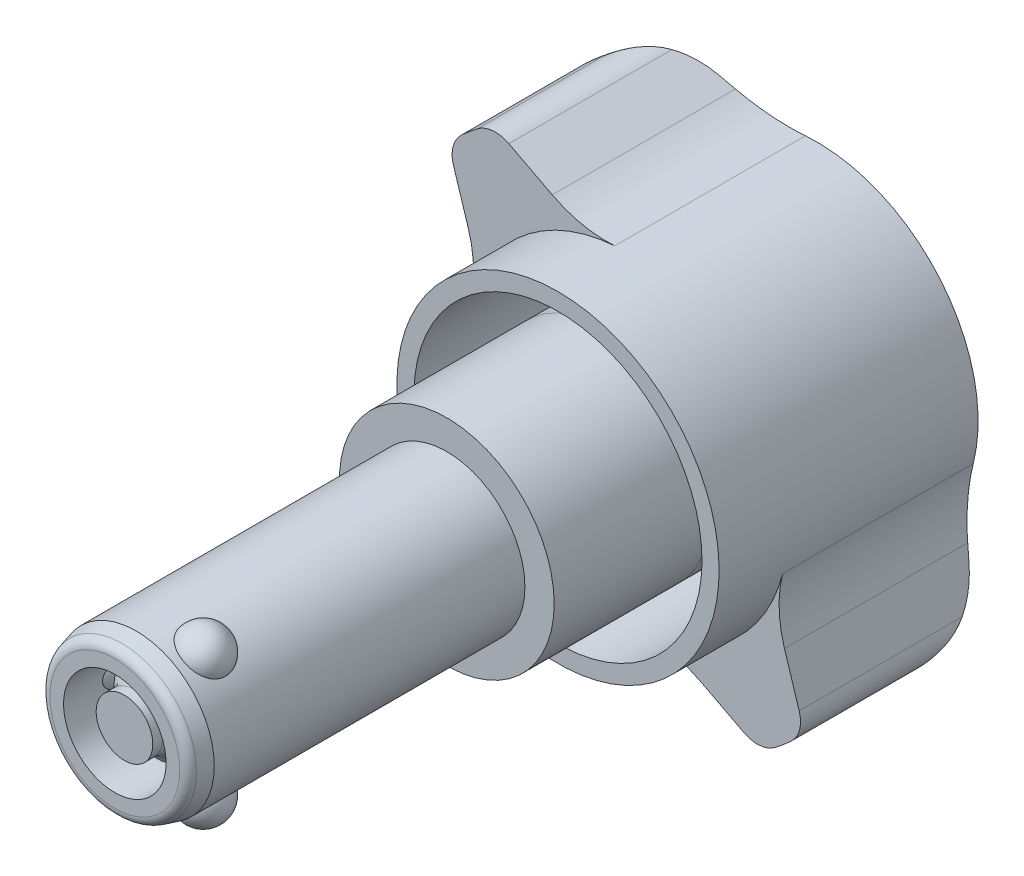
ISO-10303-21;
HEADER;
FILE_DESCRIPTION(('STEP AP214'),'2;1');
FILE_NAME('part.step','',(''),(''),'','','');
FILE_SCHEMA(('AUTOMOTIVE_DESIGN { 1 0 10303 214 1 1 1 1 }'));
ENDSEC;
DATA;
#1=APPLICATION_CONTEXT('core data for automotive mechanical design processes');
#2=APPLICATION_PROTOCOL_DEFINITION('international standard','automotive_design',2000,#1);
#3=PRODUCT_CONTEXT('',#1,'mechanical');
#4=PRODUCT('Part','Part','',(#3));
#5=PRODUCT_RELATED_PRODUCT_CATEGORY('part','',(#4));
#6=PRODUCT_DEFINITION_FORMATION('','',#4);
#7=PRODUCT_DEFINITION_CONTEXT('part definition',#1,'design');
#8=PRODUCT_DEFINITION('design','',#6,#7);
#9=PRODUCT_DEFINITION_SHAPE('','',#8);
#10=(LENGTH_UNIT() NAMED_UNIT(*) SI_UNIT(.MILLI.,.METRE.));
#11=(NAMED_UNIT(*) PLANE_ANGLE_UNIT() SI_UNIT($,.RADIAN.));
#12=(NAMED_UNIT(*) SI_UNIT($,.STERADIAN.) SOLID_ANGLE_UNIT());
#13=UNCERTAINTY_MEASURE_WITH_UNIT(LENGTH_MEASURE(1.E-05),#10,'distance_accuracy_value','');
#14=(GEOMETRIC_REPRESENTATION_CONTEXT(3) GLOBAL_UNCERTAINTY_ASSIGNED_CONTEXT((#13)) GLOBAL_UNIT_ASSIGNED_CONTEXT((#10,
#11,#12)) REPRESENTATION_CONTEXT('',''));
#15=CARTESIAN_POINT('',(0.,0.,0.));
#16=DIRECTION('',(0.,0.,1.));
#17=DIRECTION('',(1.,0.,0.));
#18=AXIS2_PLACEMENT_3D('',#15,#16,#17);
#19=CARTESIAN_POINT('',(0.,0.,-11.3875127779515));
#20=DIRECTION('',(0.,0.,-1.));
#21=DIRECTION('',(0.642787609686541,-0.766044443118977,0.));
#22=AXIS2_PLACEMENT_3D('',#19,#20,#21);
#23=CYLINDRICAL_SURFACE('',#22,7.);
#24=CARTESIAN_POINT('',(0.,0.,-35.8875127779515));
#25=DIRECTION('',(0.,0.,1.));
#26=DIRECTION('',(1.,0.,0.));
#27=AXIS2_PLACEMENT_3D('',#24,#25,#26);
#28=CIRCLE('',#27,7.);
#29=CARTESIAN_POINT('',(7.,0.,-35.8875127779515));
#30=VERTEX_POINT('',#29);
#31=EDGE_CURVE('E794',#30,#30,#28,.T.);
#32=ORIENTED_EDGE('',*,*,#31,.T.);
#33=EDGE_LOOP('',(#32));
#34=FACE_BOUND('',#33,.T.);
#35=CARTESIAN_POINT('',(0.,0.,-32.));
#36=DIRECTION('',(0.,0.,-1.));
#37=DIRECTION('',(-0.941779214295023,-0.336231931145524,0.));
#38=AXIS2_PLACEMENT_3D('',#35,#36,#37);
#39=CIRCLE('',#38,7.);
#40=CARTESIAN_POINT('',(-6.59245450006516,-2.35362351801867,-32.));
#41=VERTEX_POINT('',#40);
#42=EDGE_CURVE('E599',#41,#41,#39,.T.);
#43=ORIENTED_EDGE('',*,*,#42,.T.);
#44=EDGE_LOOP('',(#43));
#45=FACE_BOUND('',#44,.T.);
#46=ADVANCED_FACE('F16',(#34,#45),#23,.T.);
#47=CARTESIAN_POINT('',(0.,0.,-35.8875127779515));
#48=DIRECTION('',(0.,0.,1.));
#49=DIRECTION('',(0.766044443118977,0.642787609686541,0.));
#50=AXIS2_PLACEMENT_3D('',#47,#48,#49);
#51=PLANE('',#50);
#52=ORIENTED_EDGE('',*,*,#31,.F.);
#53=EDGE_LOOP('',(#52));
#54=FACE_BOUND('',#53,.T.);
#55=CARTESIAN_POINT('',(0.,0.,-35.8875127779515));
#56=DIRECTION('',(0.,0.,1.));
#57=DIRECTION('',(0.766044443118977,0.642787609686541,0.));
#58=AXIS2_PLACEMENT_3D('',#55,#56,#57);
#59=CIRCLE('',#58,10.5);
#60=CARTESIAN_POINT('',(8.04346665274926,6.74926990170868,-35.8875127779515));
#61=VERTEX_POINT('',#60);
#62=EDGE_CURVE('E590',#61,#61,#59,.F.);
#63=ORIENTED_EDGE('',*,*,#62,.F.);
#64=EDGE_LOOP('',(#63));
#65=FACE_BOUND('',#64,.T.);
#66=ADVANCED_FACE('F293',(#54,#65),#51,.T.);
#67=CARTESIAN_POINT('',(0.,0.,-22.8875127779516));
#68=DIRECTION('',(0.,0.,1.));
#69=DIRECTION('',(0.766044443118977,0.642787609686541,0.));
#70=AXIS2_PLACEMENT_3D('',#67,#68,#69);
#71=CYLINDRICAL_SURFACE('',#70,10.5);
#72=ORIENTED_EDGE('',*,*,#62,.T.);
#73=EDGE_LOOP('',(#72));
#74=FACE_BOUND('',#73,.T.);
#75=CARTESIAN_POINT('',(0.,0.,-40.8875127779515));
#76=DIRECTION('',(0.,0.,1.));
#77=DIRECTION('',(0.766044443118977,0.642787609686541,0.));
#78=AXIS2_PLACEMENT_3D('',#75,#76,#77);
#79=CIRCLE('',#78,10.5);
#80=CARTESIAN_POINT('',(8.04346665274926,6.74926990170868,-40.8875127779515));
#81=VERTEX_POINT('',#80);
#82=EDGE_CURVE('E251',#81,#81,#79,.T.);
#83=ORIENTED_EDGE('',*,*,#82,.T.);
#84=EDGE_LOOP('',(#83));
#85=FACE_BOUND('',#84,.T.);
#86=ADVANCED_FACE('F850',(#74,#85),#71,.T.);
#87=CARTESIAN_POINT('',(-9.48111724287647,11.2991555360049,-40.8875127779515));
#88=DIRECTION('',(0.,0.,-1.));
#89=DIRECTION('',(-0.766044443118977,-0.642787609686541,0.));
#90=AXIS2_PLACEMENT_3D('',#87,#88,#89);
#91=PLANE('',#90);
#92=CARTESIAN_POINT('',(0.,0.,-40.8875127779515));
#93=DIRECTION('',(0.,0.,-1.));
#94=DIRECTION('',(-0.766044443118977,-0.642787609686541,0.));
#95=AXIS2_PLACEMENT_3D('',#92,#93,#94);
#96=CIRCLE('',#95,14.75);
#97=CARTESIAN_POINT('',(-11.2991555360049,-9.48111724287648,-40.8875127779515));
#98=VERTEX_POINT('',#97);
#99=EDGE_CURVE('E381',#98,#98,#96,.F.);
#100=ORIENTED_EDGE('',*,*,#99,.T.);
#101=EDGE_LOOP('',(#100));
#102=FACE_BOUND('',#101,.T.);
#103=ORIENTED_EDGE('',*,*,#82,.F.);
#104=EDGE_LOOP('',(#103));
#105=FACE_BOUND('',#104,.T.);
#106=ADVANCED_FACE('F853',(#102,#105),#91,.F.);
#107=CARTESIAN_POINT('',(0.,0.,-22.8875127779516));
#108=DIRECTION('',(0.,0.,-1.));
#109=DIRECTION('',(-0.766044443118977,-0.642787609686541,0.));
#110=AXIS2_PLACEMENT_3D('',#107,#108,#109);
#111=CYLINDRICAL_SURFACE('',#110,14.75);
#112=ORIENTED_EDGE('',*,*,#99,.F.);
#113=EDGE_LOOP('',(#112));
#114=FACE_BOUND('',#113,.T.);
#115=CARTESIAN_POINT('',(0.,0.,-15.8875127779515));
#116=DIRECTION('',(0.,0.,1.));
#117=DIRECTION('',(0.766044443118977,0.642787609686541,0.));
#118=AXIS2_PLACEMENT_3D('',#115,#116,#117);
#119=CIRCLE('',#118,14.75);
#120=CARTESIAN_POINT('',(11.2991555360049,9.48111724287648,-15.8875127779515));
#121=VERTEX_POINT('',#120);
#122=EDGE_CURVE('E254',#121,#121,#119,.T.);
#123=ORIENTED_EDGE('',*,*,#122,.T.);
#124=EDGE_LOOP('',(#123));
#125=FACE_BOUND('',#124,.T.);
#126=ADVANCED_FACE('F857',(#114,#125),#111,.F.);
#127=CARTESIAN_POINT('',(0.,0.,-15.8875127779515));
#128=DIRECTION('',(0.,0.,1.));
#129=DIRECTION('',(0.766044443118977,0.642787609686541,0.));
#130=AXIS2_PLACEMENT_3D('',#127,#128,#129);
#131=PLANE('',#130);
#132=CARTESIAN_POINT('',(0.,0.,-15.8875127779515));
#133=DIRECTION('',(0.,0.,1.));
#134=DIRECTION('',(0.766044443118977,0.642787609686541,0.));
#135=AXIS2_PLACEMENT_3D('',#132,#133,#134);
#136=CIRCLE('',#135,16.5);
#137=CARTESIAN_POINT('',(12.6397333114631,10.6059955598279,-15.8875127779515));
#138=VERTEX_POINT('',#137);
#139=EDGE_CURVE('E259',#138,#138,#136,.T.);
#140=ORIENTED_EDGE('',*,*,#139,.T.);
#141=EDGE_LOOP('',(#140));
#142=FACE_BOUND('',#141,.T.);
#143=ORIENTED_EDGE('',*,*,#122,.F.);
#144=EDGE_LOOP('',(#143));
#145=FACE_BOUND('',#144,.T.);
#146=ADVANCED_FACE('F435',(#142,#145),#131,.T.);
#147=CARTESIAN_POINT('',(0.,0.,-43.8875127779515));
#148=DIRECTION('',(0.,0.,1.));
#149=DIRECTION('',(0.766044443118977,0.642787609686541,0.));
#150=AXIS2_PLACEMENT_3D('',#147,#148,#149);
#151=CYLINDRICAL_SURFACE('',#150,16.5);
#152=DIRECTION('',(0.,0.,1.));
#153=VECTOR('',#152,1.);
#154=CARTESIAN_POINT('',(1.18480465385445,-16.4574067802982,-43.8875127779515));
#155=LINE('',#154,#153);
#156=CARTESIAN_POINT('',(1.18480465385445,-16.4574067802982,-42.4137922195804));
#157=VERTEX_POINT('',#156);
#158=CARTESIAN_POINT('',(1.18480465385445,-16.4574067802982,-22.8875127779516));
#159=VERTEX_POINT('',#158);
#160=EDGE_CURVE('E525',#157,#159,#155,.T.);
#161=ORIENTED_EDGE('',*,*,#160,.T.);
#162=CARTESIAN_POINT('',(0.,0.,-22.8875127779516));
#163=DIRECTION('',(0.,0.,1.));
#164=DIRECTION('',(0.766044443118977,0.642787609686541,0.));
#165=AXIS2_PLACEMENT_3D('',#162,#163,#164);
#166=CIRCLE('',#165,16.5);
#167=CARTESIAN_POINT('',(16.0016426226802,-4.02460350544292,-22.8875127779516));
#168=VERTEX_POINT('',#167);
#169=EDGE_CURVE('E264',#159,#168,#166,.T.);
#170=ORIENTED_EDGE('',*,*,#169,.T.);
#171=DIRECTION('',(0.,0.,1.));
#172=VECTOR('',#171,1.);
#173=CARTESIAN_POINT('',(16.0016426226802,-4.02460350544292,-43.8875127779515));
#174=LINE('',#173,#172);
#175=CARTESIAN_POINT('',(16.0016426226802,-4.02460350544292,-42.4137922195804));
#176=VERTEX_POINT('',#175);
#177=EDGE_CURVE('E518',#168,#176,#174,.F.);
#178=ORIENTED_EDGE('',*,*,#177,.T.);
#179=CARTESIAN_POINT('',(0.,0.,-42.4137922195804));
#180=DIRECTION('',(0.,0.,1.));
#181=DIRECTION('',(0.766044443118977,0.642787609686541,0.));
#182=AXIS2_PLACEMENT_3D('',#179,#180,#181);
#183=CIRCLE('',#182,16.5);
#184=CARTESIAN_POINT('',(-1.18480465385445,16.4574067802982,-42.4137922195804));
#185=VERTEX_POINT('',#184);
#186=EDGE_CURVE('E562',#176,#185,#183,.T.);
#187=ORIENTED_EDGE('',*,*,#186,.T.);
#188=DIRECTION('',(0.,0.,1.));
#189=VECTOR('',#188,1.);
#190=CARTESIAN_POINT('',(-1.18480465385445,16.4574067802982,-43.8875127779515));
#191=LINE('',#190,#189);
#192=CARTESIAN_POINT('',(-1.18480465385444,16.4574067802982,-22.8875127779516));
#193=VERTEX_POINT('',#192);
#194=EDGE_CURVE('E515',#185,#193,#191,.T.);
#195=ORIENTED_EDGE('',*,*,#194,.T.);
#196=CARTESIAN_POINT('',(-16.0016426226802,4.02460350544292,-22.8875127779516));
#197=VERTEX_POINT('',#196);
#198=EDGE_CURVE('E258',#193,#197,#166,.T.);
#199=ORIENTED_EDGE('',*,*,#198,.T.);
#200=DIRECTION('',(0.,0.,1.));
#201=VECTOR('',#200,1.);
#202=CARTESIAN_POINT('',(-16.0016426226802,4.02460350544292,-43.8875127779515));
#203=LINE('',#202,#201);
#204=CARTESIAN_POINT('',(-16.0016426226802,4.02460350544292,-42.4137922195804));
#205=VERTEX_POINT('',#204);
#206=EDGE_CURVE('E528',#197,#205,#203,.F.);
#207=ORIENTED_EDGE('',*,*,#206,.T.);
#208=CARTESIAN_POINT('',(0.,0.,-42.4137922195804));
#209=DIRECTION('',(0.,0.,1.));
#210=DIRECTION('',(0.766044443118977,0.642787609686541,0.));
#211=AXIS2_PLACEMENT_3D('',#208,#209,#210);
#212=CIRCLE('',#211,16.5);
#213=EDGE_CURVE('E278',#205,#157,#212,.T.);
#214=ORIENTED_EDGE('',*,*,#213,.T.);
#215=EDGE_LOOP('',(#161,#170,#178,#187,#195,#199,#207,#214));
#216=FACE_BOUND('',#215,.T.);
#217=ORIENTED_EDGE('',*,*,#139,.F.);
#218=EDGE_LOOP('',(#217));
#219=FACE_BOUND('',#218,.T.);
#220=ADVANCED_FACE('F367',(#216,#219),#151,.T.);
#221=CARTESIAN_POINT('',(2.04648076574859,-28.4264298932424,-43.8875127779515));
#222=DIRECTION('',(0.,0.,1.));
#223=DIRECTION('',(0.766044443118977,0.642787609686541,0.));
#224=AXIS2_PLACEMENT_3D('',#221,#222,#223);
#225=CYLINDRICAL_SURFACE('',#224,12.);
#226=CARTESIAN_POINT('',(7.58746412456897,-17.7822998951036,-41.6545888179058));
#227=CARTESIAN_POINT('',(7.30144966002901,-17.6333770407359,-41.7213561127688));
#228=CARTESIAN_POINT('',(7.00882128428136,-17.4957300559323,-41.7851935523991));
#229=CARTESIAN_POINT('',(6.41198703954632,-17.2439826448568,-41.9057533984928));
#230=CARTESIAN_POINT('',(6.10777440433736,-17.1298962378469,-41.9624715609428));
#231=CARTESIAN_POINT('',(5.49739310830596,-16.9289550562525,-42.0661595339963));
#232=CARTESIAN_POINT('',(5.19145808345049,-16.8414976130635,-42.1133354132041));
#233=CARTESIAN_POINT('',(4.572474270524,-16.6909828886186,-42.198423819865));
#234=CARTESIAN_POINT('',(4.25942846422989,-16.6279155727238,-42.2363401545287));
#235=CARTESIAN_POINT('',(3.71890600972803,-16.5413578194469,-42.2924253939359));
#236=CARTESIAN_POINT('',(3.49265905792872,-16.511703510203,-42.313138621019));
#237=CARTESIAN_POINT('',(3.03842062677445,-16.4653195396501,-42.3489762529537));
#238=CARTESIAN_POINT('',(2.81042939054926,-16.4485881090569,-42.3641014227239));
#239=CARTESIAN_POINT('',(2.34945255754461,-16.4279980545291,-42.3887153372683));
#240=CARTESIAN_POINT('',(2.11645071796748,-16.4243756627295,-42.3980981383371));
#241=CARTESIAN_POINT('',(1.6504064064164,-16.4306997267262,-42.4106476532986));
#242=CARTESIAN_POINT('',(1.41736393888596,-16.4406495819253,-42.4138128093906));
#243=CARTESIAN_POINT('',(1.18480465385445,-16.4574067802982,-42.4137922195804));
#244=B_SPLINE_CURVE_WITH_KNOTS('',3,(#226,#227,#228,#229,#230,#231,#232,#233,#234,#235,#236,
#237,#238,#239,#240,#241,#242,#243),.UNSPECIFIED.,.F.,.F.,(4,2,2,2,2,2,2,2,4),(0.,
0.987718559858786,1.97602315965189,2.93993263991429,3.90344512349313,4.59040112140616,
5.27726305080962,5.97644264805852,6.67579739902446),.UNSPECIFIED.);
#245=CARTESIAN_POINT('',(7.58746412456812,-17.7822998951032,-41.6545888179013));
#246=VERTEX_POINT('',#245);
#247=EDGE_CURVE('E372',#246,#157,#244,.T.);
#248=ORIENTED_EDGE('',*,*,#247,.F.);
#249=DIRECTION('',(0.,0.,-1.));
#250=VECTOR('',#249,1.);
#251=CARTESIAN_POINT('',(7.58746412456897,-17.7822998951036,-42.4137922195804));
#252=LINE('',#251,#250);
#253=CARTESIAN_POINT('',(7.58746412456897,-17.7822998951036,-22.8875127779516));
#254=VERTEX_POINT('',#253);
#255=EDGE_CURVE('E530',#254,#246,#252,.T.);
#256=ORIENTED_EDGE('',*,*,#255,.F.);
#257=CARTESIAN_POINT('',(2.04648076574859,-28.4264298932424,-22.8875127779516));
#258=DIRECTION('',(0.,0.,1.));
#259=DIRECTION('',(0.766044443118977,0.642787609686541,0.));
#260=AXIS2_PLACEMENT_3D('',#257,#258,#259);
#261=CIRCLE('',#260,12.);
#262=EDGE_CURVE('E351',#159,#254,#261,.F.);
#263=ORIENTED_EDGE('',*,*,#262,.F.);
#264=ORIENTED_EDGE('',*,*,#160,.F.);
#265=EDGE_LOOP('',(#248,#256,#263,#264));
#266=FACE_BOUND('',#265,.T.);
#267=ADVANCED_FACE('F360',(#266),#225,.F.);
#268=CARTESIAN_POINT('',(0.,0.,-22.8875127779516));
#269=DIRECTION('',(0.,0.,1.));
#270=DIRECTION('',(0.766044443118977,0.642787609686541,0.));
#271=AXIS2_PLACEMENT_3D('',#268,#269,#270);
#272=PLANE('',#271);
#273=CARTESIAN_POINT('',(0.,0.,-22.8875127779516));
#274=DIRECTION('',(0.,0.,-1.));
#275=DIRECTION('',(-0.766044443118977,-0.642787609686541,0.));
#276=AXIS2_PLACEMENT_3D('',#273,#274,#275);
#277=CIRCLE('',#276,25.);
#278=CARTESIAN_POINT('',(16.8638536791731,-18.4556343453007,-22.8875127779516));
#279=VERTEX_POINT('',#278);
#280=CARTESIAN_POINT('',(15.2468743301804,-19.8124411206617,-22.8875127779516));
#281=VERTEX_POINT('',#280);
#282=EDGE_CURVE('E498',#279,#281,#277,.T.);
#283=ORIENTED_EDGE('',*,*,#282,.F.);
#284=CARTESIAN_POINT('',(14.8401912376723,-16.2409582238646,-22.8875127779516));
#285=DIRECTION('',(0.,0.,1.));
#286=DIRECTION('',(0.766044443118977,0.642787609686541,0.));
#287=AXIS2_PLACEMENT_3D('',#284,#285,#286);
#288=CIRCLE('',#287,3.);
#289=CARTESIAN_POINT('',(17.701342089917,-15.3388408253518,-22.8875127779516));
#290=VERTEX_POINT('',#289);
#291=EDGE_CURVE('E400',#279,#290,#288,.T.);
#292=ORIENTED_EDGE('',*,*,#291,.T.);
#293=DIRECTION('',(0.300705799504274,-0.953716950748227,0.));
#294=VECTOR('',#293,1.);
#295=CARTESIAN_POINT('',(15.0191324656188,-6.83195872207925,-22.8875127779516));
#296=LINE('',#295,#294);
#297=CARTESIAN_POINT('',(16.1945974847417,-10.560057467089,-22.8875127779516));
#298=VERTEX_POINT('',#297);
#299=EDGE_CURVE('E502',#298,#290,#296,.T.);
#300=ORIENTED_EDGE('',*,*,#299,.F.);
#301=CARTESIAN_POINT('',(27.6392008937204,-6.95158787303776,-22.8875127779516));
#302=DIRECTION('',(0.,0.,1.));
#303=DIRECTION('',(0.766044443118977,0.642787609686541,0.));
#304=AXIS2_PLACEMENT_3D('',#301,#302,#303);
#305=CIRCLE('',#304,12.);
#306=EDGE_CURVE('E531',#298,#168,#305,.F.);
#307=ORIENTED_EDGE('',*,*,#306,.T.);
#308=ORIENTED_EDGE('',*,*,#169,.F.);
#309=ORIENTED_EDGE('',*,*,#262,.T.);
#310=DIRECTION('',(-0.887010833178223,0.461748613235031,0.));
#311=VECTOR('',#310,1.);
#312=CARTESIAN_POINT('',(4.12012093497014,-15.9773152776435,-22.8875127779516));
#313=LINE('',#312,#311);
#314=CARTESIAN_POINT('',(12.0320035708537,-20.095980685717,-22.8875127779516));
#315=VERTEX_POINT('',#314);
#316=EDGE_CURVE('E501',#315,#254,#313,.T.);
#317=ORIENTED_EDGE('',*,*,#316,.F.);
#318=CARTESIAN_POINT('',(13.4172494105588,-17.4349481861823,-22.8875127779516));
#319=DIRECTION('',(0.,0.,1.));
#320=DIRECTION('',(0.766044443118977,0.642787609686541,0.));
#321=AXIS2_PLACEMENT_3D('',#318,#319,#320);
#322=CIRCLE('',#321,3.);
#323=EDGE_CURVE('E398',#315,#281,#322,.T.);
#324=ORIENTED_EDGE('',*,*,#323,.T.);
#325=EDGE_LOOP('',(#283,#292,#300,#307,#308,#309,#317,#324));
#326=FACE_BOUND('',#325,.T.);
#327=ADVANCED_FACE('F366',(#326),#272,.T.);
#328=CARTESIAN_POINT('',(27.6392008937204,-6.95158787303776,-43.8875127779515));
#329=DIRECTION('',(0.,0.,1.));
#330=DIRECTION('',(0.766044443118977,0.642787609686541,0.));
#331=AXIS2_PLACEMENT_3D('',#328,#329,#330);
#332=CYLINDRICAL_SURFACE('',#331,12.);
#333=CARTESIAN_POINT('',(16.0016426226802,-4.02460350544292,-42.4137922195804));
#334=CARTESIAN_POINT('',(15.9572913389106,-4.20093793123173,-42.4137967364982));
#335=CARTESIAN_POINT('',(15.9169588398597,-4.37824984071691,-42.41187860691));
#336=CARTESIAN_POINT('',(15.8444016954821,-4.73443837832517,-42.4042437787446));
#337=CARTESIAN_POINT('',(15.8121768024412,-4.91331495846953,-42.3985271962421));
#338=CARTESIAN_POINT('',(15.7277953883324,-5.4515304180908,-42.3757578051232));
#339=CARTESIAN_POINT('',(15.6878844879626,-5.81264469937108,-42.3530852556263));
#340=CARTESIAN_POINT('',(15.6415511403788,-6.52620844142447,-42.2945281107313));
#341=CARTESIAN_POINT('',(15.6342733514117,-6.87863528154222,-42.2590076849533));
#342=CARTESIAN_POINT('',(15.6505869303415,-7.58128643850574,-42.1760483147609));
#343=CARTESIAN_POINT('',(15.6741674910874,-7.93151148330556,-42.1286135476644));
#344=CARTESIAN_POINT('',(15.7343374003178,-8.4721002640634,-42.0468287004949));
#345=CARTESIAN_POINT('',(15.7604671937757,-8.66424403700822,-42.0160501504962));
#346=CARTESIAN_POINT('',(15.8218970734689,-9.04653014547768,-41.9515907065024));
#347=CARTESIAN_POINT('',(15.8571947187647,-9.2366729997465,-41.9179105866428));
#348=CARTESIAN_POINT('',(15.937415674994,-9.61741683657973,-41.8473904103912));
#349=CARTESIAN_POINT('',(15.9824762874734,-9.80798138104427,-41.8105103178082));
#350=CARTESIAN_POINT('',(16.0817307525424,-10.1862667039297,-41.7343092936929));
#351=CARTESIAN_POINT('',(16.1359264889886,-10.3739868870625,-41.6949878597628));
#352=CARTESIAN_POINT('',(16.1945974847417,-10.560057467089,-41.6545888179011));
#353=B_SPLINE_CURVE_WITH_KNOTS('',3,(#333,#334,#335,#336,#337,#338,#339,#340,#341,#342,#343,
#344,#345,#346,#347,#348,#349,#350,#351,#352),.UNSPECIFIED.,.F.,.F.,(4,2,2,2,2,2,2,2,2,4),(0.,
0.545358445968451,1.09070022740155,2.18079970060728,3.24215309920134,4.30313489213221,
4.89194533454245,5.48059916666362,6.07814182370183,6.67580785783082),.UNSPECIFIED.);
#354=CARTESIAN_POINT('',(16.1945974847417,-10.5600574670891,-41.6545888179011));
#355=VERTEX_POINT('',#354);
#356=EDGE_CURVE('E326',#176,#355,#353,.T.);
#357=ORIENTED_EDGE('',*,*,#356,.F.);
#358=ORIENTED_EDGE('',*,*,#177,.F.);
#359=ORIENTED_EDGE('',*,*,#306,.F.);
#360=DIRECTION('',(0.,0.,-1.));
#361=VECTOR('',#360,1.);
#362=CARTESIAN_POINT('',(16.1945974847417,-10.560057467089,-22.8875127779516));
#363=LINE('',#362,#361);
#364=EDGE_CURVE('E512',#355,#298,#363,.F.);
#365=ORIENTED_EDGE('',*,*,#364,.F.);
#366=EDGE_LOOP('',(#357,#358,#359,#365));
#367=FACE_BOUND('',#366,.T.);
#368=ADVANCED_FACE('F290',(#367),#332,.F.);
#369=CARTESIAN_POINT('',(0.,0.,-43.8875127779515));
#370=DIRECTION('',(0.,0.,1.));
#371=DIRECTION('',(0.766044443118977,0.642787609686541,0.));
#372=AXIS2_PLACEMENT_3D('',#369,#370,#371);
#373=CONICAL_SURFACE('',#372,11.,1.30899693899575);
#374=CARTESIAN_POINT('',(0.,0.,-43.8875127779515));
#375=DIRECTION('',(0.,0.,1.));
#376=DIRECTION('',(0.766044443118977,0.642787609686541,0.));
#377=AXIS2_PLACEMENT_3D('',#374,#375,#376);
#378=CIRCLE('',#377,11.);
#379=CARTESIAN_POINT('',(8.42648887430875,7.07066370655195,-43.8875127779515));
#380=VERTEX_POINT('',#379);
#381=EDGE_CURVE('E267',#380,#380,#378,.T.);
#382=ORIENTED_EDGE('',*,*,#381,.T.);
#383=EDGE_LOOP('',(#382));
#384=FACE_BOUND('',#383,.T.);
#385=CARTESIAN_POINT('',(-18.2517673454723,17.0845667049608,-40.1361735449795));
#386=CARTESIAN_POINT('',(-18.117668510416,16.6592595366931,-40.2402798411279));
#387=CARTESIAN_POINT('',(-17.9835192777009,16.2337925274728,-40.3436653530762));
#388=CARTESIAN_POINT('',(-17.7151032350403,15.3824856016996,-40.5487439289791));
#389=CARTESIAN_POINT('',(-17.5808364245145,14.9566456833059,-40.650436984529));
#390=CARTESIAN_POINT('',(-17.1778801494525,13.6786316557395,-40.9525668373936));
#391=CARTESIAN_POINT('',(-16.9089912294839,12.8258249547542,-41.1500883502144));
#392=CARTESIAN_POINT('',(-16.5051274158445,11.5449325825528,-41.438365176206));
#393=CARTESIAN_POINT('',(-16.3704109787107,11.1176666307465,-41.5331277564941));
#394=CARTESIAN_POINT('',(-16.1007806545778,10.2625084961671,-41.7194813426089));
#395=CARTESIAN_POINT('',(-15.9658667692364,9.83461631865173,-41.8110723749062));
#396=CARTESIAN_POINT('',(-15.6957923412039,8.9780496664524,-41.9905279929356));
#397=CARTESIAN_POINT('',(-15.5606317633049,8.54937508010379,-42.0783919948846));
#398=CARTESIAN_POINT('',(-15.2900508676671,7.69120211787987,-42.2496488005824));
#399=CARTESIAN_POINT('',(-15.1546305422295,7.26170371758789,-42.3330414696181));
#400=CARTESIAN_POINT('',(-15.0190673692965,6.8317522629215,-42.413831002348));
#401=B_SPLINE_CURVE_WITH_KNOTS('',3,(#385,#386,#387,#388,#389,#390,#391,#392,#393,#394,#395,
#396,#397,#398,#399,#400),.UNSPECIFIED.,.F.,.F.,(4,2,2,2,2,2,2,4),(0.,1.37381024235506,
2.74762730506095,5.49481452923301,6.86854574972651,8.24226550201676,9.61619963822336,
10.9901751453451),.UNSPECIFIED.);
#402=CARTESIAN_POINT('',(-16.6599850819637,12.0360783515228,-41.3278171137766));
#403=VERTEX_POINT('',#402);
#404=CARTESIAN_POINT('',(-16.1945974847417,10.5600574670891,-41.6545888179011));
#405=VERTEX_POINT('',#404);
#406=EDGE_CURVE('E270',#403,#405,#401,.T.);
#407=ORIENTED_EDGE('',*,*,#406,.F.);
#408=CARTESIAN_POINT('',(0.,0.,-41.3278171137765));
#409=DIRECTION('',(0.,0.,-1.));
#410=DIRECTION('',(-0.766044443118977,-0.642787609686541,0.));
#411=AXIS2_PLACEMENT_3D('',#408,#409,#410);
#412=CIRCLE('',#411,20.5529142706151);
#413=CARTESIAN_POINT('',(-8.96024722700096,18.4969255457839,-41.3278171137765));
#414=VERTEX_POINT('',#413);
#415=EDGE_CURVE('E477',#403,#414,#412,.T.);
#416=ORIENTED_EDGE('',*,*,#415,.T.);
#417=CARTESIAN_POINT('',(-4.11992891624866,15.977215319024,-42.413831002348));
#418=CARTESIAN_POINT('',(-4.51980814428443,16.1853792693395,-42.3330414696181));
#419=CARTESIAN_POINT('',(-4.91926600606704,16.3933238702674,-42.2496488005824));
#420=CARTESIAN_POINT('',(-5.7174155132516,16.8088142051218,-42.0783919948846));
#421=CARTESIAN_POINT('',(-6.11610718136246,17.0163599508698,-41.9905279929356));
#422=CARTESIAN_POINT('',(-6.91276272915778,17.4310725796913,-41.8110723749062));
#423=CARTESIAN_POINT('',(-7.31072671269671,17.638239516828,-41.719481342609));
#424=CARTESIAN_POINT('',(-8.10607225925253,18.052270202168,-41.5331277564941));
#425=CARTESIAN_POINT('',(-8.50345381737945,18.2591339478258,-41.438365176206));
#426=CARTESIAN_POINT('',(-9.69475634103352,18.8792867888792,-41.1500883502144));
#427=CARTESIAN_POINT('',(-10.4879149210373,19.2921790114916,-40.9525668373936));
#428=CARTESIAN_POINT('',(-11.676540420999,19.9109382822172,-40.650436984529));
#429=CARTESIAN_POINT('',(-12.0725956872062,20.1171116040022,-40.5487439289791));
#430=CARTESIAN_POINT('',(-12.8643593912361,20.529277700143,-40.3436653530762));
#431=CARTESIAN_POINT('',(-13.2600678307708,20.73527047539,-40.2402798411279));
#432=CARTESIAN_POINT('',(-13.6556276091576,20.9411858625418,-40.1361735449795));
#433=B_SPLINE_CURVE_WITH_KNOTS('',3,(#417,#418,#419,#420,#421,#422,#423,#424,#425,#426,#427,
#428,#429,#430,#431,#432),.UNSPECIFIED.,.F.,.F.,(4,2,2,2,2,2,2,4),(0.,1.37397550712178,
2.74790964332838,4.12162939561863,5.49536061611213,8.2425478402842,9.6163649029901,
10.9901751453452),.UNSPECIFIED.);
#434=CARTESIAN_POINT('',(-7.58746412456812,17.7822998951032,-41.6545888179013));
#435=VERTEX_POINT('',#434);
#436=EDGE_CURVE('E317',#435,#414,#433,.T.);
#437=ORIENTED_EDGE('',*,*,#436,.F.);
#438=CARTESIAN_POINT('',(-7.58746412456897,17.7822998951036,-41.6545888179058));
#439=CARTESIAN_POINT('',(-7.30144966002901,17.6333770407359,-41.7213561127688));
#440=CARTESIAN_POINT('',(-7.00882128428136,17.4957300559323,-41.7851935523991));
#441=CARTESIAN_POINT('',(-6.41198703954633,17.2439826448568,-41.9057533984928));
#442=CARTESIAN_POINT('',(-6.10777440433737,17.1298962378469,-41.9624715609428));
#443=CARTESIAN_POINT('',(-5.49739310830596,16.9289550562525,-42.0661595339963));
#444=CARTESIAN_POINT('',(-5.1914580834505,16.8414976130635,-42.1133354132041));
#445=CARTESIAN_POINT('',(-4.572474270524,16.6909828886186,-42.198423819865));
#446=CARTESIAN_POINT('',(-4.2594284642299,16.6279155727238,-42.2363401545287));
#447=CARTESIAN_POINT('',(-3.71890600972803,16.5413578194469,-42.2924253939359));
#448=CARTESIAN_POINT('',(-3.49265905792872,16.511703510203,-42.313138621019));
#449=CARTESIAN_POINT('',(-3.03842062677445,16.4653195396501,-42.3489762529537));
#450=CARTESIAN_POINT('',(-2.81042939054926,16.4485881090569,-42.3641014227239));
#451=CARTESIAN_POINT('',(-2.34945255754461,16.4279980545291,-42.3887153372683));
#452=CARTESIAN_POINT('',(-2.11645071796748,16.4243756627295,-42.3980981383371));
#453=CARTESIAN_POINT('',(-1.6504064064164,16.4306997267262,-42.4106476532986));
#454=CARTESIAN_POINT('',(-1.41736393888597,16.4406495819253,-42.4138128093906));
#455=CARTESIAN_POINT('',(-1.18480465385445,16.4574067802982,-42.4137922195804));
#456=B_SPLINE_CURVE_WITH_KNOTS('',3,(#438,#439,#440,#441,#442,#443,#444,#445,#446,#447,#448,
#449,#450,#451,#452,#453,#454,#455),.UNSPECIFIED.,.F.,.F.,(4,2,2,2,2,2,2,2,4),(0.,
0.987718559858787,1.97602315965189,2.9399326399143,3.90344512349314,4.59040112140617,
5.27726305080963,5.97644264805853,6.67579739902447),.UNSPECIFIED.);
#457=EDGE_CURVE('E335',#435,#185,#456,.T.);
#458=ORIENTED_EDGE('',*,*,#457,.T.);
#459=ORIENTED_EDGE('',*,*,#186,.F.);
#460=ORIENTED_EDGE('',*,*,#356,.T.);
#461=CARTESIAN_POINT('',(18.2517673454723,-17.0845667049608,-40.1361735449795));
#462=CARTESIAN_POINT('',(18.117668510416,-16.6592595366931,-40.2402798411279));
#463=CARTESIAN_POINT('',(17.9835192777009,-16.2337925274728,-40.3436653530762));
#464=CARTESIAN_POINT('',(17.7151032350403,-15.3824856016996,-40.5487439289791));
#465=CARTESIAN_POINT('',(17.5808364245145,-14.9566456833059,-40.650436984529));
#466=CARTESIAN_POINT('',(17.1778801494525,-13.6786316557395,-40.9525668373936));
#467=CARTESIAN_POINT('',(16.9089912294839,-12.8258249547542,-41.1500883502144));
#468=CARTESIAN_POINT('',(16.5051274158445,-11.5449325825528,-41.438365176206));
#469=CARTESIAN_POINT('',(16.3704109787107,-11.1176666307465,-41.5331277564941));
#470=CARTESIAN_POINT('',(16.1007806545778,-10.2625084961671,-41.7194813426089));
#471=CARTESIAN_POINT('',(15.9658667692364,-9.83461631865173,-41.8110723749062));
#472=CARTESIAN_POINT('',(15.6957923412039,-8.9780496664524,-41.9905279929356));
#473=CARTESIAN_POINT('',(15.5606317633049,-8.54937508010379,-42.0783919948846));
#474=CARTESIAN_POINT('',(15.2900508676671,-7.69120211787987,-42.2496488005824));
#475=CARTESIAN_POINT('',(15.1546305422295,-7.26170371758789,-42.3330414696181));
#476=CARTESIAN_POINT('',(15.0190673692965,-6.8317522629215,-42.413831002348));
#477=B_SPLINE_CURVE_WITH_KNOTS('',3,(#461,#462,#463,#464,#465,#466,#467,#468,#469,#470,#471,
#472,#473,#474,#475,#476),.UNSPECIFIED.,.F.,.F.,(4,2,2,2,2,2,2,4),(0.,1.37381024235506,
2.74762730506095,5.49481452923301,6.86854574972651,8.24226550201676,9.61619963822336,
10.9901751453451),.UNSPECIFIED.);
#478=CARTESIAN_POINT('',(16.6599850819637,-12.0360783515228,-41.3278171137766));
#479=VERTEX_POINT('',#478);
#480=EDGE_CURVE('E308',#479,#355,#477,.T.);
#481=ORIENTED_EDGE('',*,*,#480,.F.);
#482=CARTESIAN_POINT('',(0.,0.,-41.3278171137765));
#483=DIRECTION('',(0.,0.,-1.));
#484=DIRECTION('',(-0.766044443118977,-0.642787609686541,0.));
#485=AXIS2_PLACEMENT_3D('',#482,#483,#484);
#486=CIRCLE('',#485,20.5529142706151);
#487=CARTESIAN_POINT('',(8.96024722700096,-18.4969255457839,-41.3278171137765));
#488=VERTEX_POINT('',#487);
#489=EDGE_CURVE('E579',#479,#488,#486,.T.);
#490=ORIENTED_EDGE('',*,*,#489,.T.);
#491=CARTESIAN_POINT('',(4.11992891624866,-15.977215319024,-42.413831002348));
#492=CARTESIAN_POINT('',(4.51980814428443,-16.1853792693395,-42.3330414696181));
#493=CARTESIAN_POINT('',(4.91926600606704,-16.3933238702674,-42.2496488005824));
#494=CARTESIAN_POINT('',(5.7174155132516,-16.8088142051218,-42.0783919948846));
#495=CARTESIAN_POINT('',(6.11610718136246,-17.0163599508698,-41.9905279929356));
#496=CARTESIAN_POINT('',(6.91276272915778,-17.4310725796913,-41.8110723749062));
#497=CARTESIAN_POINT('',(7.31072671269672,-17.638239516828,-41.7194813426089));
#498=CARTESIAN_POINT('',(8.10607225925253,-18.052270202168,-41.5331277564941));
#499=CARTESIAN_POINT('',(8.50345381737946,-18.2591339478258,-41.438365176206));
#500=CARTESIAN_POINT('',(9.69475634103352,-18.8792867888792,-41.1500883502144));
#501=CARTESIAN_POINT('',(10.4879149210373,-19.2921790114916,-40.9525668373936));
#502=CARTESIAN_POINT('',(11.676540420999,-19.9109382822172,-40.650436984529));
#503=CARTESIAN_POINT('',(12.0725956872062,-20.1171116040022,-40.5487439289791));
#504=CARTESIAN_POINT('',(12.8643593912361,-20.529277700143,-40.3436653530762));
#505=CARTESIAN_POINT('',(13.2600678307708,-20.73527047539,-40.240279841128));
#506=CARTESIAN_POINT('',(13.6556276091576,-20.9411858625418,-40.1361735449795));
#507=B_SPLINE_CURVE_WITH_KNOTS('',3,(#491,#492,#493,#494,#495,#496,#497,#498,#499,#500,#501,
#502,#503,#504,#505,#506),.UNSPECIFIED.,.F.,.F.,(4,2,2,2,2,2,2,4),(0.,1.37397550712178,
2.74790964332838,4.12162939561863,5.49536061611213,8.2425478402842,9.61636490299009,
10.9901751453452),.UNSPECIFIED.);
#508=EDGE_CURVE('E300',#246,#488,#507,.T.);
#509=ORIENTED_EDGE('',*,*,#508,.F.);
#510=ORIENTED_EDGE('',*,*,#247,.T.);
#511=ORIENTED_EDGE('',*,*,#213,.F.);
#512=CARTESIAN_POINT('',(-16.0016426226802,4.02460350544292,-42.4137922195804));
#513=CARTESIAN_POINT('',(-15.9572913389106,4.20093793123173,-42.4137967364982));
#514=CARTESIAN_POINT('',(-15.9169588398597,4.37824984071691,-42.41187860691));
#515=CARTESIAN_POINT('',(-15.8444016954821,4.73443837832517,-42.4042437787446));
#516=CARTESIAN_POINT('',(-15.8121768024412,4.91331495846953,-42.3985271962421));
#517=CARTESIAN_POINT('',(-15.7277953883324,5.4515304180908,-42.3757578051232));
#518=CARTESIAN_POINT('',(-15.6878844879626,5.81264469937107,-42.3530852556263));
#519=CARTESIAN_POINT('',(-15.6415511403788,6.52620844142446,-42.2945281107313));
#520=CARTESIAN_POINT('',(-15.6342733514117,6.87863528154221,-42.2590076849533));
#521=CARTESIAN_POINT('',(-15.6505869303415,7.58128643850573,-42.1760483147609));
#522=CARTESIAN_POINT('',(-15.6741674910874,7.93151148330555,-42.1286135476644));
#523=CARTESIAN_POINT('',(-15.7343374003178,8.47210026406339,-42.0468287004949));
#524=CARTESIAN_POINT('',(-15.7604671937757,8.66424403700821,-42.0160501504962));
#525=CARTESIAN_POINT('',(-15.8218970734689,9.04653014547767,-41.9515907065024));
#526=CARTESIAN_POINT('',(-15.8571947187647,9.23667299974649,-41.9179105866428));
#527=CARTESIAN_POINT('',(-15.937415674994,9.61741683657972,-41.8473904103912));
#528=CARTESIAN_POINT('',(-15.9824762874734,9.80798138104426,-41.8105103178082));
#529=CARTESIAN_POINT('',(-16.0817307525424,10.1862667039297,-41.7343092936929));
#530=CARTESIAN_POINT('',(-16.1359264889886,10.3739868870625,-41.6949878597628));
#531=CARTESIAN_POINT('',(-16.1945974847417,10.560057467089,-41.6545888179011));
#532=B_SPLINE_CURVE_WITH_KNOTS('',3,(#512,#513,#514,#515,#516,#517,#518,#519,#520,#521,#522,
#523,#524,#525,#526,#527,#528,#529,#530,#531),.UNSPECIFIED.,.F.,.F.,(4,2,2,2,2,2,2,2,2,4),(0.,
0.54535844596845,1.09070022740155,2.18079970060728,3.24215309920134,4.3031348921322,
4.89194533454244,5.48059916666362,6.07814182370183,6.67580785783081),.UNSPECIFIED.);
#533=EDGE_CURVE('E343',#205,#405,#532,.T.);
#534=ORIENTED_EDGE('',*,*,#533,.T.);
#535=EDGE_LOOP('',(#407,#416,#437,#458,#459,#460,#481,#490,#509,#510,#511,#534));
#536=FACE_BOUND('',#535,.T.);
#537=ADVANCED_FACE('F284',(#384,#536),#373,.T.);
#538=CARTESIAN_POINT('',(-2.04648076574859,28.4264298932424,-43.8875127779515));
#539=DIRECTION('',(0.,0.,1.));
#540=DIRECTION('',(0.766044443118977,0.642787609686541,0.));
#541=AXIS2_PLACEMENT_3D('',#538,#539,#540);
#542=CYLINDRICAL_SURFACE('',#541,12.);
#543=ORIENTED_EDGE('',*,*,#457,.F.);
#544=DIRECTION('',(0.,0.,-1.));
#545=VECTOR('',#544,1.);
#546=CARTESIAN_POINT('',(-7.58746412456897,17.7822998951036,-42.4137922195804));
#547=LINE('',#546,#545);
#548=CARTESIAN_POINT('',(-7.58746412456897,17.7822998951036,-22.8875127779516));
#549=VERTEX_POINT('',#548);
#550=EDGE_CURVE('E520',#549,#435,#547,.T.);
#551=ORIENTED_EDGE('',*,*,#550,.F.);
#552=CARTESIAN_POINT('',(-2.04648076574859,28.4264298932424,-22.8875127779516));
#553=DIRECTION('',(0.,0.,1.));
#554=DIRECTION('',(0.766044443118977,0.642787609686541,0.));
#555=AXIS2_PLACEMENT_3D('',#552,#553,#554);
#556=CIRCLE('',#555,12.);
#557=EDGE_CURVE('E535',#193,#549,#556,.F.);
#558=ORIENTED_EDGE('',*,*,#557,.F.);
#559=ORIENTED_EDGE('',*,*,#194,.F.);
#560=EDGE_LOOP('',(#543,#551,#558,#559));
#561=FACE_BOUND('',#560,.T.);
#562=ADVANCED_FACE('F289',(#561),#542,.F.);
#563=DIRECTION('',(0.887010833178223,-0.461748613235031,0.));
#564=VECTOR('',#563,1.);
#565=CARTESIAN_POINT('',(-4.12012093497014,15.9773152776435,-22.8875127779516));
#566=LINE('',#565,#564);
#567=CARTESIAN_POINT('',(-12.0320035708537,20.095980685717,-22.8875127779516));
#568=VERTEX_POINT('',#567);
#569=EDGE_CURVE('E506',#568,#549,#566,.T.);
#570=ORIENTED_EDGE('',*,*,#569,.F.);
#571=CARTESIAN_POINT('',(-13.4172494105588,17.4349481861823,-22.8875127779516));
#572=DIRECTION('',(0.,0.,1.));
#573=DIRECTION('',(0.766044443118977,0.642787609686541,0.));
#574=AXIS2_PLACEMENT_3D('',#571,#572,#573);
#575=CIRCLE('',#574,3.);
#576=CARTESIAN_POINT('',(-15.2468743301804,19.8124411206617,-22.8875127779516));
#577=VERTEX_POINT('',#576);
#578=EDGE_CURVE('E383',#568,#577,#575,.T.);
#579=ORIENTED_EDGE('',*,*,#578,.T.);
#580=CARTESIAN_POINT('',(0.,0.,-22.8875127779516));
#581=DIRECTION('',(0.,0.,-1.));
#582=DIRECTION('',(0.766044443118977,0.642787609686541,0.));
#583=AXIS2_PLACEMENT_3D('',#580,#581,#582);
#584=CIRCLE('',#583,25.);
#585=CARTESIAN_POINT('',(-16.8638536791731,18.4556343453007,-22.8875127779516));
#586=VERTEX_POINT('',#585);
#587=EDGE_CURVE('E565',#586,#577,#584,.T.);
#588=ORIENTED_EDGE('',*,*,#587,.F.);
#589=CARTESIAN_POINT('',(-14.8401912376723,16.2409582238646,-22.8875127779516));
#590=DIRECTION('',(0.,0.,1.));
#591=DIRECTION('',(0.766044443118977,0.642787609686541,0.));
#592=AXIS2_PLACEMENT_3D('',#589,#590,#591);
#593=CIRCLE('',#592,3.);
#594=CARTESIAN_POINT('',(-17.701342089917,15.3388408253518,-22.8875127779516));
#595=VERTEX_POINT('',#594);
#596=EDGE_CURVE('E380',#586,#595,#593,.T.);
#597=ORIENTED_EDGE('',*,*,#596,.T.);
#598=DIRECTION('',(-0.300705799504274,0.953716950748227,0.));
#599=VECTOR('',#598,1.);
#600=CARTESIAN_POINT('',(-15.0191324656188,6.83195872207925,-22.8875127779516));
#601=LINE('',#600,#599);
#602=CARTESIAN_POINT('',(-16.1945974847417,10.560057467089,-22.8875127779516));
#603=VERTEX_POINT('',#602);
#604=EDGE_CURVE('E504',#603,#595,#601,.T.);
#605=ORIENTED_EDGE('',*,*,#604,.F.);
#606=CARTESIAN_POINT('',(-27.6392008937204,6.95158787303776,-22.8875127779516));
#607=DIRECTION('',(0.,0.,1.));
#608=DIRECTION('',(0.766044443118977,0.642787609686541,0.));
#609=AXIS2_PLACEMENT_3D('',#606,#607,#608);
#610=CIRCLE('',#609,12.);
#611=EDGE_CURVE('E352',#603,#197,#610,.F.);
#612=ORIENTED_EDGE('',*,*,#611,.T.);
#613=ORIENTED_EDGE('',*,*,#198,.F.);
#614=ORIENTED_EDGE('',*,*,#557,.T.);
#615=EDGE_LOOP('',(#570,#579,#588,#597,#605,#612,#613,#614));
#616=FACE_BOUND('',#615,.T.);
#617=ADVANCED_FACE('F358',(#616),#272,.T.);
#618=CARTESIAN_POINT('',(-27.6392008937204,6.95158787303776,-43.8875127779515));
#619=DIRECTION('',(0.,0.,1.));
#620=DIRECTION('',(0.766044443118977,0.642787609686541,0.));
#621=AXIS2_PLACEMENT_3D('',#618,#619,#620);
#622=CYLINDRICAL_SURFACE('',#621,12.);
#623=ORIENTED_EDGE('',*,*,#533,.F.);
#624=ORIENTED_EDGE('',*,*,#206,.F.);
#625=ORIENTED_EDGE('',*,*,#611,.F.);
#626=DIRECTION('',(0.,0.,-1.));
#627=VECTOR('',#626,1.);
#628=CARTESIAN_POINT('',(-16.1945974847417,10.560057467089,-22.8875127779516));
#629=LINE('',#628,#627);
#630=EDGE_CURVE('E522',#405,#603,#629,.F.);
#631=ORIENTED_EDGE('',*,*,#630,.F.);
#632=EDGE_LOOP('',(#623,#624,#625,#631));
#633=FACE_BOUND('',#632,.T.);
#634=ADVANCED_FACE('F353',(#633),#622,.F.);
#635=CARTESIAN_POINT('',(4.12012093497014,-15.9773152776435,-43.8875127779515));
#636=DIRECTION('',(0.461748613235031,0.887010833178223,0.));
#637=DIRECTION('',(0.887010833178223,-0.461748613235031,0.));
#638=AXIS2_PLACEMENT_3D('',#635,#636,#637);
#639=PLANE('',#638);
#640=ORIENTED_EDGE('',*,*,#508,.T.);
#641=CARTESIAN_POINT('',(8.96024722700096,-18.4969255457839,-41.3278171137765));
#642=CARTESIAN_POINT('',(9.14682175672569,-18.5940500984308,-41.282615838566));
#643=CARTESIAN_POINT('',(9.33196504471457,-18.6904295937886,-41.2295235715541));
#644=CARTESIAN_POINT('',(9.6982178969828,-18.8810887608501,-41.1069848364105));
#645=CARTESIAN_POINT('',(9.87932136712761,-18.975365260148,-41.0375152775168));
#646=CARTESIAN_POINT('',(10.2315523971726,-19.1587251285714,-40.8836248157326));
#647=CARTESIAN_POINT('',(10.4028147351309,-19.2478786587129,-40.799598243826));
#648=CARTESIAN_POINT('',(10.7381934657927,-19.4224657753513,-40.6153505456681));
#649=CARTESIAN_POINT('',(10.9023153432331,-19.5079022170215,-40.5151421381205));
#650=CARTESIAN_POINT('',(11.234410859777,-19.6807802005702,-40.2898981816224));
#651=CARTESIAN_POINT('',(11.4016804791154,-19.7678552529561,-40.1635332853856));
#652=CARTESIAN_POINT('',(11.7259280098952,-19.9366478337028,-39.8903953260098));
#653=CARTESIAN_POINT('',(11.8827442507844,-20.0182812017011,-39.7433787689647));
#654=CARTESIAN_POINT('',(12.0320035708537,-20.095980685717,-39.5869791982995));
#655=B_SPLINE_CURVE_WITH_KNOTS('',3,(#641,#642,#643,#644,#645,#646,#647,#648,#649,#650,#651,
#652,#653,#654),.UNSPECIFIED.,.F.,.F.,(4,2,2,2,2,2,4),(0.,0.645399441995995,1.29171434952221,
1.92267745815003,2.55314703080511,3.23296504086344,3.92160256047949),.UNSPECIFIED.);
#656=CARTESIAN_POINT('',(12.0320035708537,-20.095980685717,-39.5869791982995));
#657=VERTEX_POINT('',#656);
#658=EDGE_CURVE('E162',#488,#657,#655,.T.);
#659=ORIENTED_EDGE('',*,*,#658,.T.);
#660=DIRECTION('',(0.,0.,1.));
#661=VECTOR('',#660,1.);
#662=CARTESIAN_POINT('',(12.0320035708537,-20.095980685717,-43.8875127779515));
#663=LINE('',#662,#661);
#664=EDGE_CURVE('E404',#657,#315,#663,.T.);
#665=ORIENTED_EDGE('',*,*,#664,.T.);
#666=ORIENTED_EDGE('',*,*,#316,.T.);
#667=ORIENTED_EDGE('',*,*,#255,.T.);
#668=EDGE_LOOP('',(#640,#659,#665,#666,#667));
#669=FACE_BOUND('',#668,.T.);
#670=ADVANCED_FACE('F357',(#669),#639,.F.);
#671=CARTESIAN_POINT('',(0.,0.,-43.8875127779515));
#672=DIRECTION('',(0.,0.,1.));
#673=DIRECTION('',(0.766044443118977,0.642787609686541,0.));
#674=AXIS2_PLACEMENT_3D('',#671,#672,#673);
#675=CYLINDRICAL_SURFACE('',#674,25.);
#676=DIRECTION('',(0.,0.,1.));
#677=VECTOR('',#676,1.);
#678=CARTESIAN_POINT('',(15.2468743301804,-19.8124411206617,-43.8875127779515));
#679=LINE('',#678,#677);
#680=CARTESIAN_POINT('',(15.2468743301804,-19.8124411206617,-35.5322621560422));
#681=VERTEX_POINT('',#680);
#682=EDGE_CURVE('E393',#281,#681,#679,.F.);
#683=ORIENTED_EDGE('',*,*,#682,.T.);
#684=CARTESIAN_POINT('',(0.,0.,-35.5322621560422));
#685=DIRECTION('',(0.,0.,-1.));
#686=DIRECTION('',(-0.766044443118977,-0.642787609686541,0.));
#687=AXIS2_PLACEMENT_3D('',#684,#685,#686);
#688=CIRCLE('',#687,25.);
#689=CARTESIAN_POINT('',(16.8638536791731,-18.4556343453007,-35.5322621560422));
#690=VERTEX_POINT('',#689);
#691=EDGE_CURVE('E446',#681,#690,#688,.F.);
#692=ORIENTED_EDGE('',*,*,#691,.T.);
#693=DIRECTION('',(0.,0.,1.));
#694=VECTOR('',#693,1.);
#695=CARTESIAN_POINT('',(16.8638536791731,-18.4556343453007,-43.8875127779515));
#696=LINE('',#695,#694);
#697=EDGE_CURVE('E396',#690,#279,#696,.T.);
#698=ORIENTED_EDGE('',*,*,#697,.T.);
#699=ORIENTED_EDGE('',*,*,#282,.T.);
#700=EDGE_LOOP('',(#683,#692,#698,#699));
#701=FACE_BOUND('',#700,.T.);
#702=ADVANCED_FACE('F434',(#701),#675,.T.);
#703=CARTESIAN_POINT('',(14.8401912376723,-16.2409582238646,-43.8875127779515));
#704=DIRECTION('',(0.,0.,1.));
#705=DIRECTION('',(0.766044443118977,0.642787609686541,0.));
#706=AXIS2_PLACEMENT_3D('',#703,#704,#705);
#707=CYLINDRICAL_SURFACE('',#706,3.);
#708=ORIENTED_EDGE('',*,*,#697,.F.);
#709=CARTESIAN_POINT('',(17.701342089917,-15.3388408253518,-39.5869791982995));
#710=CARTESIAN_POINT('',(17.7371141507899,-15.4524020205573,-39.4763658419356));
#711=CARTESIAN_POINT('',(17.7654784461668,-15.5658134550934,-39.3633873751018));
#712=CARTESIAN_POINT('',(17.8084898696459,-15.791093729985,-39.1336636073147));
#713=CARTESIAN_POINT('',(17.8231571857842,-15.9029646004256,-39.0169241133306));
#714=CARTESIAN_POINT('',(17.8399415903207,-16.1238629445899,-38.7807374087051));
#715=CARTESIAN_POINT('',(17.8421037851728,-16.2328992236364,-38.6613014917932));
#716=CARTESIAN_POINT('',(17.8349855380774,-16.4477808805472,-38.4199014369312));
#717=CARTESIAN_POINT('',(17.8256991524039,-16.5536245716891,-38.2979360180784));
#718=CARTESIAN_POINT('',(17.7731286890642,-16.9285110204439,-37.8542096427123));
#719=CARTESIAN_POINT('',(17.6991951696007,-17.1866162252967,-37.5261974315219));
#720=CARTESIAN_POINT('',(17.5442974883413,-17.5466913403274,-37.0294125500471));
#721=CARTESIAN_POINT('',(17.485268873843,-17.6622820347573,-36.8628916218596));
#722=CARTESIAN_POINT('',(17.3537660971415,-17.8836684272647,-36.5286601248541));
#723=CARTESIAN_POINT('',(17.2812961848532,-17.9894672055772,-36.3609499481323));
#724=CARTESIAN_POINT('',(17.1017474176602,-18.2188799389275,-35.9771449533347));
#725=CARTESIAN_POINT('',(16.990681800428,-18.3390392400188,-35.7608145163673));
#726=CARTESIAN_POINT('',(16.8684397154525,-18.4514373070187,-35.5405094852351));
#727=CARTESIAN_POINT('',(16.8661483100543,-18.4535376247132,-35.5363857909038));
#728=CARTESIAN_POINT('',(16.8638536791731,-18.4556343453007,-35.5322621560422));
#729=B_SPLINE_CURVE_WITH_KNOTS('',3,(#709,#710,#711,#712,#713,#714,#715,#716,#717,#718,#719,
#720,#721,#722,#723,#724,#725,#726,#727,#728),.UNSPECIFIED.,.F.,.F.,(4,2,2,2,2,2,2,2,2,4),(0.,
0.487174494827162,0.973629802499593,1.45832934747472,1.94328063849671,3.20717176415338,
3.84010389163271,4.47283623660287,5.28497776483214,5.30046970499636),.UNSPECIFIED.);
#730=CARTESIAN_POINT('',(17.701342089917,-15.3388408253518,-39.5869791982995));
#731=VERTEX_POINT('',#730);
#732=EDGE_CURVE('E155',#690,#731,#729,.F.);
#733=ORIENTED_EDGE('',*,*,#732,.T.);
#734=DIRECTION('',(0.,0.,1.));
#735=VECTOR('',#734,1.);
#736=CARTESIAN_POINT('',(17.701342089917,-15.3388408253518,-43.8875127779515));
#737=LINE('',#736,#735);
#738=EDGE_CURVE('E402',#290,#731,#737,.F.);
#739=ORIENTED_EDGE('',*,*,#738,.F.);
#740=ORIENTED_EDGE('',*,*,#291,.F.);
#741=EDGE_LOOP('',(#708,#733,#739,#740));
#742=FACE_BOUND('',#741,.T.);
#743=ADVANCED_FACE('F430',(#742),#707,.T.);
#744=CARTESIAN_POINT('',(15.0191324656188,-6.83195872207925,-43.8875127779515));
#745=DIRECTION('',(-0.953716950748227,-0.300705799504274,0.));
#746=DIRECTION('',(-0.300705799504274,0.953716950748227,0.));
#747=AXIS2_PLACEMENT_3D('',#744,#745,#746);
#748=PLANE('',#747);
#749=ORIENTED_EDGE('',*,*,#738,.T.);
#750=CARTESIAN_POINT('',(17.701342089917,-15.3388408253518,-39.5869791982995));
#751=CARTESIAN_POINT('',(17.6570398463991,-15.1983320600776,-39.723896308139));
#752=CARTESIAN_POINT('',(17.6107715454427,-15.0515877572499,-39.8536457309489));
#753=CARTESIAN_POINT('',(17.5148928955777,-14.7474995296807,-40.0984199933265));
#754=CARTESIAN_POINT('',(17.4652853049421,-14.5901643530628,-40.2134567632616));
#755=CARTESIAN_POINT('',(17.3643006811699,-14.2698820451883,-40.4264126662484));
#756=CARTESIAN_POINT('',(17.3129815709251,-14.1071186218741,-40.5246369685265));
#757=CARTESIAN_POINT('',(17.2081113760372,-13.7745128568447,-40.706817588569));
#758=CARTESIAN_POINT('',(17.1545603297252,-13.6046706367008,-40.7907741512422));
#759=CARTESIAN_POINT('',(17.029717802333,-13.2087207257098,-40.967095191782));
#760=CARTESIAN_POINT('',(16.9578215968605,-12.9806950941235,-41.0547278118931));
#761=CARTESIAN_POINT('',(16.8108565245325,-12.5145814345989,-41.2081836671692));
#762=CARTESIAN_POINT('',(16.7357575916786,-12.2763980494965,-41.2736897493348));
#763=CARTESIAN_POINT('',(16.6599850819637,-12.0360783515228,-41.3278171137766));
#764=B_SPLINE_CURVE_WITH_KNOTS('',3,(#750,#751,#752,#753,#754,#755,#756,#757,#758,#759,#760,
#761,#762,#763),.UNSPECIFIED.,.F.,.F.,(4,2,2,2,2,2,4),(0.,0.603016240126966,1.20554035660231,
1.79558606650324,2.38562164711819,3.14836092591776,3.92161009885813),.UNSPECIFIED.);
#765=EDGE_CURVE('E445',#731,#479,#764,.T.);
#766=ORIENTED_EDGE('',*,*,#765,.T.);
#767=ORIENTED_EDGE('',*,*,#480,.T.);
#768=ORIENTED_EDGE('',*,*,#364,.T.);
#769=ORIENTED_EDGE('',*,*,#299,.T.);
#770=EDGE_LOOP('',(#749,#766,#767,#768,#769));
#771=FACE_BOUND('',#770,.T.);
#772=ADVANCED_FACE('F433',(#771),#748,.F.);
#773=CARTESIAN_POINT('',(13.4172494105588,-17.4349481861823,-43.8875127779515));
#774=DIRECTION('',(0.,0.,1.));
#775=DIRECTION('',(0.766044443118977,0.642787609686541,0.));
#776=AXIS2_PLACEMENT_3D('',#773,#774,#775);
#777=CYLINDRICAL_SURFACE('',#776,3.);
#778=ORIENTED_EDGE('',*,*,#664,.F.);
#779=CARTESIAN_POINT('',(12.0320035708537,-20.095980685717,-39.5869791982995));
#780=CARTESIAN_POINT('',(12.1376277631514,-20.1509289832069,-39.4763658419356));
#781=CARTESIAN_POINT('',(12.2443908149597,-20.1985560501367,-39.3633873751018));
#782=CARTESIAN_POINT('',(12.4587797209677,-20.2800335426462,-39.1336636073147));
#783=CARTESIAN_POINT('',(12.5664040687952,-20.3139042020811,-39.0169241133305));
#784=CARTESIAN_POINT('',(12.7810318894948,-20.3687922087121,-38.7807374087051));
#785=CARTESIAN_POINT('',(12.8880362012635,-20.389855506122,-38.6613014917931));
#786=CARTESIAN_POINT('',(13.1008893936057,-20.4201592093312,-38.4199014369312));
#787=CARTESIAN_POINT('',(13.206737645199,-20.4293934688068,-38.2979360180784));
#788=CARTESIAN_POINT('',(13.58505749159,-20.4427200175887,-37.8542096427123));
#789=CARTESIAN_POINT('',(13.8520799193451,-20.4147292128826,-37.5261974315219));
#790=CARTESIAN_POINT('',(14.2335823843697,-20.3247111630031,-37.0294125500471));
#791=CARTESIAN_POINT('',(14.3576672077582,-20.2866514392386,-36.8628916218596));
#792=CARTESIAN_POINT('',(14.5985254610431,-20.1955898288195,-36.5286601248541));
#793=CARTESIAN_POINT('',(14.715301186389,-20.1425926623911,-36.3609499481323));
#794=CARTESIAN_POINT('',(14.9724069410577,-20.0056087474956,-35.9771449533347));
#795=CARTESIAN_POINT('',(15.1100270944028,-19.9170959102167,-35.7608145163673));
#796=CARTESIAN_POINT('',(15.241944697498,-19.816228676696,-35.5405094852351));
#797=CARTESIAN_POINT('',(15.244411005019,-19.8143367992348,-35.5363857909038));
#798=CARTESIAN_POINT('',(15.2468743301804,-19.8124411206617,-35.5322621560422));
#799=B_SPLINE_CURVE_WITH_KNOTS('',3,(#779,#780,#781,#782,#783,#784,#785,#786,#787,#788,#789,
#790,#791,#792,#793,#794,#795,#796,#797,#798),.UNSPECIFIED.,.F.,.F.,(4,2,2,2,2,2,2,2,2,4),(0.,
0.487174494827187,0.973629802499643,1.45832934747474,1.94328063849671,3.20717176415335,
3.84010389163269,4.47283623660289,5.28497776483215,5.30046970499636),.UNSPECIFIED.);
#800=EDGE_CURVE('E228',#657,#681,#799,.T.);
#801=ORIENTED_EDGE('',*,*,#800,.T.);
#802=ORIENTED_EDGE('',*,*,#682,.F.);
#803=ORIENTED_EDGE('',*,*,#323,.F.);
#804=EDGE_LOOP('',(#778,#801,#802,#803));
#805=FACE_BOUND('',#804,.T.);
#806=ADVANCED_FACE('F436',(#805),#777,.T.);
#807=CARTESIAN_POINT('',(0.,0.,-43.8875127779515));
#808=DIRECTION('',(0.,0.,1.));
#809=DIRECTION('',(0.766044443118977,0.642787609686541,0.));
#810=AXIS2_PLACEMENT_3D('',#807,#808,#809);
#811=PLANE('',#810);
#812=CARTESIAN_POINT('',(0.,0.,-43.8875127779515));
#813=DIRECTION('',(0.,0.,1.));
#814=DIRECTION('',(0.766044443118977,0.642787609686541,0.));
#815=AXIS2_PLACEMENT_3D('',#812,#813,#814);
#816=CIRCLE('',#815,4.45);
#817=CARTESIAN_POINT('',(3.40889777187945,2.86040486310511,-43.8875127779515));
#818=VERTEX_POINT('',#817);
#819=EDGE_CURVE('E262',#818,#818,#816,.T.);
#820=ORIENTED_EDGE('',*,*,#819,.T.);
#821=EDGE_LOOP('',(#820));
#822=FACE_BOUND('',#821,.T.);
#823=ORIENTED_EDGE('',*,*,#381,.F.);
#824=EDGE_LOOP('',(#823));
#825=FACE_BOUND('',#824,.T.);
#826=ADVANCED_FACE('F292',(#822,#825),#811,.F.);
#827=CARTESIAN_POINT('',(-15.0191324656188,6.83195872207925,-43.8875127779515));
#828=DIRECTION('',(0.953716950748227,0.300705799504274,0.));
#829=DIRECTION('',(0.300705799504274,-0.953716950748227,0.));
#830=AXIS2_PLACEMENT_3D('',#827,#828,#829);
#831=PLANE('',#830);
#832=DIRECTION('',(0.,0.,1.));
#833=VECTOR('',#832,1.);
#834=CARTESIAN_POINT('',(-17.701342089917,15.3388408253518,-43.8875127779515));
#835=LINE('',#834,#833);
#836=CARTESIAN_POINT('',(-17.701342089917,15.3388408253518,-39.5869791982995));
#837=VERTEX_POINT('',#836);
#838=EDGE_CURVE('E390',#595,#837,#835,.F.);
#839=ORIENTED_EDGE('',*,*,#838,.T.);
#840=CARTESIAN_POINT('',(-17.701342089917,15.3388408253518,-39.5869791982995));
#841=CARTESIAN_POINT('',(-17.6570398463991,15.1983320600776,-39.723896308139));
#842=CARTESIAN_POINT('',(-17.6107715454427,15.0515877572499,-39.8536457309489));
#843=CARTESIAN_POINT('',(-17.5148928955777,14.7474995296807,-40.0984199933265));
#844=CARTESIAN_POINT('',(-17.4652853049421,14.5901643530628,-40.2134567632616));
#845=CARTESIAN_POINT('',(-17.3643006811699,14.2698820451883,-40.4264126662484));
#846=CARTESIAN_POINT('',(-17.3129815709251,14.1071186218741,-40.5246369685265));
#847=CARTESIAN_POINT('',(-17.2081113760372,13.7745128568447,-40.706817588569));
#848=CARTESIAN_POINT('',(-17.1545603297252,13.6046706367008,-40.7907741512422));
#849=CARTESIAN_POINT('',(-17.029717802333,13.2087207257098,-40.967095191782));
#850=CARTESIAN_POINT('',(-16.9578215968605,12.9806950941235,-41.0547278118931));
#851=CARTESIAN_POINT('',(-16.8108565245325,12.5145814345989,-41.2081836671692));
#852=CARTESIAN_POINT('',(-16.7357575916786,12.2763980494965,-41.2736897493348));
#853=CARTESIAN_POINT('',(-16.6599850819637,12.0360783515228,-41.3278171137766));
#854=B_SPLINE_CURVE_WITH_KNOTS('',3,(#840,#841,#842,#843,#844,#845,#846,#847,#848,#849,#850,
#851,#852,#853),.UNSPECIFIED.,.F.,.F.,(4,2,2,2,2,2,4),(0.,0.603016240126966,1.20554035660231,
1.79558606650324,2.38562164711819,3.14836092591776,3.92161009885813),.UNSPECIFIED.);
#855=EDGE_CURVE('E415',#837,#403,#854,.T.);
#856=ORIENTED_EDGE('',*,*,#855,.T.);
#857=ORIENTED_EDGE('',*,*,#406,.T.);
#858=ORIENTED_EDGE('',*,*,#630,.T.);
#859=ORIENTED_EDGE('',*,*,#604,.T.);
#860=EDGE_LOOP('',(#839,#856,#857,#858,#859));
#861=FACE_BOUND('',#860,.T.);
#862=ADVANCED_FACE('F280',(#861),#831,.F.);
#863=CARTESIAN_POINT('',(0.,0.,-35.5322621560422));
#864=DIRECTION('',(0.,0.,-1.));
#865=DIRECTION('',(-0.766044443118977,-0.642787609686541,0.));
#866=AXIS2_PLACEMENT_3D('',#863,#864,#865);
#867=TOROIDAL_SURFACE('',#866,19.,6.);
#868=CARTESIAN_POINT('',(-8.96024722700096,18.4969255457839,-41.3278171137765));
#869=CARTESIAN_POINT('',(-9.14682175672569,18.5940500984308,-41.282615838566));
#870=CARTESIAN_POINT('',(-9.33196504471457,18.6904295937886,-41.2295235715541));
#871=CARTESIAN_POINT('',(-9.6982178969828,18.8810887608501,-41.1069848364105));
#872=CARTESIAN_POINT('',(-9.87932136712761,18.975365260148,-41.0375152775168));
#873=CARTESIAN_POINT('',(-10.2315523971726,19.1587251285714,-40.8836248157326));
#874=CARTESIAN_POINT('',(-10.4028147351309,19.2478786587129,-40.799598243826));
#875=CARTESIAN_POINT('',(-10.7381934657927,19.4224657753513,-40.6153505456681));
#876=CARTESIAN_POINT('',(-10.9023153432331,19.5079022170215,-40.5151421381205));
#877=CARTESIAN_POINT('',(-11.234410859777,19.6807802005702,-40.2898981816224));
#878=CARTESIAN_POINT('',(-11.4016804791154,19.7678552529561,-40.1635332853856));
#879=CARTESIAN_POINT('',(-11.7259280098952,19.9366478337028,-39.8903953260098));
#880=CARTESIAN_POINT('',(-11.8827442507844,20.0182812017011,-39.7433787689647));
#881=CARTESIAN_POINT('',(-12.0320035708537,20.095980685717,-39.5869791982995));
#882=B_SPLINE_CURVE_WITH_KNOTS('',3,(#868,#869,#870,#871,#872,#873,#874,#875,#876,#877,#878,
#879,#880,#881),.UNSPECIFIED.,.F.,.F.,(4,2,2,2,2,2,4),(0.,0.645399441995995,1.29171434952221,
1.92267745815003,2.55314703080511,3.23296504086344,3.92160256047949),.UNSPECIFIED.);
#883=CARTESIAN_POINT('',(-12.0320035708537,20.095980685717,-39.5869791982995));
#884=VERTEX_POINT('',#883);
#885=EDGE_CURVE('E470',#414,#884,#882,.T.);
#886=ORIENTED_EDGE('',*,*,#885,.F.);
#887=ORIENTED_EDGE('',*,*,#415,.F.);
#888=ORIENTED_EDGE('',*,*,#855,.F.);
#889=CARTESIAN_POINT('',(-17.701342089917,15.3388408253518,-39.5869791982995));
#890=CARTESIAN_POINT('',(-17.7371141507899,15.4524020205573,-39.4763658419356));
#891=CARTESIAN_POINT('',(-17.7654784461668,15.5658134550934,-39.3633873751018));
#892=CARTESIAN_POINT('',(-17.8084898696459,15.791093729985,-39.1336636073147));
#893=CARTESIAN_POINT('',(-17.8231571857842,15.9029646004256,-39.0169241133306));
#894=CARTESIAN_POINT('',(-17.8399415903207,16.1238629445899,-38.7807374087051));
#895=CARTESIAN_POINT('',(-17.8421037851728,16.2328992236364,-38.6613014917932));
#896=CARTESIAN_POINT('',(-17.8349855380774,16.4477808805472,-38.4199014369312));
#897=CARTESIAN_POINT('',(-17.8256991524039,16.5536245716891,-38.2979360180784));
#898=CARTESIAN_POINT('',(-17.7731286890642,16.9285110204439,-37.8542096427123));
#899=CARTESIAN_POINT('',(-17.6991951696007,17.1866162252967,-37.5261974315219));
#900=CARTESIAN_POINT('',(-17.5442974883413,17.5466913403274,-37.0294125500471));
#901=CARTESIAN_POINT('',(-17.485268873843,17.6622820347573,-36.8628916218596));
#902=CARTESIAN_POINT('',(-17.3537660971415,17.8836684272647,-36.5286601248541));
#903=CARTESIAN_POINT('',(-17.2812961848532,17.9894672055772,-36.3609499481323));
#904=CARTESIAN_POINT('',(-17.1017474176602,18.2188799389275,-35.9771449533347));
#905=CARTESIAN_POINT('',(-16.990681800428,18.3390392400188,-35.7608145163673));
#906=CARTESIAN_POINT('',(-16.8684397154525,18.4514373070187,-35.5405094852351));
#907=CARTESIAN_POINT('',(-16.8661483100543,18.4535376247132,-35.5363857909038));
#908=CARTESIAN_POINT('',(-16.8638536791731,18.4556343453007,-35.5322621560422));
#909=B_SPLINE_CURVE_WITH_KNOTS('',3,(#889,#890,#891,#892,#893,#894,#895,#896,#897,#898,#899,
#900,#901,#902,#903,#904,#905,#906,#907,#908),.UNSPECIFIED.,.F.,.F.,(4,2,2,2,2,2,2,2,2,4),(0.,
0.487174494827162,0.973629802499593,1.45832934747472,1.94328063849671,3.20717176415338,
3.84010389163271,4.47283623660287,5.28497776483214,5.30046970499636),.UNSPECIFIED.);
#910=CARTESIAN_POINT('',(-16.8638536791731,18.4556343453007,-35.5322621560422));
#911=VERTEX_POINT('',#910);
#912=EDGE_CURVE('E409',#911,#837,#909,.F.);
#913=ORIENTED_EDGE('',*,*,#912,.F.);
#914=CARTESIAN_POINT('',(0.,0.,-35.5322621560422));
#915=DIRECTION('',(0.,0.,-1.));
#916=DIRECTION('',(-0.766044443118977,-0.642787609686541,0.));
#917=AXIS2_PLACEMENT_3D('',#914,#915,#916);
#918=CIRCLE('',#917,25.);
#919=CARTESIAN_POINT('',(-15.2468743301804,19.8124411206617,-35.5322621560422));
#920=VERTEX_POINT('',#919);
#921=EDGE_CURVE('E406',#920,#911,#918,.F.);
#922=ORIENTED_EDGE('',*,*,#921,.F.);
#923=CARTESIAN_POINT('',(-12.0320035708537,20.095980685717,-39.5869791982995));
#924=CARTESIAN_POINT('',(-12.1376277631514,20.1509289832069,-39.4763658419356));
#925=CARTESIAN_POINT('',(-12.2443908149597,20.1985560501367,-39.3633873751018));
#926=CARTESIAN_POINT('',(-12.4587797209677,20.2800335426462,-39.1336636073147));
#927=CARTESIAN_POINT('',(-12.5664040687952,20.3139042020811,-39.0169241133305));
#928=CARTESIAN_POINT('',(-12.7810318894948,20.3687922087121,-38.7807374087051));
#929=CARTESIAN_POINT('',(-12.8880362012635,20.389855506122,-38.6613014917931));
#930=CARTESIAN_POINT('',(-13.1008893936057,20.4201592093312,-38.4199014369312));
#931=CARTESIAN_POINT('',(-13.206737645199,20.4293934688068,-38.2979360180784));
#932=CARTESIAN_POINT('',(-13.58505749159,20.4427200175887,-37.8542096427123));
#933=CARTESIAN_POINT('',(-13.8520799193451,20.4147292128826,-37.5261974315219));
#934=CARTESIAN_POINT('',(-14.2335823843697,20.3247111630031,-37.0294125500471));
#935=CARTESIAN_POINT('',(-14.3576672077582,20.2866514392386,-36.8628916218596));
#936=CARTESIAN_POINT('',(-14.5985254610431,20.1955898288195,-36.5286601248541));
#937=CARTESIAN_POINT('',(-14.715301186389,20.1425926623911,-36.3609499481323));
#938=CARTESIAN_POINT('',(-14.9724069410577,20.0056087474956,-35.9771449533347));
#939=CARTESIAN_POINT('',(-15.1100270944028,19.9170959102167,-35.7608145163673));
#940=CARTESIAN_POINT('',(-15.241944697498,19.816228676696,-35.5405094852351));
#941=CARTESIAN_POINT('',(-15.244411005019,19.8143367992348,-35.5363857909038));
#942=CARTESIAN_POINT('',(-15.2468743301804,19.8124411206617,-35.5322621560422));
#943=B_SPLINE_CURVE_WITH_KNOTS('',3,(#923,#924,#925,#926,#927,#928,#929,#930,#931,#932,#933,
#934,#935,#936,#937,#938,#939,#940,#941,#942),.UNSPECIFIED.,.F.,.F.,(4,2,2,2,2,2,2,2,2,4),(0.,
0.487174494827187,0.973629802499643,1.45832934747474,1.94328063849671,3.20717176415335,
3.84010389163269,4.47283623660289,5.28497776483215,5.30046970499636),.UNSPECIFIED.);
#944=EDGE_CURVE('E476',#884,#920,#943,.T.);
#945=ORIENTED_EDGE('',*,*,#944,.F.);
#946=EDGE_LOOP('',(#886,#887,#888,#913,#922,#945));
#947=FACE_BOUND('',#946,.T.);
#948=ADVANCED_FACE('F421',(#947),#867,.T.);
#949=CARTESIAN_POINT('',(-4.12012093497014,15.9773152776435,-43.8875127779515));
#950=DIRECTION('',(-0.461748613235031,-0.887010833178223,0.));
#951=DIRECTION('',(-0.887010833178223,0.461748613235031,0.));
#952=AXIS2_PLACEMENT_3D('',#949,#950,#951);
#953=PLANE('',#952);
#954=ORIENTED_EDGE('',*,*,#436,.T.);
#955=ORIENTED_EDGE('',*,*,#885,.T.);
#956=DIRECTION('',(0.,0.,1.));
#957=VECTOR('',#956,1.);
#958=CARTESIAN_POINT('',(-12.0320035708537,20.095980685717,-43.8875127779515));
#959=LINE('',#958,#957);
#960=EDGE_CURVE('E378',#884,#568,#959,.T.);
#961=ORIENTED_EDGE('',*,*,#960,.T.);
#962=ORIENTED_EDGE('',*,*,#569,.T.);
#963=ORIENTED_EDGE('',*,*,#550,.T.);
#964=EDGE_LOOP('',(#954,#955,#961,#962,#963));
#965=FACE_BOUND('',#964,.T.);
#966=ADVANCED_FACE('F462',(#965),#953,.F.);
#967=CARTESIAN_POINT('',(0.,0.,-35.5322621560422));
#968=DIRECTION('',(0.,0.,-1.));
#969=DIRECTION('',(-0.766044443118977,-0.642787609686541,0.));
#970=AXIS2_PLACEMENT_3D('',#967,#968,#969);
#971=TOROIDAL_SURFACE('',#970,19.,6.);
#972=ORIENTED_EDGE('',*,*,#658,.F.);
#973=ORIENTED_EDGE('',*,*,#489,.F.);
#974=ORIENTED_EDGE('',*,*,#765,.F.);
#975=ORIENTED_EDGE('',*,*,#732,.F.);
#976=ORIENTED_EDGE('',*,*,#691,.F.);
#977=ORIENTED_EDGE('',*,*,#800,.F.);
#978=EDGE_LOOP('',(#972,#973,#974,#975,#976,#977));
#979=FACE_BOUND('',#978,.T.);
#980=ADVANCED_FACE('F18',(#979),#971,.T.);
#981=CARTESIAN_POINT('',(-13.4172494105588,17.4349481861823,-43.8875127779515));
#982=DIRECTION('',(0.,0.,1.));
#983=DIRECTION('',(0.766044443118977,0.642787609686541,0.));
#984=AXIS2_PLACEMENT_3D('',#981,#982,#983);
#985=CYLINDRICAL_SURFACE('',#984,3.);
#986=ORIENTED_EDGE('',*,*,#960,.F.);
#987=ORIENTED_EDGE('',*,*,#944,.T.);
#988=DIRECTION('',(0.,0.,1.));
#989=VECTOR('',#988,1.);
#990=CARTESIAN_POINT('',(-15.2468743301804,19.8124411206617,-43.8875127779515));
#991=LINE('',#990,#989);
#992=EDGE_CURVE('E387',#577,#920,#991,.F.);
#993=ORIENTED_EDGE('',*,*,#992,.F.);
#994=ORIENTED_EDGE('',*,*,#578,.F.);
#995=EDGE_LOOP('',(#986,#987,#993,#994));
#996=FACE_BOUND('',#995,.T.);
#997=ADVANCED_FACE('F369',(#996),#985,.T.);
#998=CARTESIAN_POINT('',(0.,0.,-43.8875127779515));
#999=DIRECTION('',(0.,0.,1.));
#1000=DIRECTION('',(0.766044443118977,0.642787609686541,0.));
#1001=AXIS2_PLACEMENT_3D('',#998,#999,#1000);
#1002=CYLINDRICAL_SURFACE('',#1001,25.);
#1003=ORIENTED_EDGE('',*,*,#992,.T.);
#1004=ORIENTED_EDGE('',*,*,#921,.T.);
#1005=DIRECTION('',(0.,0.,1.));
#1006=VECTOR('',#1005,1.);
#1007=CARTESIAN_POINT('',(-16.8638536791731,18.4556343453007,-43.8875127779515));
#1008=LINE('',#1007,#1006);
#1009=EDGE_CURVE('E385',#911,#586,#1008,.T.);
#1010=ORIENTED_EDGE('',*,*,#1009,.T.);
#1011=ORIENTED_EDGE('',*,*,#587,.T.);
#1012=EDGE_LOOP('',(#1003,#1004,#1010,#1011));
#1013=FACE_BOUND('',#1012,.T.);
#1014=ADVANCED_FACE('F428',(#1013),#1002,.T.);
#1015=CARTESIAN_POINT('',(-14.8401912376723,16.2409582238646,-43.8875127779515));
#1016=DIRECTION('',(0.,0.,1.));
#1017=DIRECTION('',(0.766044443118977,0.642787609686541,0.));
#1018=AXIS2_PLACEMENT_3D('',#1015,#1016,#1017);
#1019=CYLINDRICAL_SURFACE('',#1018,3.);
#1020=ORIENTED_EDGE('',*,*,#1009,.F.);
#1021=ORIENTED_EDGE('',*,*,#912,.T.);
#1022=ORIENTED_EDGE('',*,*,#838,.F.);
#1023=ORIENTED_EDGE('',*,*,#596,.F.);
#1024=EDGE_LOOP('',(#1020,#1021,#1022,#1023));
#1025=FACE_BOUND('',#1024,.T.);
#1026=ADVANCED_FACE('F361',(#1025),#1019,.T.);
#1027=CARTESIAN_POINT('',(0.,0.,-41.6875127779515));
#1028=DIRECTION('',(0.,0.,-1.));
#1029=DIRECTION('',(-0.766044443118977,-0.642787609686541,0.));
#1030=AXIS2_PLACEMENT_3D('',#1027,#1028,#1029);
#1031=CONICAL_SURFACE('',#1030,2.25,0.785398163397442);
#1032=CARTESIAN_POINT('',(0.,0.,-43.5375127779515));
#1033=DIRECTION('',(0.,0.,-1.));
#1034=DIRECTION('',(0.173648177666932,-0.98480775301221,0.));
#1035=AXIS2_PLACEMENT_3D('',#1032,#1033,#1034);
#1036=CIRCLE('',#1035,4.1);
#1037=CARTESIAN_POINT('',(0.711957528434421,-4.03771178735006,-43.5375127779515));
#1038=VERTEX_POINT('',#1037);
#1039=EDGE_CURVE('E239',#1038,#1038,#1036,.T.);
#1040=ORIENTED_EDGE('',*,*,#1039,.F.);
#1041=EDGE_LOOP('',(#1040));
#1042=FACE_BOUND('',#1041,.T.);
#1043=ORIENTED_EDGE('',*,*,#819,.F.);
#1044=EDGE_LOOP('',(#1043));
#1045=FACE_BOUND('',#1044,.T.);
#1046=ADVANCED_FACE('F427',(#1042,#1045),#1031,.F.);
#1047=CARTESIAN_POINT('',(0.,0.,-43.7375127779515));
#1048=DIRECTION('',(0.,0.,-1.));
#1049=DIRECTION('',(0.173648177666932,-0.98480775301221,0.));
#1050=AXIS2_PLACEMENT_3D('',#1047,#1048,#1049);
#1051=CYLINDRICAL_SURFACE('',#1050,4.1);
#1052=ORIENTED_EDGE('',*,*,#1039,.T.);
#1053=EDGE_LOOP('',(#1052));
#1054=FACE_BOUND('',#1053,.T.);
#1055=CARTESIAN_POINT('',(0.,0.,-43.7375127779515));
#1056=DIRECTION('',(0.,0.,-1.));
#1057=DIRECTION('',(0.173648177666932,-0.98480775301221,0.));
#1058=AXIS2_PLACEMENT_3D('',#1055,#1056,#1057);
#1059=CIRCLE('',#1058,4.1);
#1060=CARTESIAN_POINT('',(0.711957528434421,-4.03771178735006,-43.7375127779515));
#1061=VERTEX_POINT('',#1060);
#1062=EDGE_CURVE('E247',#1061,#1061,#1059,.T.);
#1063=ORIENTED_EDGE('',*,*,#1062,.F.);
#1064=EDGE_LOOP('',(#1063));
#1065=FACE_BOUND('',#1064,.T.);
#1066=ADVANCED_FACE('F830',(#1054,#1065),#1051,.T.);
#1067=CARTESIAN_POINT('',(0.,0.,-43.7375127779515));
#1068=DIRECTION('',(0.,0.,-1.));
#1069=DIRECTION('',(0.173648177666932,-0.98480775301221,0.));
#1070=AXIS2_PLACEMENT_3D('',#1067,#1068,#1069);
#1071=PLANE('',#1070);
#1072=DIRECTION('',(-0.642787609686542,0.766044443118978,0.));
#1073=VECTOR('',#1072,1.);
#1074=CARTESIAN_POINT('',(-0.493663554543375,-1.35632946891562,-43.7375127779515));
#1075=LINE('',#1074,#1073);
#1076=CARTESIAN_POINT('',(-0.493663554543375,-1.35632946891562,-43.7375127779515));
#1077=VERTEX_POINT('',#1076);
#1078=CARTESIAN_POINT('',(-1.42144755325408,-0.250639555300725,-43.7375127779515));
#1079=VERTEX_POINT('',#1078);
#1080=EDGE_CURVE('E40',#1077,#1079,#1075,.T.);
#1081=ORIENTED_EDGE('',*,*,#1080,.F.);
#1082=DIRECTION('',(-0.98480775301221,-0.173648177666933,0.));
#1083=VECTOR('',#1082,1.);
#1084=CARTESIAN_POINT('',(0.927783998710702,-1.10568991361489,-43.7375127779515));
#1085=LINE('',#1084,#1083);
#1086=CARTESIAN_POINT('',(0.927783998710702,-1.10568991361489,-43.7375127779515));
#1087=VERTEX_POINT('',#1086);
#1088=EDGE_CURVE('E236',#1087,#1077,#1085,.T.);
#1089=ORIENTED_EDGE('',*,*,#1088,.F.);
#1090=DIRECTION('',(-0.342020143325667,-0.939692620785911,0.));
#1091=VECTOR('',#1090,1.);
#1092=CARTESIAN_POINT('',(1.42144755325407,0.250639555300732,-43.7375127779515));
#1093=LINE('',#1092,#1091);
#1094=CARTESIAN_POINT('',(1.42144755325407,0.250639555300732,-43.7375127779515));
#1095=VERTEX_POINT('',#1094);
#1096=EDGE_CURVE('E208',#1095,#1087,#1093,.T.);
#1097=ORIENTED_EDGE('',*,*,#1096,.F.);
#1098=DIRECTION('',(0.642787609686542,-0.766044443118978,0.));
#1099=VECTOR('',#1098,1.);
#1100=CARTESIAN_POINT('',(0.493663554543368,1.35632946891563,-43.7375127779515));
#1101=LINE('',#1100,#1099);
#1102=CARTESIAN_POINT('',(0.493663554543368,1.35632946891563,-43.7375127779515));
#1103=VERTEX_POINT('',#1102);
#1104=EDGE_CURVE('E232',#1103,#1095,#1101,.T.);
#1105=ORIENTED_EDGE('',*,*,#1104,.F.);
#1106=DIRECTION('',(0.98480775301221,0.173648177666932,0.));
#1107=VECTOR('',#1106,1.);
#1108=CARTESIAN_POINT('',(-0.927783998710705,1.1056899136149,-43.7375127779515));
#1109=LINE('',#1108,#1107);
#1110=CARTESIAN_POINT('',(-0.927783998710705,1.1056899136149,-43.7375127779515));
#1111=VERTEX_POINT('',#1110);
#1112=EDGE_CURVE('E230',#1111,#1103,#1109,.T.);
#1113=ORIENTED_EDGE('',*,*,#1112,.F.);
#1114=DIRECTION('',(0.342020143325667,0.939692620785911,0.));
#1115=VECTOR('',#1114,1.);
#1116=CARTESIAN_POINT('',(-1.42144755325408,-0.250639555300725,-43.7375127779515));
#1117=LINE('',#1116,#1115);
#1118=EDGE_CURVE('E227',#1079,#1111,#1117,.T.);
#1119=ORIENTED_EDGE('',*,*,#1118,.F.);
#1120=EDGE_LOOP('',(#1081,#1089,#1097,#1105,#1113,#1119));
#1121=FACE_BOUND('',#1120,.T.);
#1122=ORIENTED_EDGE('',*,*,#1062,.T.);
#1123=EDGE_LOOP('',(#1122));
#1124=FACE_BOUND('',#1123,.T.);
#1125=ADVANCED_FACE('F822',(#1121,#1124),#1071,.T.);
#1126=CARTESIAN_POINT('',(-0.493663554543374,-1.35632946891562,-42.2375127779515));
#1127=DIRECTION('',(-0.766044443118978,-0.642787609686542,0.));
#1128=DIRECTION('',(-0.642787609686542,0.766044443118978,0.));
#1129=AXIS2_PLACEMENT_3D('',#1126,#1127,#1128);
#1130=PLANE('',#1129);
#1131=ORIENTED_EDGE('',*,*,#1080,.T.);
#1132=DIRECTION('',(0.,0.,-1.));
#1133=VECTOR('',#1132,1.);
#1134=CARTESIAN_POINT('',(-1.42144755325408,-0.250639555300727,-42.2375127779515));
#1135=LINE('',#1134,#1133);
#1136=CARTESIAN_POINT('',(-1.42144755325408,-0.250639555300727,-42.2375127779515));
#1137=VERTEX_POINT('',#1136);
#1138=EDGE_CURVE('E192',#1137,#1079,#1135,.T.);
#1139=ORIENTED_EDGE('',*,*,#1138,.F.);
#1140=DIRECTION('',(-0.642787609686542,0.766044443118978,0.));
#1141=VECTOR('',#1140,1.);
#1142=CARTESIAN_POINT('',(-0.493663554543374,-1.35632946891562,-42.2375127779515));
#1143=LINE('',#1142,#1141);
#1144=CARTESIAN_POINT('',(-0.493663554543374,-1.35632946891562,-42.2375127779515));
#1145=VERTEX_POINT('',#1144);
#1146=EDGE_CURVE('E238',#1145,#1137,#1143,.T.);
#1147=ORIENTED_EDGE('',*,*,#1146,.F.);
#1148=DIRECTION('',(0.,0.,-1.));
#1149=VECTOR('',#1148,1.);
#1150=CARTESIAN_POINT('',(-0.493663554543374,-1.35632946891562,-42.2375127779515));
#1151=LINE('',#1150,#1149);
#1152=EDGE_CURVE('E189',#1145,#1077,#1151,.T.);
#1153=ORIENTED_EDGE('',*,*,#1152,.T.);
#1154=EDGE_LOOP('',(#1131,#1139,#1147,#1153));
#1155=FACE_BOUND('',#1154,.T.);
#1156=ADVANCED_FACE('F827',(#1155),#1130,.F.);
#1157=CARTESIAN_POINT('',(0.927783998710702,-1.10568991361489,-42.2375127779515));
#1158=DIRECTION('',(0.173648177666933,-0.98480775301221,0.));
#1159=DIRECTION('',(-0.98480775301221,-0.173648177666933,0.));
#1160=AXIS2_PLACEMENT_3D('',#1157,#1158,#1159);
#1161=PLANE('',#1160);
#1162=ORIENTED_EDGE('',*,*,#1088,.T.);
#1163=ORIENTED_EDGE('',*,*,#1152,.F.);
#1164=DIRECTION('',(-0.98480775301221,-0.173648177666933,0.));
#1165=VECTOR('',#1164,1.);
#1166=CARTESIAN_POINT('',(0.927783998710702,-1.10568991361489,-42.2375127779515));
#1167=LINE('',#1166,#1165);
#1168=CARTESIAN_POINT('',(0.927783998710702,-1.10568991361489,-42.2375127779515));
#1169=VERTEX_POINT('',#1168);
#1170=EDGE_CURVE('E216',#1169,#1145,#1167,.T.);
#1171=ORIENTED_EDGE('',*,*,#1170,.F.);
#1172=DIRECTION('',(0.,0.,-1.));
#1173=VECTOR('',#1172,1.);
#1174=CARTESIAN_POINT('',(0.927783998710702,-1.10568991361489,-42.2375127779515));
#1175=LINE('',#1174,#1173);
#1176=EDGE_CURVE('E185',#1169,#1087,#1175,.T.);
#1177=ORIENTED_EDGE('',*,*,#1176,.T.);
#1178=EDGE_LOOP('',(#1162,#1163,#1171,#1177));
#1179=FACE_BOUND('',#1178,.T.);
#1180=ADVANCED_FACE('F221',(#1179),#1161,.F.);
#1181=CARTESIAN_POINT('',(1.42144755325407,0.250639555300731,-42.2375127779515));
#1182=DIRECTION('',(0.939692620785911,-0.342020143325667,0.));
#1183=DIRECTION('',(-0.342020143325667,-0.939692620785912,0.));
#1184=AXIS2_PLACEMENT_3D('',#1181,#1182,#1183);
#1185=PLANE('',#1184);
#1186=ORIENTED_EDGE('',*,*,#1096,.T.);
#1187=ORIENTED_EDGE('',*,*,#1176,.F.);
#1188=DIRECTION('',(-0.342020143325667,-0.939692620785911,0.));
#1189=VECTOR('',#1188,1.);
#1190=CARTESIAN_POINT('',(1.42144755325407,0.250639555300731,-42.2375127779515));
#1191=LINE('',#1190,#1189);
#1192=CARTESIAN_POINT('',(1.42144755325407,0.250639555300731,-42.2375127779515));
#1193=VERTEX_POINT('',#1192);
#1194=EDGE_CURVE('E205',#1193,#1169,#1191,.T.);
#1195=ORIENTED_EDGE('',*,*,#1194,.F.);
#1196=DIRECTION('',(0.,0.,-1.));
#1197=VECTOR('',#1196,1.);
#1198=CARTESIAN_POINT('',(1.42144755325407,0.250639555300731,-42.2375127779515));
#1199=LINE('',#1198,#1197);
#1200=EDGE_CURVE('E210',#1193,#1095,#1199,.T.);
#1201=ORIENTED_EDGE('',*,*,#1200,.T.);
#1202=EDGE_LOOP('',(#1186,#1187,#1195,#1201));
#1203=FACE_BOUND('',#1202,.T.);
#1204=ADVANCED_FACE('F204',(#1203),#1185,.F.);
#1205=CARTESIAN_POINT('',(0.493663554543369,1.35632946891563,-42.2375127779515));
#1206=DIRECTION('',(0.766044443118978,0.642787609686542,0.));
#1207=DIRECTION('',(0.642787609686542,-0.766044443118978,0.));
#1208=AXIS2_PLACEMENT_3D('',#1205,#1206,#1207);
#1209=PLANE('',#1208);
#1210=ORIENTED_EDGE('',*,*,#1104,.T.);
#1211=ORIENTED_EDGE('',*,*,#1200,.F.);
#1212=DIRECTION('',(0.642787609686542,-0.766044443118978,0.));
#1213=VECTOR('',#1212,1.);
#1214=CARTESIAN_POINT('',(0.493663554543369,1.35632946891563,-42.2375127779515));
#1215=LINE('',#1214,#1213);
#1216=CARTESIAN_POINT('',(0.493663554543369,1.35632946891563,-42.2375127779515));
#1217=VERTEX_POINT('',#1216);
#1218=EDGE_CURVE('E219',#1217,#1193,#1215,.T.);
#1219=ORIENTED_EDGE('',*,*,#1218,.F.);
#1220=DIRECTION('',(0.,0.,-1.));
#1221=VECTOR('',#1220,1.);
#1222=CARTESIAN_POINT('',(0.493663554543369,1.35632946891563,-42.2375127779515));
#1223=LINE('',#1222,#1221);
#1224=EDGE_CURVE('E242',#1217,#1103,#1223,.T.);
#1225=ORIENTED_EDGE('',*,*,#1224,.T.);
#1226=EDGE_LOOP('',(#1210,#1211,#1219,#1225));
#1227=FACE_BOUND('',#1226,.T.);
#1228=ADVANCED_FACE('F820',(#1227),#1209,.F.);
#1229=CARTESIAN_POINT('',(-0.927783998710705,1.1056899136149,-42.2375127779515));
#1230=DIRECTION('',(-0.173648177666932,0.98480775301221,0.));
#1231=DIRECTION('',(0.,0.,-1.));
#1232=AXIS2_PLACEMENT_3D('',#1229,#1230,#1231);
#1233=PLANE('',#1232);
#1234=ORIENTED_EDGE('',*,*,#1112,.T.);
#1235=ORIENTED_EDGE('',*,*,#1224,.F.);
#1236=DIRECTION('',(0.98480775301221,0.173648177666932,0.));
#1237=VECTOR('',#1236,1.);
#1238=CARTESIAN_POINT('',(-0.927783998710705,1.1056899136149,-42.2375127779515));
#1239=LINE('',#1238,#1237);
#1240=CARTESIAN_POINT('',(-0.927783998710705,1.1056899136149,-42.2375127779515));
#1241=VERTEX_POINT('',#1240);
#1242=EDGE_CURVE('E815',#1241,#1217,#1239,.T.);
#1243=ORIENTED_EDGE('',*,*,#1242,.F.);
#1244=DIRECTION('',(0.,0.,-1.));
#1245=VECTOR('',#1244,1.);
#1246=CARTESIAN_POINT('',(-0.927783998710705,1.1056899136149,-42.2375127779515));
#1247=LINE('',#1246,#1245);
#1248=EDGE_CURVE('E171',#1241,#1111,#1247,.T.);
#1249=ORIENTED_EDGE('',*,*,#1248,.T.);
#1250=EDGE_LOOP('',(#1234,#1235,#1243,#1249));
#1251=FACE_BOUND('',#1250,.T.);
#1252=ADVANCED_FACE('F816',(#1251),#1233,.F.);
#1253=CARTESIAN_POINT('',(-1.42144755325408,-0.250639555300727,-42.2375127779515));
#1254=DIRECTION('',(-0.939692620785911,0.342020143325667,0.));
#1255=DIRECTION('',(0.342020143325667,0.939692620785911,0.));
#1256=AXIS2_PLACEMENT_3D('',#1253,#1254,#1255);
#1257=PLANE('',#1256);
#1258=ORIENTED_EDGE('',*,*,#1118,.T.);
#1259=ORIENTED_EDGE('',*,*,#1248,.F.);
#1260=DIRECTION('',(0.342020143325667,0.939692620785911,0.));
#1261=VECTOR('',#1260,1.);
#1262=CARTESIAN_POINT('',(-1.42144755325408,-0.250639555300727,-42.2375127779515));
#1263=LINE('',#1262,#1261);
#1264=EDGE_CURVE('E812',#1137,#1241,#1263,.T.);
#1265=ORIENTED_EDGE('',*,*,#1264,.F.);
#1266=ORIENTED_EDGE('',*,*,#1138,.T.);
#1267=EDGE_LOOP('',(#1258,#1259,#1265,#1266));
#1268=FACE_BOUND('',#1267,.T.);
#1269=ADVANCED_FACE('F826',(#1268),#1257,.F.);
#1270=CARTESIAN_POINT('',(-1.42144755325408,-0.250639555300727,-42.2375127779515));
#1271=DIRECTION('',(0.,0.,-1.));
#1272=DIRECTION('',(0.173648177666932,-0.98480775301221,0.));
#1273=AXIS2_PLACEMENT_3D('',#1270,#1271,#1272);
#1274=PLANE('',#1273);
#1275=ORIENTED_EDGE('',*,*,#1146,.T.);
#1276=ORIENTED_EDGE('',*,*,#1264,.T.);
#1277=ORIENTED_EDGE('',*,*,#1242,.T.);
#1278=ORIENTED_EDGE('',*,*,#1218,.T.);
#1279=ORIENTED_EDGE('',*,*,#1194,.T.);
#1280=ORIENTED_EDGE('',*,*,#1170,.T.);
#1281=EDGE_LOOP('',(#1275,#1276,#1277,#1278,#1279,#1280));
#1282=FACE_BOUND('',#1281,.T.);
#1283=ADVANCED_FACE('F215',(#1282),#1274,.T.);
#1284=CARTESIAN_POINT('',(0.,0.,12.));
#1285=DIRECTION('',(0.,0.,1.));
#1286=DIRECTION('',(-1.,0.,0.));
#1287=AXIS2_PLACEMENT_3D('',#1284,#1285,#1286);
#1288=CYLINDRICAL_SURFACE('',#1287,8.);
#1289=CARTESIAN_POINT('',(0.,0.,-31.));
#1290=DIRECTION('',(0.,0.,-1.));
#1291=DIRECTION('',(-0.941779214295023,-0.336231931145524,0.));
#1292=AXIS2_PLACEMENT_3D('',#1289,#1290,#1291);
#1293=CIRCLE('',#1292,8.);
#1294=CARTESIAN_POINT('',(-7.53423371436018,-2.68985544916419,-31.));
#1295=VERTEX_POINT('',#1294);
#1296=EDGE_CURVE('E1491',#1295,#1295,#1293,.T.);
#1297=ORIENTED_EDGE('',*,*,#1296,.F.);
#1298=EDGE_LOOP('',(#1297));
#1299=FACE_BOUND('',#1298,.T.);
#1300=CARTESIAN_POINT('',(0.,0.,-32.5));
#1301=DIRECTION('',(0.,0.,1.));
#1302=DIRECTION('',(-1.,0.,0.));
#1303=AXIS2_PLACEMENT_3D('',#1300,#1301,#1302);
#1304=CIRCLE('',#1303,8.);
#1305=CARTESIAN_POINT('',(-8.,0.,-32.5));
#1306=VERTEX_POINT('',#1305);
#1307=EDGE_CURVE('E758',#1306,#1306,#1304,.T.);
#1308=ORIENTED_EDGE('',*,*,#1307,.F.);
#1309=EDGE_LOOP('',(#1308));
#1310=FACE_BOUND('',#1309,.T.);
#1311=ADVANCED_FACE('F729',(#1299,#1310),#1288,.F.);
#1312=CARTESIAN_POINT('',(-10.995,0.,-32.5));
#1313=DIRECTION('',(0.,0.,1.));
#1314=DIRECTION('',(-1.,0.,0.));
#1315=AXIS2_PLACEMENT_3D('',#1312,#1313,#1314);
#1316=PLANE('',#1315);
#1317=CARTESIAN_POINT('',(0.,0.,-32.5));
#1318=DIRECTION('',(0.,0.,1.));
#1319=DIRECTION('',(-1.,0.,0.));
#1320=AXIS2_PLACEMENT_3D('',#1317,#1318,#1319);
#1321=CIRCLE('',#1320,10.995);
#1322=CARTESIAN_POINT('',(-10.995,0.,-32.5));
#1323=VERTEX_POINT('',#1322);
#1324=EDGE_CURVE('E770',#1323,#1323,#1321,.F.);
#1325=ORIENTED_EDGE('',*,*,#1324,.T.);
#1326=EDGE_LOOP('',(#1325));
#1327=FACE_BOUND('',#1326,.T.);
#1328=ORIENTED_EDGE('',*,*,#1307,.T.);
#1329=EDGE_LOOP('',(#1328));
#1330=FACE_BOUND('',#1329,.T.);
#1331=ADVANCED_FACE('F731',(#1327,#1330),#1316,.F.);
#1332=CARTESIAN_POINT('',(0.,0.,-25.176972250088));
#1333=DIRECTION('',(0.,0.,-1.));
#1334=DIRECTION('',(1.,0.,0.));
#1335=AXIS2_PLACEMENT_3D('',#1332,#1333,#1334);
#1336=CYLINDRICAL_SURFACE('',#1335,10.995);
#1337=ORIENTED_EDGE('',*,*,#1324,.F.);
#1338=EDGE_LOOP('',(#1337));
#1339=FACE_BOUND('',#1338,.T.);
#1340=CARTESIAN_POINT('',(0.,0.,-20.5));
#1341=DIRECTION('',(0.,0.,-1.));
#1342=DIRECTION('',(1.,0.,0.));
#1343=AXIS2_PLACEMENT_3D('',#1340,#1341,#1342);
#1344=CIRCLE('',#1343,10.995);
#1345=CARTESIAN_POINT('',(10.995,0.,-20.5));
#1346=VERTEX_POINT('',#1345);
#1347=EDGE_CURVE('E764',#1346,#1346,#1344,.T.);
#1348=ORIENTED_EDGE('',*,*,#1347,.T.);
#1349=EDGE_LOOP('',(#1348));
#1350=FACE_BOUND('',#1349,.T.);
#1351=ADVANCED_FACE('F1272',(#1339,#1350),#1336,.T.);
#1352=CARTESIAN_POINT('',(-11.,0.,-20.5));
#1353=DIRECTION('',(0.,0.,1.));
#1354=DIRECTION('',(-1.,0.,0.));
#1355=AXIS2_PLACEMENT_3D('',#1352,#1353,#1354);
#1356=PLANE('',#1355);
#1357=ORIENTED_EDGE('',*,*,#1347,.F.);
#1358=EDGE_LOOP('',(#1357));
#1359=FACE_BOUND('',#1358,.T.);
#1360=CARTESIAN_POINT('',(0.,0.,-20.5));
#1361=DIRECTION('',(0.,0.,-1.));
#1362=DIRECTION('',(1.,0.,0.));
#1363=AXIS2_PLACEMENT_3D('',#1360,#1361,#1362);
#1364=CIRCLE('',#1363,11.);
#1365=CARTESIAN_POINT('',(11.,0.,-20.5));
#1366=VERTEX_POINT('',#1365);
#1367=EDGE_CURVE('E767',#1366,#1366,#1364,.T.);
#1368=ORIENTED_EDGE('',*,*,#1367,.T.);
#1369=EDGE_LOOP('',(#1368));
#1370=FACE_BOUND('',#1369,.T.);
#1371=ADVANCED_FACE('F740',(#1359,#1370),#1356,.F.);
#1372=CARTESIAN_POINT('',(0.,0.,-25.176972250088));
#1373=DIRECTION('',(0.,0.,-1.));
#1374=DIRECTION('',(1.,0.,0.));
#1375=AXIS2_PLACEMENT_3D('',#1372,#1373,#1374);
#1376=CYLINDRICAL_SURFACE('',#1375,11.);
#1377=CARTESIAN_POINT('',(0.,0.,-4.5));
#1378=DIRECTION('',(0.,0.,-1.));
#1379=DIRECTION('',(1.,0.,0.));
#1380=AXIS2_PLACEMENT_3D('',#1377,#1378,#1379);
#1381=CIRCLE('',#1380,11.);
#1382=CARTESIAN_POINT('',(11.,0.,-4.5));
#1383=VERTEX_POINT('',#1382);
#1384=EDGE_CURVE('E746',#1383,#1383,#1381,.T.);
#1385=ORIENTED_EDGE('',*,*,#1384,.T.);
#1386=EDGE_LOOP('',(#1385));
#1387=FACE_BOUND('',#1386,.T.);
#1388=ORIENTED_EDGE('',*,*,#1367,.F.);
#1389=EDGE_LOOP('',(#1388));
#1390=FACE_BOUND('',#1389,.T.);
#1391=ADVANCED_FACE('F734',(#1387,#1390),#1376,.T.);
#1392=CARTESIAN_POINT('',(8.,0.,-4.5));
#1393=DIRECTION('',(0.,0.,-1.));
#1394=DIRECTION('',(1.,0.,0.));
#1395=AXIS2_PLACEMENT_3D('',#1392,#1393,#1394);
#1396=PLANE('',#1395);
#1397=ORIENTED_EDGE('',*,*,#1384,.F.);
#1398=EDGE_LOOP('',(#1397));
#1399=FACE_BOUND('',#1398,.T.);
#1400=CARTESIAN_POINT('',(0.,0.,-4.5));
#1401=DIRECTION('',(0.,0.,-1.));
#1402=DIRECTION('',(1.,0.,0.));
#1403=AXIS2_PLACEMENT_3D('',#1400,#1401,#1402);
#1404=CIRCLE('',#1403,8.);
#1405=CARTESIAN_POINT('',(8.,0.,-4.5));
#1406=VERTEX_POINT('',#1405);
#1407=EDGE_CURVE('E749',#1406,#1406,#1404,.T.);
#1408=ORIENTED_EDGE('',*,*,#1407,.T.);
#1409=EDGE_LOOP('',(#1408));
#1410=FACE_BOUND('',#1409,.T.);
#1411=ADVANCED_FACE('F641',(#1399,#1410),#1396,.F.);
#1412=CARTESIAN_POINT('',(0.,0.,-25.176972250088));
#1413=DIRECTION('',(0.,0.,-1.));
#1414=DIRECTION('',(1.,0.,0.));
#1415=AXIS2_PLACEMENT_3D('',#1412,#1413,#1414);
#1416=CYLINDRICAL_SURFACE('',#1415,8.);
#1417=CARTESIAN_POINT('',(-7.60500628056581,2.48271614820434,24.1));
#1418=CARTESIAN_POINT('',(-7.60500678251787,2.48271573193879,24.230013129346));
#1419=CARTESIAN_POINT('',(-7.60850891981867,2.47206315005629,24.3600327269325));
#1420=CARTESIAN_POINT('',(-7.62210957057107,2.42979980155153,24.6162691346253));
#1421=CARTESIAN_POINT('',(-7.63220919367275,2.39818550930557,24.7424853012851));
#1422=CARTESIAN_POINT('',(-7.65783139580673,2.31505741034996,24.9873884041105));
#1423=CARTESIAN_POINT('',(-7.67334677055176,2.26357003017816,25.1060850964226));
#1424=CARTESIAN_POINT('',(-7.70810088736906,2.14222932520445,25.3330711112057));
#1425=CARTESIAN_POINT('',(-7.72733998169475,2.072374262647,25.4413594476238));
#1426=CARTESIAN_POINT('',(-7.76799570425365,1.91442577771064,25.6473454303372));
#1427=CARTESIAN_POINT('',(-7.78945245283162,1.82594732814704,25.7447396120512));
#1428=CARTESIAN_POINT('',(-7.83192181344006,1.63420671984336,25.92379835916));
#1429=CARTESIAN_POINT('',(-7.85293435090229,1.53094210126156,26.0054603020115));
#1430=CARTESIAN_POINT('',(-7.89317532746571,1.30808004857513,26.1541859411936));
#1431=CARTESIAN_POINT('',(-7.9123032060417,1.18800508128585,26.220562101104));
#1432=CARTESIAN_POINT('',(-7.94580625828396,0.938109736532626,26.3330977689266));
#1433=CARTESIAN_POINT('',(-7.96018092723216,0.808288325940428,26.3792551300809));
#1434=CARTESIAN_POINT('',(-7.98289205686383,0.540202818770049,26.4509946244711));
#1435=CARTESIAN_POINT('',(-7.99112281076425,0.401833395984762,26.4762173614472));
#1436=CARTESIAN_POINT('',(-8.00028002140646,0.122604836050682,26.5042298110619));
#1437=CARTESIAN_POINT('',(-8.00120638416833,-0.0182543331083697,26.5070192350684));
#1438=CARTESIAN_POINT('',(-7.99565625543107,-0.298582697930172,26.4901000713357));
#1439=CARTESIAN_POINT('',(-7.98917377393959,-0.438050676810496,26.4703732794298));
#1440=CARTESIAN_POINT('',(-7.96947505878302,-0.711526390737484,26.4088089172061));
#1441=CARTESIAN_POINT('',(-7.95625866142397,-0.845533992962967,26.3669708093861));
#1442=CARTESIAN_POINT('',(-7.92448317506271,-1.10434773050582,26.2620544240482));
#1443=CARTESIAN_POINT('',(-7.90592190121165,-1.22915007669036,26.1989674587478));
#1444=CARTESIAN_POINT('',(-7.86545852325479,-1.46594908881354,26.0529286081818));
#1445=CARTESIAN_POINT('',(-7.84355632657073,-1.57794539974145,25.9699761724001));
#1446=CARTESIAN_POINT('',(-7.79893167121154,-1.78547090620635,25.7864619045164));
#1447=CARTESIAN_POINT('',(-7.7762127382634,-1.88106251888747,25.6859698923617));
#1448=CARTESIAN_POINT('',(-7.73248930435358,-2.05342105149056,25.4696221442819));
#1449=CARTESIAN_POINT('',(-7.71148456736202,-2.13019056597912,25.3537685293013));
#1450=CARTESIAN_POINT('',(-7.67421867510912,-2.26072479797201,25.1130113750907));
#1451=CARTESIAN_POINT('',(-7.65784847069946,-2.31503530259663,24.988421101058));
#1452=CARTESIAN_POINT('',(-7.63112424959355,-2.4016704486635,24.7312112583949));
#1453=CARTESIAN_POINT('',(-7.62076842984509,-2.43400167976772,24.5985941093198));
#1454=CARTESIAN_POINT('',(-7.60765083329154,-2.47468933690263,24.3351343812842));
#1455=CARTESIAN_POINT('',(-7.60458634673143,-2.48400208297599,24.2044540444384));
#1456=CARTESIAN_POINT('',(-7.60551931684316,-2.4811450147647,23.9433646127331));
#1457=CARTESIAN_POINT('',(-7.60951575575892,-2.46897829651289,23.8129554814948));
#1458=CARTESIAN_POINT('',(-7.62394054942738,-2.42405858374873,23.5590068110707));
#1459=CARTESIAN_POINT('',(-7.63422977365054,-2.39175061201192,23.4353800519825));
#1460=CARTESIAN_POINT('',(-7.65998057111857,-2.30794405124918,23.1953962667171));
#1461=CARTESIAN_POINT('',(-7.67544253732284,-2.25644400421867,23.0790397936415));
#1462=CARTESIAN_POINT('',(-7.7102521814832,-2.13450110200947,22.8542364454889));
#1463=CARTESIAN_POINT('',(-7.72967251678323,-2.06369415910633,22.7459986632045));
#1464=CARTESIAN_POINT('',(-7.77015314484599,-1.90561364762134,22.5426572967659));
#1465=CARTESIAN_POINT('',(-7.79121375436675,-1.81833689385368,22.4475562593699));
#1466=CARTESIAN_POINT('',(-7.83372289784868,-1.62569690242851,22.2689173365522));
#1467=CARTESIAN_POINT('',(-7.85515150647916,-1.51973536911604,22.1860195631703));
#1468=CARTESIAN_POINT('',(-7.89526049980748,-1.29531731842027,22.038478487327));
#1469=CARTESIAN_POINT('',(-7.9139404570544,-1.17685886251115,21.9738380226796));
#1470=CARTESIAN_POINT('',(-7.94712746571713,-0.927074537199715,21.8625761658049));
#1471=CARTESIAN_POINT('',(-7.96150028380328,-0.795478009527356,21.8165213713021));
#1472=CARTESIAN_POINT('',(-7.98382769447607,-0.526080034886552,21.7461127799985));
#1473=CARTESIAN_POINT('',(-7.99178200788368,-0.388278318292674,21.7217599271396));
#1474=CARTESIAN_POINT('',(-8.00047461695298,-0.109445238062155,21.6951819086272));
#1475=CARTESIAN_POINT('',(-8.00116683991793,0.0316010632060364,21.6930980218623));
#1476=CARTESIAN_POINT('',(-7.99514206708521,0.312057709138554,21.7114709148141));
#1477=CARTESIAN_POINT('',(-7.98842499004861,0.451468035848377,21.7319279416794));
#1478=CARTESIAN_POINT('',(-7.96829154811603,0.724626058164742,21.7949324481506));
#1479=CARTESIAN_POINT('',(-7.95487855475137,0.858376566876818,21.837468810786));
#1480=CARTESIAN_POINT('',(-7.92277301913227,1.11651089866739,21.943720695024));
#1481=CARTESIAN_POINT('',(-7.90408030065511,1.24089440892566,22.0074369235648));
#1482=CARTESIAN_POINT('',(-7.86342578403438,1.47677957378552,22.1546735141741));
#1483=CARTESIAN_POINT('',(-7.84146334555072,1.58827869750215,22.2381977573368));
#1484=CARTESIAN_POINT('',(-7.79671228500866,1.79513126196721,22.4231398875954));
#1485=CARTESIAN_POINT('',(-7.77392366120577,1.89048466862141,22.5245578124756));
#1486=CARTESIAN_POINT('',(-7.73046040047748,2.060980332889,22.7412910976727));
#1487=CARTESIAN_POINT('',(-7.70976133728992,2.13637854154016,22.8563999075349));
#1488=CARTESIAN_POINT('',(-7.67259941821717,2.26623177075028,23.0984886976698));
#1489=CARTESIAN_POINT('',(-7.65613467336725,2.3206961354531,23.2254633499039));
#1490=CARTESIAN_POINT('',(-7.63067046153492,2.40303162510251,23.4758628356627));
#1491=CARTESIAN_POINT('',(-7.6211375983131,2.43283591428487,23.5986003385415));
#1492=CARTESIAN_POINT('',(-7.60830584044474,2.47267655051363,23.8475569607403));
#1493=CARTESIAN_POINT('',(-7.60500579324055,2.48271655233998,23.9737754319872));
#1494=CARTESIAN_POINT('',(-7.60500628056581,2.48271614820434,24.1));
#1495=B_SPLINE_CURVE_WITH_KNOTS('',3,(#1417,#1418,#1419,#1420,#1421,#1422,#1423,#1424,#1425,
#1426,#1427,#1428,#1429,#1430,#1431,#1432,#1433,#1434,#1435,#1436,#1437,#1438,#1439,#1440,#1441,
#1442,#1443,#1444,#1445,#1446,#1447,#1448,#1449,#1450,#1451,#1452,#1453,#1454,#1455,#1456,#1457,
#1458,#1459,#1460,#1461,#1462,#1463,#1464,#1465,#1466,#1467,#1468,#1469,#1470,#1471,#1472,#1473,
#1474,#1475,#1476,#1477,#1478,#1479,#1480,#1481,#1482,#1483,#1484,#1485,#1486,#1487,#1488,#1489,
#1490,#1491,#1492,#1493,#1494),.UNSPECIFIED.,.T.,.F.,(4,2,2,2,2,2,2,2,2,2,2,2,2,2,2,2,2,2,2,2,2,
2,2,2,2,2,2,2,2,2,2,2,2,2,2,2,2,2,4),(0.,0.389575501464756,0.779216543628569,1.16834122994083,
1.55750274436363,1.95567973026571,2.35392303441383,2.76758368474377,3.18128824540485,
3.60195622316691,4.02262961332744,4.44364335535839,4.8646673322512,5.28586365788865,
5.70707165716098,6.12663967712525,6.54614982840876,6.9547624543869,7.36325251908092,
7.75446276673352,8.14561663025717,8.5284201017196,8.91125266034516,9.30187424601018,
9.69257145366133,10.099411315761,10.5063143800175,10.9248244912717,11.3433528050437,
11.7645347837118,12.1857213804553,12.6066961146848,13.027684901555,13.4487562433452,
13.8698284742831,14.2852047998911,14.7003954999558,15.078688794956,15.45691213),.UNSPECIFIED.);
#1496=CARTESIAN_POINT('',(-7.60500628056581,2.48271614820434,24.1));
#1497=VERTEX_POINT('',#1496);
#1498=EDGE_CURVE('E648',#1497,#1497,#1495,.T.);
#1499=ORIENTED_EDGE('',*,*,#1498,.T.);
#1500=EDGE_LOOP('',(#1499));
#1501=FACE_BOUND('',#1500,.T.);
#1502=CARTESIAN_POINT('',(5.95259839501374,5.344770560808,24.1));
#1503=CARTESIAN_POINT('',(5.95259828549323,5.34477120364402,24.230013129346));
#1504=CARTESIAN_POINT('',(5.94512394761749,5.3531304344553,24.3600327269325));
#1505=CARTESIAN_POINT('',(5.91532313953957,5.38604061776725,24.6162691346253));
#1506=CARTESIAN_POINT('',(5.89299417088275,5.41059429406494,24.7424853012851));
#1507=CARTESIAN_POINT('',(5.83381422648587,5.47434782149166,24.9873884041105));
#1508=CARTESIAN_POINT('',(5.7969825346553,5.513528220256,25.1060850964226));
#1509=CARTESIAN_POINT('',(5.70927546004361,5.60429652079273,25.3330711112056));
#1510=CARTESIAN_POINT('',(5.65839874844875,5.65588559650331,25.4413594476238));
#1511=CARTESIAN_POINT('',(5.54193920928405,5.77006872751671,25.6473454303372));
#1512=CARTESIAN_POINT('',(5.47604299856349,5.83289004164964,25.7447396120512));
#1513=CARTESIAN_POINT('',(5.33122544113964,5.96553989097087,25.92379835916));
#1514=CARTESIAN_POINT('',(5.25230192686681,6.03536959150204,26.0054603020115));
#1515=CARTESIAN_POINT('',(5.07941821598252,6.18165032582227,26.1541859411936));
#1516=CARTESIAN_POINT('',(4.98499418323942,6.25825303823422,26.220562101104));
#1517=CARTESIAN_POINT('',(4.78532999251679,6.41221520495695,26.3330977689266));
#1518=CARTESIAN_POINT('',(4.68008868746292,6.48957473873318,26.3792551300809));
#1519=CARTESIAN_POINT('',(4.45927539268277,6.64328590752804,26.4509946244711));
#1520=CARTESIAN_POINT('',(4.34355933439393,6.71959866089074,26.4762173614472));
#1521=CARTESIAN_POINT('',(4.10631891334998,6.86714331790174,26.5042298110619));
#1522=CARTESIAN_POINT('',(3.98479447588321,6.93837515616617,26.5070192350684));
#1523=CARTESIAN_POINT('',(3.73924792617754,7.07373278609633,26.4901000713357));
#1524=CARTESIAN_POINT('',(3.61522387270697,7.1378527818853,26.4703732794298));
#1525=CARTESIAN_POINT('',(3.36853759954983,7.25753105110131,26.4088089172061));
#1526=CARTESIAN_POINT('',(3.2458754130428,7.3130891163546,26.3669708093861));
#1527=CARTESIAN_POINT('',(3.00584839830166,7.41497760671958,26.2620544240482));
#1528=CARTESIAN_POINT('',(2.88848575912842,7.46130424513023,26.1989674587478));
#1529=CARTESIAN_POINT('',(2.66318011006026,7.54466143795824,26.0529286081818));
#1530=CARTESIAN_POINT('',(2.55523736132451,7.58169173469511,25.9699761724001));
#1531=CARTESIAN_POINT('',(2.35320267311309,7.64680840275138,25.7864619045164));
#1532=CARTESIAN_POINT('',(2.25905844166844,7.67492903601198,25.6859698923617));
#1533=CARTESIAN_POINT('',(2.08792985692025,7.72324269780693,25.4696221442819));
#1534=CARTESIAN_POINT('',(2.01094313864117,7.74343681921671,25.3537685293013));
#1535=CARTESIAN_POINT('',(1.87926423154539,7.77643072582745,25.1130113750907));
#1536=CARTESIAN_POINT('',(1.82404485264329,7.78940896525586,24.988421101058));
#1537=CARTESIAN_POINT('',(1.73565450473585,7.80958268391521,24.7312112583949));
#1538=CARTESIAN_POINT('',(1.70247692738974,7.81677989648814,24.5985941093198));
#1539=CARTESIAN_POINT('',(1.66068158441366,7.82576355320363,24.3351343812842));
#1540=CARTESIAN_POINT('',(1.65108426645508,7.8277660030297,24.2044540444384));
#1541=CARTESIAN_POINT('',(1.65402504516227,7.8271454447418,23.9433646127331));
#1542=CARTESIAN_POINT('',(1.6665599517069,7.82452310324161,23.8129554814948));
#1543=CARTESIAN_POINT('',(1.7126739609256,7.81455548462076,23.5590068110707));
#1544=CARTESIAN_POINT('',(1.745798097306,7.80731222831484,23.4353800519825));
#1545=CARTESIAN_POINT('',(1.83125210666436,7.78770979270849,23.1953962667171));
#1546=CARTESIAN_POINT('',(1.88358343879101,7.77535022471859,23.0790397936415));
#1547=CARTESIAN_POINT('',(2.00659391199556,7.74452480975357,22.8542364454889));
#1548=CARTESIAN_POINT('',(2.07762469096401,7.72593984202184,22.7459986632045));
#1549=CARTESIAN_POINT('',(2.23476674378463,7.68195683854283,22.5426572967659));
#1550=CARTESIAN_POINT('',(2.32088093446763,7.65655748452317,22.4475562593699));
#1551=CARTESIAN_POINT('',(2.50896663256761,7.59705148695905,22.2689173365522));
#1552=CARTESIAN_POINT('',(2.6114463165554,7.56262843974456,22.1860195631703));
#1553=CARTESIAN_POINT('',(2.82585254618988,7.48515482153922,22.038478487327));
#1554=CARTESIAN_POINT('',(2.93778055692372,7.4421029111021,21.9738380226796));
#1555=CARTESIAN_POINT('',(3.17069363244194,7.34595154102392,21.8625761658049));
#1556=CARTESIAN_POINT('',(3.29184597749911,7.29260050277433,21.8165213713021));
#1557=CARTESIAN_POINT('',(3.53631517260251,7.17723762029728,21.7461127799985));
#1558=CARTESIAN_POINT('',(3.65963211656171,7.11522539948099,21.7217599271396));
#1559=CARTESIAN_POINT('',(3.90545495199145,6.98333687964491,21.6951819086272));
#1560=CARTESIAN_POINT('',(4.02795074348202,6.91341321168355,21.6930980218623));
#1561=CARTESIAN_POINT('',(4.2678209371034,6.76796728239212,21.7114709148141));
#1562=CARTESIAN_POINT('',(4.38519528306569,6.69244495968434,21.7319279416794));
#1563=CARTESIAN_POINT('',(4.61169034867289,6.53842987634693,21.7949324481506));
#1564=CARTESIAN_POINT('',(4.72081519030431,6.4599386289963,21.837468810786));
#1565=CARTESIAN_POINT('',(4.92831331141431,6.30306725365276,21.943720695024));
#1566=CARTESIAN_POINT('',(5.02668623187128,6.22468712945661,22.0074369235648));
#1567=CARTESIAN_POINT('',(5.21064151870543,6.07153670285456,22.1546735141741));
#1568=CARTESIAN_POINT('',(5.29622137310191,5.99676711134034,22.2381977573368));
#1569=CARTESIAN_POINT('',(5.45298541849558,5.85458527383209,22.4231398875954));
#1570=CARTESIAN_POINT('',(5.52416957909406,5.78717304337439,22.5245578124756));
#1571=CARTESIAN_POINT('',(5.65009152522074,5.66428492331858,22.7412910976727));
#1572=CARTESIAN_POINT('',(5.70503875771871,5.60865990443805,22.8563999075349));
#1573=CARTESIAN_POINT('',(5.79891399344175,5.51155012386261,23.0984886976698));
#1574=CARTESIAN_POINT('',(5.8378491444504,5.47005905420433,23.2254633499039));
#1575=CARTESIAN_POINT('',(5.89642166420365,5.40683865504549,23.4758628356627));
#1576=CARTESIAN_POINT('',(5.91746650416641,5.38368080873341,23.5986003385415));
#1577=CARTESIAN_POINT('',(5.94555362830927,5.35264786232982,23.8475569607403));
#1578=CARTESIAN_POINT('',(5.95259850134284,5.34476993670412,23.9737754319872));
#1579=CARTESIAN_POINT('',(5.95259839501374,5.344770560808,24.1));
#1580=B_SPLINE_CURVE_WITH_KNOTS('',3,(#1502,#1503,#1504,#1505,#1506,#1507,#1508,#1509,#1510,
#1511,#1512,#1513,#1514,#1515,#1516,#1517,#1518,#1519,#1520,#1521,#1522,#1523,#1524,#1525,#1526,
#1527,#1528,#1529,#1530,#1531,#1532,#1533,#1534,#1535,#1536,#1537,#1538,#1539,#1540,#1541,#1542,
#1543,#1544,#1545,#1546,#1547,#1548,#1549,#1550,#1551,#1552,#1553,#1554,#1555,#1556,#1557,#1558,
#1559,#1560,#1561,#1562,#1563,#1564,#1565,#1566,#1567,#1568,#1569,#1570,#1571,#1572,#1573,#1574,
#1575,#1576,#1577,#1578,#1579),.UNSPECIFIED.,.T.,.F.,(4,2,2,2,2,2,2,2,2,2,2,2,2,2,2,2,2,2,2,2,2,
2,2,2,2,2,2,2,2,2,2,2,2,2,2,2,2,2,4),(0.,0.389575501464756,0.77921654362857,1.16834122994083,
1.55750274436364,1.95567973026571,2.35392303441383,2.76758368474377,3.18128824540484,
3.60195622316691,4.02262961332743,4.44364335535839,4.8646673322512,5.28586365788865,
5.70707165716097,6.12663967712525,6.54614982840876,6.95476245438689,7.36325251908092,
7.75446276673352,8.14561663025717,8.5284201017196,8.91125266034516,9.30187424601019,
9.69257145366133,10.099411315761,10.5063143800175,10.9248244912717,11.3433528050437,
11.7645347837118,12.1857213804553,12.6066961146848,13.027684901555,13.4487562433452,
13.8698284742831,14.2852047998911,14.7003954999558,15.078688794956,15.45691213),.UNSPECIFIED.);
#1581=CARTESIAN_POINT('',(5.95259839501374,5.344770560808,24.1));
#1582=VERTEX_POINT('',#1581);
#1583=EDGE_CURVE('E628',#1582,#1582,#1580,.T.);
#1584=ORIENTED_EDGE('',*,*,#1583,.T.);
#1585=EDGE_LOOP('',(#1584));
#1586=FACE_BOUND('',#1585,.T.);
#1587=CARTESIAN_POINT('',(5.95259839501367,-5.34477056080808,24.1));
#1588=CARTESIAN_POINT('',(5.95259828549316,-5.3447712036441,23.969986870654));
#1589=CARTESIAN_POINT('',(5.94512394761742,-5.35313043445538,23.8399672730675));
#1590=CARTESIAN_POINT('',(5.9153231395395,-5.38604061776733,23.5837308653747));
#1591=CARTESIAN_POINT('',(5.89299417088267,-5.41059429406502,23.4575146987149));
#1592=CARTESIAN_POINT('',(5.8338142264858,-5.47434782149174,23.2126115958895));
#1593=CARTESIAN_POINT('',(5.79698253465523,-5.51352822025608,23.0939149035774));
#1594=CARTESIAN_POINT('',(5.70927546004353,-5.60429652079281,22.8669288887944));
#1595=CARTESIAN_POINT('',(5.65839874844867,-5.65588559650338,22.7586405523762));
#1596=CARTESIAN_POINT('',(5.54193920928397,-5.77006872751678,22.5526545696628));
#1597=CARTESIAN_POINT('',(5.47604299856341,-5.83289004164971,22.4552603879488));
#1598=CARTESIAN_POINT('',(5.33122544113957,-5.96553989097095,22.27620164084));
#1599=CARTESIAN_POINT('',(5.25230192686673,-6.03536959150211,22.1945396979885));
#1600=CARTESIAN_POINT('',(5.07941821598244,-6.18165032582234,22.0458140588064));
#1601=CARTESIAN_POINT('',(4.98499418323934,-6.25825303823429,21.979437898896));
#1602=CARTESIAN_POINT('',(4.78532999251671,-6.41221520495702,21.8669022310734));
#1603=CARTESIAN_POINT('',(4.68008868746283,-6.48957473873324,21.8207448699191));
#1604=CARTESIAN_POINT('',(4.45927539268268,-6.6432859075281,21.7490053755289));
#1605=CARTESIAN_POINT('',(4.34355933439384,-6.7195986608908,21.7237826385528));
#1606=CARTESIAN_POINT('',(4.10631891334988,-6.8671433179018,21.6957701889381));
#1607=CARTESIAN_POINT('',(3.98479447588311,-6.93837515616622,21.6929807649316));
#1608=CARTESIAN_POINT('',(3.73924792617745,-7.07373278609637,21.7098999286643));
#1609=CARTESIAN_POINT('',(3.61522387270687,-7.13785278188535,21.7296267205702));
#1610=CARTESIAN_POINT('',(3.36853759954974,-7.25753105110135,21.7911910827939));
#1611=CARTESIAN_POINT('',(3.2458754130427,-7.31308911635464,21.8330291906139));
#1612=CARTESIAN_POINT('',(3.00584839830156,-7.41497760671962,21.9379455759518));
#1613=CARTESIAN_POINT('',(2.88848575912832,-7.46130424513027,22.0010325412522));
#1614=CARTESIAN_POINT('',(2.66318011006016,-7.54466143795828,22.1470713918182));
#1615=CARTESIAN_POINT('',(2.55523736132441,-7.58169173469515,22.2300238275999));
#1616=CARTESIAN_POINT('',(2.35320267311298,-7.64680840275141,22.4135380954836));
#1617=CARTESIAN_POINT('',(2.25905844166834,-7.67492903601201,22.5140301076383));
#1618=CARTESIAN_POINT('',(2.08792985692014,-7.72324269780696,22.7303778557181));
#1619=CARTESIAN_POINT('',(2.01094313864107,-7.74343681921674,22.8462314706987));
#1620=CARTESIAN_POINT('',(1.87926423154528,-7.77643072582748,23.0869886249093));
#1621=CARTESIAN_POINT('',(1.82404485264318,-7.78940896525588,23.211578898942));
#1622=CARTESIAN_POINT('',(1.73565450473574,-7.80958268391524,23.4687887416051));
#1623=CARTESIAN_POINT('',(1.70247692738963,-7.81677989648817,23.6014058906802));
#1624=CARTESIAN_POINT('',(1.66068158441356,-7.82576355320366,23.8648656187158));
#1625=CARTESIAN_POINT('',(1.65108426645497,-7.82776600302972,23.9955459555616));
#1626=CARTESIAN_POINT('',(1.65402504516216,-7.82714544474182,24.2566353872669));
#1627=CARTESIAN_POINT('',(1.6665599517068,-7.82452310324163,24.3870445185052));
#1628=CARTESIAN_POINT('',(1.7126739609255,-7.81455548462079,24.6409931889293));
#1629=CARTESIAN_POINT('',(1.7457980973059,-7.80731222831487,24.7646199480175));
#1630=CARTESIAN_POINT('',(1.83125210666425,-7.78770979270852,25.0046037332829));
#1631=CARTESIAN_POINT('',(1.8835834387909,-7.77535022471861,25.1209602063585));
#1632=CARTESIAN_POINT('',(2.00659391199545,-7.74452480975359,25.3457635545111));
#1633=CARTESIAN_POINT('',(2.0776246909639,-7.72593984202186,25.4540013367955));
#1634=CARTESIAN_POINT('',(2.23476674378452,-7.68195683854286,25.6573427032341));
#1635=CARTESIAN_POINT('',(2.32088093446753,-7.6565574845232,25.7524437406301));
#1636=CARTESIAN_POINT('',(2.50896663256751,-7.59705148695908,25.9310826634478));
#1637=CARTESIAN_POINT('',(2.6114463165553,-7.56262843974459,26.0139804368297));
#1638=CARTESIAN_POINT('',(2.82585254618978,-7.48515482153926,26.161521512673));
#1639=CARTESIAN_POINT('',(2.93778055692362,-7.44210291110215,26.2261619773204));
#1640=CARTESIAN_POINT('',(3.17069363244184,-7.34595154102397,26.3374238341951));
#1641=CARTESIAN_POINT('',(3.291845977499,-7.29260050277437,26.3834786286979));
#1642=CARTESIAN_POINT('',(3.53631517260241,-7.17723762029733,26.4538872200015));
#1643=CARTESIAN_POINT('',(3.65963211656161,-7.11522539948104,26.4782400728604));
#1644=CARTESIAN_POINT('',(3.90545495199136,-6.98333687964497,26.5048180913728));
#1645=CARTESIAN_POINT('',(4.02795074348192,-6.91341321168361,26.5069019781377));
#1646=CARTESIAN_POINT('',(4.2678209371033,-6.76796728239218,26.4885290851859));
#1647=CARTESIAN_POINT('',(4.3851952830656,-6.6924449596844,26.4680720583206));
#1648=CARTESIAN_POINT('',(4.6116903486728,-6.53842987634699,26.4050675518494));
#1649=CARTESIAN_POINT('',(4.72081519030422,-6.45993862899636,26.362531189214));
#1650=CARTESIAN_POINT('',(4.92831331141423,-6.30306725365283,26.256279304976));
#1651=CARTESIAN_POINT('',(5.0266862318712,-6.22468712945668,26.1925630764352));
#1652=CARTESIAN_POINT('',(5.21064151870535,-6.07153670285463,26.0453264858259));
#1653=CARTESIAN_POINT('',(5.29622137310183,-5.99676711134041,25.9618022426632));
#1654=CARTESIAN_POINT('',(5.4529854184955,-5.85458527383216,25.7768601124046));
#1655=CARTESIAN_POINT('',(5.52416957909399,-5.78717304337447,25.6754421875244));
#1656=CARTESIAN_POINT('',(5.65009152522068,-5.66428492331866,25.4587089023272));
#1657=CARTESIAN_POINT('',(5.70503875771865,-5.60865990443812,25.3436000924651));
#1658=CARTESIAN_POINT('',(5.79891399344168,-5.51155012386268,25.1015113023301));
#1659=CARTESIAN_POINT('',(5.83784914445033,-5.47005905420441,24.974536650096));
#1660=CARTESIAN_POINT('',(5.89642166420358,-5.40683865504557,24.7241371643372));
#1661=CARTESIAN_POINT('',(5.91746650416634,-5.38368080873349,24.6013996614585));
#1662=CARTESIAN_POINT('',(5.9455536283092,-5.3526478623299,24.3524430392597));
#1663=CARTESIAN_POINT('',(5.95259850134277,-5.3447699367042,24.2262245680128));
#1664=CARTESIAN_POINT('',(5.95259839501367,-5.34477056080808,24.1));
#1665=B_SPLINE_CURVE_WITH_KNOTS('',3,(#1587,#1588,#1589,#1590,#1591,#1592,#1593,#1594,#1595,
#1596,#1597,#1598,#1599,#1600,#1601,#1602,#1603,#1604,#1605,#1606,#1607,#1608,#1609,#1610,#1611,
#1612,#1613,#1614,#1615,#1616,#1617,#1618,#1619,#1620,#1621,#1622,#1623,#1624,#1625,#1626,#1627,
#1628,#1629,#1630,#1631,#1632,#1633,#1634,#1635,#1636,#1637,#1638,#1639,#1640,#1641,#1642,#1643,
#1644,#1645,#1646,#1647,#1648,#1649,#1650,#1651,#1652,#1653,#1654,#1655,#1656,#1657,#1658,#1659,
#1660,#1661,#1662,#1663,#1664),.UNSPECIFIED.,.T.,.F.,(4,2,2,2,2,2,2,2,2,2,2,2,2,2,2,2,2,2,2,2,2,
2,2,2,2,2,2,2,2,2,2,2,2,2,2,2,2,2,4),(0.,0.389575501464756,0.77921654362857,1.16834122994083,
1.55750274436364,1.95567973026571,2.35392303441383,2.76758368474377,3.18128824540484,
3.60195622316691,4.02262961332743,4.44364335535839,4.8646673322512,5.28586365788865,
5.70707165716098,6.12663967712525,6.54614982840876,6.9547624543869,7.36325251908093,
7.75446276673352,8.14561663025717,8.5284201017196,8.91125266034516,9.30187424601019,
9.69257145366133,10.099411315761,10.5063143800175,10.9248244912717,11.3433528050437,
11.7645347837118,12.1857213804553,12.6066961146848,13.027684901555,13.4487562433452,
13.8698284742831,14.2852047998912,14.7003954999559,15.078688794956,15.45691213),.UNSPECIFIED.);
#1666=CARTESIAN_POINT('',(5.95259839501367,-5.34477056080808,24.1));
#1667=VERTEX_POINT('',#1666);
#1668=EDGE_CURVE('E255',#1667,#1667,#1665,.T.);
#1669=ORIENTED_EDGE('',*,*,#1668,.T.);
#1670=EDGE_LOOP('',(#1669));
#1671=FACE_BOUND('',#1670,.T.);
#1672=ORIENTED_EDGE('',*,*,#1407,.F.);
#1673=EDGE_LOOP('',(#1672));
#1674=FACE_BOUND('',#1673,.T.);
#1675=CARTESIAN_POINT('',(0.,0.,27.3133974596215));
#1676=DIRECTION('',(0.,0.,-1.));
#1677=DIRECTION('',(1.,0.,0.));
#1678=AXIS2_PLACEMENT_3D('',#1675,#1676,#1677);
#1679=CIRCLE('',#1678,8.);
#1680=CARTESIAN_POINT('',(8.,0.,27.3133974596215));
#1681=VERTEX_POINT('',#1680);
#1682=EDGE_CURVE('E806',#1681,#1681,#1679,.T.);
#1683=ORIENTED_EDGE('',*,*,#1682,.T.);
#1684=EDGE_LOOP('',(#1683));
#1685=FACE_BOUND('',#1684,.T.);
#1686=ADVANCED_FACE('F635',(#1501,#1586,#1671,#1674,#1685),#1416,.T.);
#1687=CARTESIAN_POINT('',(0.,0.,27.5));
#1688=DIRECTION('',(0.,0.,-1.));
#1689=DIRECTION('',(1.,0.,0.));
#1690=AXIS2_PLACEMENT_3D('',#1687,#1688,#1689);
#1691=CONICAL_SURFACE('',#1690,7.95,0.261799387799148);
#1692=CARTESIAN_POINT('',(0.,0.,28.7588190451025));
#1693=DIRECTION('',(0.,0.,-1.));
#1694=DIRECTION('',(1.,0.,0.));
#1695=AXIS2_PLACEMENT_3D('',#1692,#1693,#1694);
#1696=CIRCLE('',#1695,7.61270045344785);
#1697=CARTESIAN_POINT('',(7.61270045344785,0.,28.7588190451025));
#1698=VERTEX_POINT('',#1697);
#1699=EDGE_CURVE('E780',#1698,#1698,#1696,.T.);
#1700=ORIENTED_EDGE('',*,*,#1699,.T.);
#1701=EDGE_LOOP('',(#1700));
#1702=FACE_BOUND('',#1701,.T.);
#1703=ORIENTED_EDGE('',*,*,#1682,.F.);
#1704=EDGE_LOOP('',(#1703));
#1705=FACE_BOUND('',#1704,.T.);
#1706=ADVANCED_FACE('F640',(#1702,#1705),#1691,.T.);
#1707=CARTESIAN_POINT('',(0.,0.,28.5));
#1708=DIRECTION('',(0.,0.,-1.));
#1709=DIRECTION('',(1.,0.,0.));
#1710=AXIS2_PLACEMENT_3D('',#1707,#1708,#1709);
#1711=TOROIDAL_SURFACE('',#1710,6.64677462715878,1.);
#1712=ORIENTED_EDGE('',*,*,#1699,.F.);
#1713=EDGE_LOOP('',(#1712));
#1714=FACE_BOUND('',#1713,.T.);
#1715=CARTESIAN_POINT('',(0.,0.,29.5));
#1716=DIRECTION('',(0.,0.,-1.));
#1717=DIRECTION('',(1.,0.,0.));
#1718=AXIS2_PLACEMENT_3D('',#1715,#1716,#1717);
#1719=CIRCLE('',#1718,6.64677462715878);
#1720=CARTESIAN_POINT('',(6.64677462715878,0.,29.5));
#1721=VERTEX_POINT('',#1720);
#1722=EDGE_CURVE('E777',#1721,#1721,#1719,.F.);
#1723=ORIENTED_EDGE('',*,*,#1722,.F.);
#1724=EDGE_LOOP('',(#1723));
#1725=FACE_BOUND('',#1724,.T.);
#1726=ADVANCED_FACE('F1244',(#1714,#1725),#1711,.T.);
#1727=CARTESIAN_POINT('',(-8.,0.,29.5));
#1728=DIRECTION('',(0.,0.,-1.));
#1729=DIRECTION('',(1.,0.,0.));
#1730=AXIS2_PLACEMENT_3D('',#1727,#1728,#1729);
#1731=PLANE('',#1730);
#1732=ORIENTED_EDGE('',*,*,#1722,.T.);
#1733=EDGE_LOOP('',(#1732));
#1734=FACE_BOUND('',#1733,.T.);
#1735=CARTESIAN_POINT('',(0.,0.,29.5));
#1736=DIRECTION('',(0.,0.,-1.));
#1737=DIRECTION('',(1.,0.,0.));
#1738=AXIS2_PLACEMENT_3D('',#1735,#1736,#1737);
#1739=CIRCLE('',#1738,5.25);
#1740=CARTESIAN_POINT('',(5.25,0.,29.5));
#1741=VERTEX_POINT('',#1740);
#1742=EDGE_CURVE('E751',#1741,#1741,#1739,.T.);
#1743=ORIENTED_EDGE('',*,*,#1742,.T.);
#1744=EDGE_LOOP('',(#1743));
#1745=FACE_BOUND('',#1744,.T.);
#1746=ADVANCED_FACE('F644',(#1734,#1745),#1731,.F.);
#1747=CARTESIAN_POINT('',(0.,0.,-14.9946490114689));
#1748=DIRECTION('',(0.,0.,-1.));
#1749=DIRECTION('',(1.,0.,0.));
#1750=AXIS2_PLACEMENT_3D('',#1747,#1748,#1749);
#1751=CYLINDRICAL_SURFACE('',#1750,5.25);
#1752=CARTESIAN_POINT('',(-5.11322727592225,1.19054892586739,24.1));
#1753=CARTESIAN_POINT('',(-5.11322961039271,1.19054722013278,24.1823217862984));
#1754=CARTESIAN_POINT('',(-5.11462951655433,1.18457619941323,24.2647007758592));
#1755=CARTESIAN_POINT('',(-5.12011720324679,1.16062305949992,24.4277561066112));
#1756=CARTESIAN_POINT('',(-5.12421034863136,1.14261696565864,24.5084287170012));
#1757=CARTESIAN_POINT('',(-5.13471899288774,1.09442768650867,24.6661290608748));
#1758=CARTESIAN_POINT('',(-5.14113965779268,1.06421739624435,24.7431482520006));
#1759=CARTESIAN_POINT('',(-5.15564118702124,0.991580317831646,24.8909976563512));
#1760=CARTESIAN_POINT('',(-5.16372018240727,0.949167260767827,24.9618347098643));
#1761=CARTESIAN_POINT('',(-5.17928299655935,0.859795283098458,25.0844321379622));
#1762=CARTESIAN_POINT('',(-5.1866664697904,0.814546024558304,25.1374497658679));
#1763=CARTESIAN_POINT('',(-5.20120706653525,0.715840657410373,25.2353104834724));
#1764=CARTESIAN_POINT('',(-5.20836423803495,0.66238630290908,25.2801553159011));
#1765=CARTESIAN_POINT('',(-5.22166836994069,0.547745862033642,25.359901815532));
#1766=CARTESIAN_POINT('',(-5.2278075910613,0.486506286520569,25.3947286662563));
#1767=CARTESIAN_POINT('',(-5.2381523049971,0.358291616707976,25.4518945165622));
#1768=CARTESIAN_POINT('',(-5.24235968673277,0.291322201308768,25.4742457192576));
#1769=CARTESIAN_POINT('',(-5.24780086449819,0.163223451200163,25.5028742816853));
#1770=CARTESIAN_POINT('',(-5.249354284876,0.102492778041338,25.5108862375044));
#1771=CARTESIAN_POINT('',(-5.25031713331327,-0.0194258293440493,25.51586937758));
#1772=CARTESIAN_POINT('',(-5.24972762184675,-0.0806135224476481,25.5128460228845));
#1773=CARTESIAN_POINT('',(-5.24660895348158,-0.196763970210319,25.4966054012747));
#1774=CARTESIAN_POINT('',(-5.24423149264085,-0.251845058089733,25.4841849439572));
#1775=CARTESIAN_POINT('',(-5.23797270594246,-0.359215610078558,25.450718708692));
#1776=CARTESIAN_POINT('',(-5.23409128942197,-0.411504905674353,25.4296724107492));
#1777=CARTESIAN_POINT('',(-5.22504409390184,-0.513962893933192,25.3789716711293));
#1778=CARTESIAN_POINT('',(-5.21983700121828,-0.563986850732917,25.3490338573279));
#1779=CARTESIAN_POINT('',(-5.20870414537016,-0.658931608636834,25.2820685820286));
#1780=CARTESIAN_POINT('',(-5.2027781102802,-0.703850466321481,25.2450384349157));
#1781=CARTESIAN_POINT('',(-5.18997469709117,-0.793051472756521,25.1603206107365));
#1782=CARTESIAN_POINT('',(-5.18306804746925,-0.836621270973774,25.1118889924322));
#1783=CARTESIAN_POINT('',(-5.1695778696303,-0.916297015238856,25.0092081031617));
#1784=CARTESIAN_POINT('',(-5.1629945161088,-0.952398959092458,24.9549557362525));
#1785=CARTESIAN_POINT('',(-5.14970068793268,-1.02202384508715,24.8332139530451));
#1786=CARTESIAN_POINT('',(-5.14313003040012,-1.05426994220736,24.7649787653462));
#1787=CARTESIAN_POINT('',(-5.13169732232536,-1.1085806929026,24.6244407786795));
#1788=CARTESIAN_POINT('',(-5.12683624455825,-1.13063955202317,24.5521356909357));
#1789=CARTESIAN_POINT('',(-5.11868945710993,-1.16701386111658,24.3947644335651));
#1790=CARTESIAN_POINT('',(-5.11571961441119,-1.17981269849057,24.3093289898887));
#1791=CARTESIAN_POINT('',(-5.11281711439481,-1.19232481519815,24.1374406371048));
#1792=CARTESIAN_POINT('',(-5.1128858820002,-1.19203195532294,24.050987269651));
#1793=CARTESIAN_POINT('',(-5.11617606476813,-1.17783998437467,23.8727984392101));
#1794=CARTESIAN_POINT('',(-5.11962997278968,-1.16293745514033,23.7811445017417));
#1795=CARTESIAN_POINT('',(-5.1296536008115,-1.11789270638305,23.6017502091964));
#1796=CARTESIAN_POINT('',(-5.13622478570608,-1.08774332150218,23.5140117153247));
#1797=CARTESIAN_POINT('',(-5.15146985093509,-1.013051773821,23.3476901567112));
#1798=CARTESIAN_POINT('',(-5.16008683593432,-0.96888971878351,23.2689326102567));
#1799=CARTESIAN_POINT('',(-5.17831777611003,-0.866155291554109,23.1216170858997));
#1800=CARTESIAN_POINT('',(-5.18792959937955,-0.807613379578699,23.0530380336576));
#1801=CARTESIAN_POINT('',(-5.20387584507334,-0.695964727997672,22.9478305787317));
#1802=CARTESIAN_POINT('',(-5.21035549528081,-0.646166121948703,22.9076933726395));
#1803=CARTESIAN_POINT('',(-5.22237085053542,-0.540518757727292,22.8361592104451));
#1804=CARTESIAN_POINT('',(-5.22790717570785,-0.484674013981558,22.8047565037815));
#1805=CARTESIAN_POINT('',(-5.23742676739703,-0.367843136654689,22.7520810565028));
#1806=CARTESIAN_POINT('',(-5.24140094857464,-0.306829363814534,22.7308674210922));
#1807=CARTESIAN_POINT('',(-5.24722245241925,-0.181820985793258,22.7001192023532));
#1808=CARTESIAN_POINT('',(-5.2490708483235,-0.117827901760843,22.6905787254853));
#1809=CARTESIAN_POINT('',(-5.25031751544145,0.00431898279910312,22.6841301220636));
#1810=CARTESIAN_POINT('',(-5.24994403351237,0.0624109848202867,22.6860453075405));
#1811=CARTESIAN_POINT('',(-5.24731767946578,0.177373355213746,22.6996923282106));
#1812=CARTESIAN_POINT('',(-5.2450651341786,0.234243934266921,22.7114224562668));
#1813=CARTESIAN_POINT('',(-5.23900955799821,0.343838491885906,22.7436908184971));
#1814=CARTESIAN_POINT('',(-5.23524466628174,0.396628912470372,22.7640129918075));
#1815=CARTESIAN_POINT('',(-5.22654379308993,0.498347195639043,22.812513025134));
#1816=CARTESIAN_POINT('',(-5.22160753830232,0.547274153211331,22.8406927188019));
#1817=CARTESIAN_POINT('',(-5.21058673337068,0.64408504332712,22.9063285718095));
#1818=CARTESIAN_POINT('',(-5.20444239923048,0.691584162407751,22.9443400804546));
#1819=CARTESIAN_POINT('',(-5.1918604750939,0.780450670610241,23.0268905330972));
#1820=CARTESIAN_POINT('',(-5.18542277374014,0.821815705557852,23.071431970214));
#1821=CARTESIAN_POINT('',(-5.17186617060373,0.903465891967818,23.1724372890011));
#1822=CARTESIAN_POINT('',(-5.16477965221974,0.942771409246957,23.2296964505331));
#1823=CARTESIAN_POINT('',(-5.15151216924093,1.0127651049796,23.3493791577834));
#1824=CARTESIAN_POINT('',(-5.14533210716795,1.04344472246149,23.4118077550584));
#1825=CARTESIAN_POINT('',(-5.13350845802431,1.10025671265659,23.5503762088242));
#1826=CARTESIAN_POINT('',(-5.128099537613,1.12492978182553,23.6271344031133));
#1827=CARTESIAN_POINT('',(-5.11966298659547,1.16272474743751,23.7834504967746));
#1828=CARTESIAN_POINT('',(-5.11663211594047,1.17586236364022,23.863004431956));
#1829=CARTESIAN_POINT('',(-5.11379054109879,1.18813258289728,23.9952242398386));
#1830=CARTESIAN_POINT('',(-5.11322578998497,1.19055001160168,24.0476005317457));
#1831=CARTESIAN_POINT('',(-5.11322727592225,1.19054892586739,24.1));
#1832=B_SPLINE_CURVE_WITH_KNOTS('',3,(#1752,#1753,#1754,#1755,#1756,#1757,#1758,#1759,#1760,
#1761,#1762,#1763,#1764,#1765,#1766,#1767,#1768,#1769,#1770,#1771,#1772,#1773,#1774,#1775,#1776,
#1777,#1778,#1779,#1780,#1781,#1782,#1783,#1784,#1785,#1786,#1787,#1788,#1789,#1790,#1791,#1792,
#1793,#1794,#1795,#1796,#1797,#1798,#1799,#1800,#1801,#1802,#1803,#1804,#1805,#1806,#1807,#1808,
#1809,#1810,#1811,#1812,#1813,#1814,#1815,#1816,#1817,#1818,#1819,#1820,#1821,#1822,#1823,#1824,
#1825,#1826,#1827,#1828,#1829,#1830,#1831),.UNSPECIFIED.,.T.,.F.,(4,2,2,2,2,2,2,2,2,2,2,2,2,2,2,
2,2,2,2,2,2,2,2,2,2,2,2,2,2,2,2,2,2,2,2,2,2,2,2,4),(0.,0.246834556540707,0.494162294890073,
0.742042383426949,0.989644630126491,1.19906369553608,1.4084380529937,1.61933771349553,
1.83003071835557,2.01286466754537,2.19560814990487,2.36438407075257,2.53317016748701,
2.70805053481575,2.88299725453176,3.07877014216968,3.27464767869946,3.50102467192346,
3.7275302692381,3.98574960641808,4.24409003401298,4.52151259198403,4.79906564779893,
5.06965465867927,5.33967536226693,5.53176075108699,5.72371937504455,5.9167784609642,
6.10974003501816,6.28324595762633,6.45672170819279,6.62607274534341,6.79546333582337,
6.97817893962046,7.16096448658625,7.36959430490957,7.57843045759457,7.81989404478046,
8.06102806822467,8.21814321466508),.UNSPECIFIED.);
#1833=CARTESIAN_POINT('',(-5.11322727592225,1.19054892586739,24.1));
#1834=VERTEX_POINT('',#1833);
#1835=EDGE_CURVE('E9',#1834,#1834,#1832,.T.);
#1836=ORIENTED_EDGE('',*,*,#1835,.F.);
#1837=EDGE_LOOP('',(#1836));
#1838=FACE_BOUND('',#1837,.T.);
#1839=CARTESIAN_POINT('',(3.58765925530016,3.83291026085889,24.1));
#1840=CARTESIAN_POINT('',(3.58765894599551,3.83291313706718,24.1823217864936));
#1841=CARTESIAN_POINT('',(3.58318784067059,3.83711099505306,24.2647007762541));
#1842=CARTESIAN_POINT('',(3.56518765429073,3.85384003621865,24.4277561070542));
#1843=CARTESIAN_POINT('',(3.55164049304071,3.86638785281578,24.5084287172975));
#1844=CARTESIAN_POINT('',(3.51516167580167,3.89958324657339,24.6661290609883));
#1845=CARTESIAN_POINT('',(3.49220912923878,3.92024885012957,24.7431482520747));
#1846=CARTESIAN_POINT('',(3.43655433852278,3.96912608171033,24.8909976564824));
#1847=CARTESIAN_POINT('',(3.40386305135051,3.99732922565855,24.9618347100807));
#1848=CARTESIAN_POINT('',(3.33424605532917,4.05549300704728,25.0844321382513));
#1849=CARTESIAN_POINT('',(3.29875078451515,4.08451191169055,25.137449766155));
#1850=CARTESIAN_POINT('',(3.22053972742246,4.14645712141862,25.2353104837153));
#1851=CARTESIAN_POINT('',(3.17782548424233,4.17938259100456,25.2801553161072));
#1852=CARTESIAN_POINT('',(3.08519601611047,4.2482245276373,25.3599018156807));
#1853=CARTESIAN_POINT('',(3.03523059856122,4.28416103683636,25.3947286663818));
#1854=CARTESIAN_POINT('',(2.92936579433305,4.35722715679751,25.4518945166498));
#1855=CARTESIAN_POINT('',(2.87347227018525,4.39435556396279,25.4742457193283));
#1856=CARTESIAN_POINT('',(2.76525608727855,4.4631171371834,25.5028742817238));
#1857=CARTESIAN_POINT('',(2.71343849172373,4.49482777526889,25.5108862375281));
#1858=CARTESIAN_POINT('',(2.60833530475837,4.55662093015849,25.5158693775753));
#1859=CARTESIAN_POINT('',(2.55505045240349,4.58670424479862,25.5128460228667));
#1860=CARTESIAN_POINT('',(2.45290187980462,4.64207862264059,25.4966054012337));
#1861=CARTESIAN_POINT('',(2.40401152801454,4.66756022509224,25.484184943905));
#1862=CARTESIAN_POINT('',(2.30789650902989,4.71582523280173,25.4507187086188));
#1863=CARTESIAN_POINT('',(2.26067194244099,4.73860847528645,25.4296724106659));
#1864=CARTESIAN_POINT('',(2.16741712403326,4.78200236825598,25.3789716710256));
#1865=CARTESIAN_POINT('',(2.12149156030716,4.80250487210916,25.3490338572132));
#1866=CARTESIAN_POINT('',(2.03370056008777,4.84033591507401,25.2820685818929));
#1867=CARTESIAN_POINT('',(1.99183667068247,4.85766324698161,25.2450384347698));
#1868=CARTESIAN_POINT('',(1.90818462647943,4.89117566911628,25.1603206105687));
#1869=CARTESIAN_POINT('',(1.86699874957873,4.90697923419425,25.1118889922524));
#1870=CARTESIAN_POINT('',(1.7912524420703,4.93513426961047,25.0092081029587));
#1871=CARTESIAN_POINT('',(1.75669556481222,4.9474838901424,24.9549557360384));
#1872=CARTESIAN_POINT('',(1.68975173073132,4.97078354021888,24.8332139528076));
#1873=CARTESIAN_POINT('',(1.65854046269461,4.98121623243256,24.7649787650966));
#1874=CARTESIAN_POINT('',(1.60578961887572,4.99847059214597,24.624440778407));
#1875=CARTESIAN_POINT('',(1.58425554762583,5.00529020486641,24.5521356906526));
#1876=CARTESIAN_POINT('',(1.5486810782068,5.01642203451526,24.3947644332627));
#1877=CARTESIAN_POINT('',(1.53611203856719,5.02024949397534,24.309328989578));
#1878=CARTESIAN_POINT('',(1.52382497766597,5.023991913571,24.13744063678));
#1879=CARTESIAN_POINT('',(1.52411298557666,5.02390503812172,24.0509872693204));
#1880=CARTESIAN_POINT('',(1.53804868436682,5.01965843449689,23.872798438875));
#1881=CARTESIAN_POINT('',(1.55268160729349,5.01519834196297,23.7811445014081));
#1882=CARTESIAN_POINT('',(1.59670331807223,5.00135668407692,23.6017502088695));
#1883=CARTESIAN_POINT('',(1.62609904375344,4.9919728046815,23.5140117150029));
#1884=CARTESIAN_POINT('',(1.69840635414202,4.96782964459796,23.3476901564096));
#1885=CARTESIAN_POINT('',(1.74096030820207,4.95321114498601,23.2689326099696));
#1886=CARTESIAN_POINT('',(1.83904640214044,4.91763238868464,23.1216170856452));
#1887=CARTESIAN_POINT('',(1.89455109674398,4.89668551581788,23.0530380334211));
#1888=CARTESIAN_POINT('',(1.99921478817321,4.85467104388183,22.9478305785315));
#1889=CARTESIAN_POINT('',(2.04558147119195,4.83538328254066,22.9076933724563));
#1890=CARTESIAN_POINT('',(2.14308245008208,4.79296520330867,22.8361592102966));
#1891=CARTESIAN_POINT('',(2.19421357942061,4.76983742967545,22.8047565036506));
#1892=CARTESIAN_POINT('',(2.30015188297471,4.7196661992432,22.7520810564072));
#1893=CARTESIAN_POINT('',(2.35497845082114,4.69260105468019,22.7308674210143));
#1894=CARTESIAN_POINT('',(2.46614963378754,4.63513843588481,22.7001192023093));
#1895=CARTESIAN_POINT('',(2.52249346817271,4.60474265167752,22.6905787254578));
#1896=CARTESIAN_POINT('',(2.628899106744,4.544748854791,22.6841301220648));
#1897=CARTESIAN_POINT('',(2.67902151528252,4.51537940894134,22.6860453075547));
#1898=CARTESIAN_POINT('',(2.77726867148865,4.45562373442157,22.6996923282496));
#1899=CARTESIAN_POINT('',(2.82539376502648,4.42523768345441,22.7114224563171));
#1900=CARTESIAN_POINT('',(2.91727764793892,4.36519612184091,22.7436908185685));
#1901=CARTESIAN_POINT('',(2.96111304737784,4.33554041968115,22.7640129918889));
#1902=CARTESIAN_POINT('',(3.04485322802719,4.2771461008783,22.8125130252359));
#1903=CARTESIAN_POINT('',(3.08475708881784,4.24840770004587,22.840692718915));
#1904=CARTESIAN_POINT('',(3.16308737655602,4.19045795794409,22.9063285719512));
#1905=CARTESIAN_POINT('',(3.20115065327,4.16138724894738,22.9443400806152));
#1906=CARTESIAN_POINT('',(3.27182034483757,4.1060577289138,23.0268905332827));
#1907=CARTESIAN_POINT('',(3.30442466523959,4.07979999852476,23.0714319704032));
#1908=CARTESIAN_POINT('',(3.36835749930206,4.02723454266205,23.1724372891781));
#1909=CARTESIAN_POINT('',(3.39885381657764,4.00144467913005,23.2296964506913));
#1910=CARTESIAN_POINT('',(3.45283639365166,3.95495785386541,23.3493791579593));
#1911=CARTESIAN_POINT('',(3.47631569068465,3.93426595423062,23.4118077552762));
#1912=CARTESIAN_POINT('',(3.5196044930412,3.89562037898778,23.5503762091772));
#1913=CARTESIAN_POINT('',(3.53826753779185,3.87859958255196,23.6271344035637));
#1914=CARTESIAN_POINT('',(3.56678066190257,3.85239583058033,23.7834504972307));
#1915=CARTESIAN_POINT('',(3.57664273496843,3.8432022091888,23.8630044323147));
#1916=CARTESIAN_POINT('',(3.58584827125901,3.83460622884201,23.9952242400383));
#1917=CARTESIAN_POINT('',(3.58765945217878,3.83290843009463,24.0476005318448));
#1918=CARTESIAN_POINT('',(3.58765925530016,3.83291026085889,24.1));
#1919=B_SPLINE_CURVE_WITH_KNOTS('',3,(#1839,#1840,#1841,#1842,#1843,#1844,#1845,#1846,#1847,
#1848,#1849,#1850,#1851,#1852,#1853,#1854,#1855,#1856,#1857,#1858,#1859,#1860,#1861,#1862,#1863,
#1864,#1865,#1866,#1867,#1868,#1869,#1870,#1871,#1872,#1873,#1874,#1875,#1876,#1877,#1878,#1879,
#1880,#1881,#1882,#1883,#1884,#1885,#1886,#1887,#1888,#1889,#1890,#1891,#1892,#1893,#1894,#1895,
#1896,#1897,#1898,#1899,#1900,#1901,#1902,#1903,#1904,#1905,#1906,#1907,#1908,#1909,#1910,#1911,
#1912,#1913,#1914,#1915,#1916,#1917,#1918),.UNSPECIFIED.,.T.,.F.,(4,2,2,2,2,2,2,2,2,2,2,2,2,2,2,
2,2,2,2,2,2,2,2,2,2,2,2,2,2,2,2,2,2,2,2,2,2,2,2,4),(0.,0.246834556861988,0.494162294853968,
0.742042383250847,0.989644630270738,1.19906369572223,1.40843805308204,1.61933771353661,
1.83003071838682,2.01286466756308,2.19560814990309,2.36438407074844,2.53317016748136,
2.70805053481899,2.88299725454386,3.07877014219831,3.27464767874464,3.50102467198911,
3.72753026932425,3.98574960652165,4.24409003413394,4.52151259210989,4.79906564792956,
5.0696546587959,5.33967536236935,5.53176075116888,5.72371937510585,5.916778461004,
6.10974003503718,6.28324595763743,6.45672170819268,6.62607274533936,6.79546333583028,
6.97817893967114,7.1609644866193,7.3695943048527,7.57843045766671,7.81989404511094,
8.06102806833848,8.21814321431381),.UNSPECIFIED.);
#1920=CARTESIAN_POINT('',(3.58765925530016,3.83291026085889,24.1));
#1921=VERTEX_POINT('',#1920);
#1922=EDGE_CURVE('E32',#1921,#1921,#1919,.T.);
#1923=ORIENTED_EDGE('',*,*,#1922,.F.);
#1924=EDGE_LOOP('',(#1923));
#1925=FACE_BOUND('',#1924,.T.);
#1926=CARTESIAN_POINT('',(3.58765925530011,-3.83291026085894,24.1));
#1927=CARTESIAN_POINT('',(3.58765894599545,-3.83291313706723,24.0176782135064));
#1928=CARTESIAN_POINT('',(3.58318784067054,-3.83711099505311,23.9352992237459));
#1929=CARTESIAN_POINT('',(3.56518765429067,-3.8538400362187,23.7722438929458));
#1930=CARTESIAN_POINT('',(3.55164049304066,-3.86638785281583,23.6915712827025));
#1931=CARTESIAN_POINT('',(3.51516167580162,-3.89958324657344,23.5338709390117));
#1932=CARTESIAN_POINT('',(3.49220912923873,-3.92024885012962,23.4568517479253));
#1933=CARTESIAN_POINT('',(3.43655433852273,-3.96912608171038,23.3090023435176));
#1934=CARTESIAN_POINT('',(3.40386305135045,-3.99732922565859,23.2381652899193));
#1935=CARTESIAN_POINT('',(3.33424605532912,-4.05549300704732,23.1155678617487));
#1936=CARTESIAN_POINT('',(3.29875078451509,-4.0845119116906,23.062550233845));
#1937=CARTESIAN_POINT('',(3.2205397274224,-4.14645712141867,22.9646895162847));
#1938=CARTESIAN_POINT('',(3.17782548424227,-4.1793825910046,22.9198446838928));
#1939=CARTESIAN_POINT('',(3.08519601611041,-4.24822452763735,22.8400981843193));
#1940=CARTESIAN_POINT('',(3.03523059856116,-4.2841610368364,22.8052713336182));
#1941=CARTESIAN_POINT('',(2.92936579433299,-4.35722715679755,22.7481054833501));
#1942=CARTESIAN_POINT('',(2.87347227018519,-4.39435556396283,22.7257542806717));
#1943=CARTESIAN_POINT('',(2.76525608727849,-4.46311713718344,22.6971257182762));
#1944=CARTESIAN_POINT('',(2.71343849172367,-4.49482777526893,22.6891137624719));
#1945=CARTESIAN_POINT('',(2.60833530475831,-4.55662093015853,22.6841306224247));
#1946=CARTESIAN_POINT('',(2.55505045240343,-4.58670424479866,22.6871539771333));
#1947=CARTESIAN_POINT('',(2.45290187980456,-4.64207862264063,22.7033945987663));
#1948=CARTESIAN_POINT('',(2.40401152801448,-4.66756022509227,22.7158150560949));
#1949=CARTESIAN_POINT('',(2.30789650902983,-4.71582523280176,22.7492812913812));
#1950=CARTESIAN_POINT('',(2.26067194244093,-4.73860847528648,22.7703275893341));
#1951=CARTESIAN_POINT('',(2.16741712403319,-4.78200236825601,22.8210283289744));
#1952=CARTESIAN_POINT('',(2.1214915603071,-4.80250487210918,22.8509661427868));
#1953=CARTESIAN_POINT('',(2.03370056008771,-4.84033591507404,22.9179314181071));
#1954=CARTESIAN_POINT('',(1.9918366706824,-4.85766324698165,22.9549615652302));
#1955=CARTESIAN_POINT('',(1.90818462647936,-4.89117566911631,23.0396793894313));
#1956=CARTESIAN_POINT('',(1.86699874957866,-4.90697923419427,23.0881110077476));
#1957=CARTESIAN_POINT('',(1.79125244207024,-4.9351342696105,23.1907918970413));
#1958=CARTESIAN_POINT('',(1.75669556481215,-4.94748389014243,23.2450442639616));
#1959=CARTESIAN_POINT('',(1.68975173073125,-4.97078354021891,23.3667860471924));
#1960=CARTESIAN_POINT('',(1.65854046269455,-4.98121623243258,23.4350212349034));
#1961=CARTESIAN_POINT('',(1.60578961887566,-4.99847059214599,23.575559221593));
#1962=CARTESIAN_POINT('',(1.58425554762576,-5.00529020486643,23.6478643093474));
#1963=CARTESIAN_POINT('',(1.54868107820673,-5.01642203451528,23.8052355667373));
#1964=CARTESIAN_POINT('',(1.53611203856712,-5.02024949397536,23.890671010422));
#1965=CARTESIAN_POINT('',(1.5238249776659,-5.02399191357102,24.06255936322));
#1966=CARTESIAN_POINT('',(1.52411298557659,-5.02390503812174,24.1490127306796));
#1967=CARTESIAN_POINT('',(1.53804868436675,-5.01965843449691,24.327201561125));
#1968=CARTESIAN_POINT('',(1.55268160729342,-5.01519834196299,24.4188554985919));
#1969=CARTESIAN_POINT('',(1.59670331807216,-5.00135668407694,24.5982497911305));
#1970=CARTESIAN_POINT('',(1.62609904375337,-4.99197280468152,24.6859882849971));
#1971=CARTESIAN_POINT('',(1.69840635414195,-4.96782964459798,24.8523098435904));
#1972=CARTESIAN_POINT('',(1.74096030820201,-4.95321114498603,24.9310673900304));
#1973=CARTESIAN_POINT('',(1.83904640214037,-4.91763238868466,25.0783829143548));
#1974=CARTESIAN_POINT('',(1.89455109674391,-4.89668551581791,25.1469619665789));
#1975=CARTESIAN_POINT('',(1.99921478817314,-4.85467104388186,25.2521694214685));
#1976=CARTESIAN_POINT('',(2.04558147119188,-4.83538328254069,25.2923066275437));
#1977=CARTESIAN_POINT('',(2.14308245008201,-4.79296520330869,25.3638407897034));
#1978=CARTESIAN_POINT('',(2.19421357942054,-4.76983742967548,25.3952434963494));
#1979=CARTESIAN_POINT('',(2.30015188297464,-4.71966619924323,25.4479189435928));
#1980=CARTESIAN_POINT('',(2.35497845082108,-4.69260105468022,25.4691325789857));
#1981=CARTESIAN_POINT('',(2.46614963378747,-4.63513843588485,25.4998807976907));
#1982=CARTESIAN_POINT('',(2.52249346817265,-4.60474265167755,25.5094212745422));
#1983=CARTESIAN_POINT('',(2.62889910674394,-4.54474885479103,25.5158698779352));
#1984=CARTESIAN_POINT('',(2.67902151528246,-4.51537940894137,25.5139546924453));
#1985=CARTESIAN_POINT('',(2.7772686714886,-4.45562373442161,25.5003076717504));
#1986=CARTESIAN_POINT('',(2.82539376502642,-4.42523768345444,25.4885775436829));
#1987=CARTESIAN_POINT('',(2.91727764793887,-4.36519612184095,25.4563091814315));
#1988=CARTESIAN_POINT('',(2.96111304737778,-4.33554041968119,25.4359870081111));
#1989=CARTESIAN_POINT('',(3.04485322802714,-4.27714610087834,25.3874869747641));
#1990=CARTESIAN_POINT('',(3.08475708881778,-4.24840770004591,25.359307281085));
#1991=CARTESIAN_POINT('',(3.16308737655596,-4.19045795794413,25.2936714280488));
#1992=CARTESIAN_POINT('',(3.20115065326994,-4.16138724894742,25.2556599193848));
#1993=CARTESIAN_POINT('',(3.27182034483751,-4.10605772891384,25.1731094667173));
#1994=CARTESIAN_POINT('',(3.30442466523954,-4.0797999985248,25.1285680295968));
#1995=CARTESIAN_POINT('',(3.36835749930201,-4.0272345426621,25.0275627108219));
#1996=CARTESIAN_POINT('',(3.39885381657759,-4.0014446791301,24.9703035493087));
#1997=CARTESIAN_POINT('',(3.4528363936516,-3.95495785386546,24.8506208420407));
#1998=CARTESIAN_POINT('',(3.4763156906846,-3.93426595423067,24.7881922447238));
#1999=CARTESIAN_POINT('',(3.51960449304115,-3.89562037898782,24.6496237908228));
#2000=CARTESIAN_POINT('',(3.5382675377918,-3.87859958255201,24.5728655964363));
#2001=CARTESIAN_POINT('',(3.56678066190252,-3.85239583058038,24.4165495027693));
#2002=CARTESIAN_POINT('',(3.57664273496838,-3.84320220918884,24.3369955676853));
#2003=CARTESIAN_POINT('',(3.58584827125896,-3.83460622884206,24.2047757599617));
#2004=CARTESIAN_POINT('',(3.58765945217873,-3.83290843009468,24.1523994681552));
#2005=CARTESIAN_POINT('',(3.58765925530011,-3.83291026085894,24.1));
#2006=B_SPLINE_CURVE_WITH_KNOTS('',3,(#1926,#1927,#1928,#1929,#1930,#1931,#1932,#1933,#1934,
#1935,#1936,#1937,#1938,#1939,#1940,#1941,#1942,#1943,#1944,#1945,#1946,#1947,#1948,#1949,#1950,
#1951,#1952,#1953,#1954,#1955,#1956,#1957,#1958,#1959,#1960,#1961,#1962,#1963,#1964,#1965,#1966,
#1967,#1968,#1969,#1970,#1971,#1972,#1973,#1974,#1975,#1976,#1977,#1978,#1979,#1980,#1981,#1982,
#1983,#1984,#1985,#1986,#1987,#1988,#1989,#1990,#1991,#1992,#1993,#1994,#1995,#1996,#1997,#1998,
#1999,#2000,#2001,#2002,#2003,#2004,#2005),.UNSPECIFIED.,.T.,.F.,(4,2,2,2,2,2,2,2,2,2,2,2,2,2,2,
2,2,2,2,2,2,2,2,2,2,2,2,2,2,2,2,2,2,2,2,2,2,2,2,4),(0.,0.246834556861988,0.494162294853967,
0.742042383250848,0.989644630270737,1.19906369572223,1.40843805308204,1.6193377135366,
1.83003071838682,2.01286466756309,2.19560814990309,2.36438407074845,2.53317016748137,
2.708050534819,2.88299725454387,3.07877014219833,3.27464767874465,3.50102467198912,
3.72753026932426,3.98574960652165,4.24409003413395,4.52151259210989,4.79906564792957,
5.06965465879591,5.33967536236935,5.53176075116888,5.72371937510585,5.91677846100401,
6.10974003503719,6.28324595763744,6.45672170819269,6.62607274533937,6.79546333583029,
6.97817893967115,7.1609644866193,7.3695943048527,7.57843045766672,7.81989404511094,
8.06102806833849,8.21814321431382),.UNSPECIFIED.);
#2007=CARTESIAN_POINT('',(3.58765925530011,-3.83291026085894,24.1));
#2008=VERTEX_POINT('',#2007);
#2009=EDGE_CURVE('E593',#2008,#2008,#2006,.T.);
#2010=ORIENTED_EDGE('',*,*,#2009,.F.);
#2011=EDGE_LOOP('',(#2010));
#2012=FACE_BOUND('',#2011,.T.);
#2013=CARTESIAN_POINT('',(0.,0.,21.41));
#2014=DIRECTION('',(0.,0.,1.));
#2015=DIRECTION('',(1.,0.,0.));
#2016=AXIS2_PLACEMENT_3D('',#2013,#2014,#2015);
#2017=CIRCLE('',#2016,5.25);
#2018=CARTESIAN_POINT('',(5.25,0.,21.41));
#2019=VERTEX_POINT('',#2018);
#2020=EDGE_CURVE('E783',#2019,#2019,#2017,.T.);
#2021=ORIENTED_EDGE('',*,*,#2020,.F.);
#2022=EDGE_LOOP('',(#2021));
#2023=FACE_BOUND('',#2022,.T.);
#2024=ORIENTED_EDGE('',*,*,#1742,.F.);
#2025=EDGE_LOOP('',(#2024));
#2026=FACE_BOUND('',#2025,.T.);
#2027=ADVANCED_FACE('F604',(#1838,#1925,#2012,#2023,#2026),#1751,.F.);
#2028=CARTESIAN_POINT('',(-5.25,0.,21.41));
#2029=DIRECTION('',(0.,0.,1.));
#2030=DIRECTION('',(-1.,0.,0.));
#2031=AXIS2_PLACEMENT_3D('',#2028,#2029,#2030);
#2032=PLANE('',#2031);
#2033=ORIENTED_EDGE('',*,*,#2020,.T.);
#2034=EDGE_LOOP('',(#2033));
#2035=FACE_BOUND('',#2034,.T.);
#2036=CARTESIAN_POINT('',(0.,0.,21.41));
#2037=DIRECTION('',(0.,0.,-1.));
#2038=DIRECTION('',(1.,0.,0.));
#2039=AXIS2_PLACEMENT_3D('',#2036,#2037,#2038);
#2040=CIRCLE('',#2039,5.05);
#2041=CARTESIAN_POINT('',(5.05,0.,21.41));
#2042=VERTEX_POINT('',#2041);
#2043=EDGE_CURVE('E793',#2042,#2042,#2040,.T.);
#2044=ORIENTED_EDGE('',*,*,#2043,.T.);
#2045=EDGE_LOOP('',(#2044));
#2046=FACE_BOUND('',#2045,.T.);
#2047=ADVANCED_FACE('F1217',(#2035,#2046),#2032,.T.);
#2048=CARTESIAN_POINT('',(0.,0.,25.2542882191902));
#2049=DIRECTION('',(0.,0.,-1.));
#2050=DIRECTION('',(1.,0.,0.));
#2051=AXIS2_PLACEMENT_3D('',#2048,#2049,#2050);
#2052=CONICAL_SURFACE('',#2051,4.3221482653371,0.187118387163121);
#2053=ORIENTED_EDGE('',*,*,#2043,.F.);
#2054=EDGE_LOOP('',(#2053));
#2055=FACE_BOUND('',#2054,.T.);
#2056=CARTESIAN_POINT('',(0.,0.,25.2542882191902));
#2057=DIRECTION('',(0.,0.,-1.));
#2058=DIRECTION('',(1.,0.,0.));
#2059=AXIS2_PLACEMENT_3D('',#2056,#2057,#2058);
#2060=CIRCLE('',#2059,4.3221482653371);
#2061=CARTESIAN_POINT('',(4.3221482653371,0.,25.2542882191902));
#2062=VERTEX_POINT('',#2061);
#2063=EDGE_CURVE('E790',#2062,#2062,#2060,.T.);
#2064=ORIENTED_EDGE('',*,*,#2063,.T.);
#2065=EDGE_LOOP('',(#2064));
#2066=FACE_BOUND('',#2065,.T.);
#2067=ADVANCED_FACE('F1207',(#2055,#2066),#2052,.T.);
#2068=CARTESIAN_POINT('',(0.,0.,27.51));
#2069=DIRECTION('',(0.,0.,1.));
#2070=DIRECTION('',(-1.,0.,0.));
#2071=AXIS2_PLACEMENT_3D('',#2068,#2069,#2070);
#2072=TOROIDAL_SURFACE('',#2071,5.4,2.5);
#2073=ORIENTED_EDGE('',*,*,#2063,.F.);
#2074=EDGE_LOOP('',(#2073));
#2075=FACE_BOUND('',#2074,.T.);
#2076=CARTESIAN_POINT('',(0.,0.,27.51));
#2077=DIRECTION('',(0.,0.,1.));
#2078=DIRECTION('',(-1.,0.,0.));
#2079=AXIS2_PLACEMENT_3D('',#2076,#2077,#2078);
#2080=CIRCLE('',#2079,2.9);
#2081=CARTESIAN_POINT('',(-2.9,0.,27.51));
#2082=VERTEX_POINT('',#2081);
#2083=EDGE_CURVE('E797',#2082,#2082,#2080,.T.);
#2084=ORIENTED_EDGE('',*,*,#2083,.F.);
#2085=EDGE_LOOP('',(#2084));
#2086=FACE_BOUND('',#2085,.T.);
#2087=ADVANCED_FACE('F1197',(#2075,#2086),#2072,.F.);
#2088=CARTESIAN_POINT('',(0.,0.,33.7670265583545));
#2089=DIRECTION('',(0.,0.,1.));
#2090=DIRECTION('',(-1.,0.,0.));
#2091=AXIS2_PLACEMENT_3D('',#2088,#2089,#2090);
#2092=CYLINDRICAL_SURFACE('',#2091,2.9);
#2093=CARTESIAN_POINT('',(0.,0.,28.51));
#2094=DIRECTION('',(0.,0.,1.));
#2095=DIRECTION('',(-1.,0.,0.));
#2096=AXIS2_PLACEMENT_3D('',#2093,#2094,#2095);
#2097=CIRCLE('',#2096,2.9);
#2098=CARTESIAN_POINT('',(-2.9,0.,28.51));
#2099=VERTEX_POINT('',#2098);
#2100=EDGE_CURVE('E800',#2099,#2099,#2097,.T.);
#2101=ORIENTED_EDGE('',*,*,#2100,.F.);
#2102=EDGE_LOOP('',(#2101));
#2103=FACE_BOUND('',#2102,.T.);
#2104=ORIENTED_EDGE('',*,*,#2083,.T.);
#2105=EDGE_LOOP('',(#2104));
#2106=FACE_BOUND('',#2105,.T.);
#2107=ADVANCED_FACE('F1186',(#2103,#2106),#2092,.T.);
#2108=CARTESIAN_POINT('',(-2.9,0.,28.51));
#2109=DIRECTION('',(0.,0.,1.));
#2110=DIRECTION('',(-1.,0.,0.));
#2111=AXIS2_PLACEMENT_3D('',#2108,#2109,#2110);
#2112=PLANE('',#2111);
#2113=ORIENTED_EDGE('',*,*,#2100,.T.);
#2114=EDGE_LOOP('',(#2113));
#2115=FACE_BOUND('',#2114,.T.);
#2116=ADVANCED_FACE('F676',(#2115),#2112,.T.);
#2117=CARTESIAN_POINT('',(0.,0.,-31.));
#2118=DIRECTION('',(0.,0.,1.));
#2119=DIRECTION('',(0.941779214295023,0.336231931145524,0.));
#2120=AXIS2_PLACEMENT_3D('',#2117,#2118,#2119);
#2121=CONICAL_SURFACE('',#2120,8.,0.5235987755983);
#2122=CARTESIAN_POINT('',(0.,0.,-32.));
#2123=DIRECTION('',(0.,0.,-1.));
#2124=DIRECTION('',(-0.941779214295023,-0.336231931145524,0.));
#2125=AXIS2_PLACEMENT_3D('',#2122,#2123,#2124);
#2126=CIRCLE('',#2125,7.42264973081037);
#2127=CARTESIAN_POINT('',(-6.99049723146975,-2.49573185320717,-32.));
#2128=VERTEX_POINT('',#2127);
#2129=EDGE_CURVE('E1488',#2128,#2128,#2126,.T.);
#2130=ORIENTED_EDGE('',*,*,#2129,.F.);
#2131=EDGE_LOOP('',(#2130));
#2132=FACE_BOUND('',#2131,.T.);
#2133=ORIENTED_EDGE('',*,*,#1296,.T.);
#2134=EDGE_LOOP('',(#2133));
#2135=FACE_BOUND('',#2134,.T.);
#2136=ADVANCED_FACE('F669',(#2132,#2135),#2121,.T.);
#2137=CARTESIAN_POINT('',(-2.35362351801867,6.59245450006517,-32.));
#2138=DIRECTION('',(0.,0.,1.));
#2139=DIRECTION('',(0.941779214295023,0.336231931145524,0.));
#2140=AXIS2_PLACEMENT_3D('',#2137,#2138,#2139);
#2141=PLANE('',#2140);
#2142=ORIENTED_EDGE('',*,*,#42,.F.);
#2143=EDGE_LOOP('',(#2142));
#2144=FACE_BOUND('',#2143,.T.);
#2145=ORIENTED_EDGE('',*,*,#2129,.T.);
#2146=EDGE_LOOP('',(#2145));
#2147=FACE_BOUND('',#2146,.T.);
#2148=ADVANCED_FACE('F613',(#2144,#2147),#2141,.F.);
#2149=CARTESIAN_POINT('',(3.65577164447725,-6.33198222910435,24.1));
#2150=DIRECTION('',(0.,0.,1.));
#2151=DIRECTION('',(-0.5,0.866025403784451,0.));
#2152=AXIS2_PLACEMENT_3D('',#2149,#2150,#2151);
#2153=SPHERICAL_SURFACE('',#2152,2.5);
#2154=ORIENTED_EDGE('',*,*,#2009,.T.);
#2155=EDGE_LOOP('',(#2154));
#2156=FACE_BOUND('',#2155,.T.);
#2157=ADVANCED_FACE('F608',(#2156),#2153,.T.);
#2158=ORIENTED_EDGE('',*,*,#1668,.F.);
#2159=EDGE_LOOP('',(#2158));
#2160=FACE_BOUND('',#2159,.T.);
#2161=ADVANCED_FACE('F612',(#2160),#2153,.T.);
#2162=CARTESIAN_POINT('',(3.65577164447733,6.3319822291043,24.1));
#2163=DIRECTION('',(0.,0.,1.));
#2164=DIRECTION('',(-0.500000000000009,-0.866025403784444,0.));
#2165=AXIS2_PLACEMENT_3D('',#2162,#2163,#2164);
#2166=SPHERICAL_SURFACE('',#2165,2.5);
#2167=ORIENTED_EDGE('',*,*,#1922,.T.);
#2168=EDGE_LOOP('',(#2167));
#2169=FACE_BOUND('',#2168,.T.);
#2170=ADVANCED_FACE('F615',(#2169),#2166,.T.);
#2171=ORIENTED_EDGE('',*,*,#1583,.F.);
#2172=EDGE_LOOP('',(#2171));
#2173=FACE_BOUND('',#2172,.T.);
#2174=ADVANCED_FACE('F657',(#2173),#2166,.T.);
#2175=CARTESIAN_POINT('',(-7.3115432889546,0.,24.1));
#2176=DIRECTION('',(0.,0.,1.));
#2177=DIRECTION('',(1.,0.,0.));
#2178=AXIS2_PLACEMENT_3D('',#2175,#2176,#2177);
#2179=SPHERICAL_SURFACE('',#2178,2.5);
#2180=ORIENTED_EDGE('',*,*,#1835,.T.);
#2181=EDGE_LOOP('',(#2180));
#2182=FACE_BOUND('',#2181,.T.);
#2183=ADVANCED_FACE('F653',(#2182),#2179,.T.);
#2184=ORIENTED_EDGE('',*,*,#1498,.F.);
#2185=EDGE_LOOP('',(#2184));
#2186=FACE_BOUND('',#2185,.T.);
#2187=ADVANCED_FACE('F656',(#2186),#2179,.T.);
#2188=CLOSED_SHELL('',(#46,#66,#86,#106,#126,#146,#220,#267,#327,#368,#537,#562,#617,#634,#670,
#702,#743,#772,#806,#826,#862,#948,#966,#980,#997,#1014,#1026,#1046,#1066,#1125,#1156,#1180,
#1204,#1228,#1252,#1269,#1283,#1311,#1331,#1351,#1371,#1391,#1411,#1686,#1706,#1726,#1746,#2027,
#2047,#2067,#2087,#2107,#2116,#2136,#2148,#2157,#2161,#2170,#2174,#2183,#2187));
#2189=CARTESIAN_POINT('',(0.,0.,-30.9330127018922));
#2190=DIRECTION('',(0.,0.,1.));
#2191=DIRECTION('',(0.941779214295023,0.336231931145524,0.));
#2192=AXIS2_PLACEMENT_3D('',#2189,#2190,#2191);
#2193=CONICAL_SURFACE('',#2192,7.,0.5235987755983);
#2194=CARTESIAN_POINT('',(0.,0.,-30.5));
#2195=DIRECTION('',(0.,0.,-1.));
#2196=DIRECTION('',(-0.941779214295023,-0.336231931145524,0.));
#2197=AXIS2_PLACEMENT_3D('',#2194,#2195,#2196);
#2198=CIRCLE('',#2197,7.25);
#2199=CARTESIAN_POINT('',(-6.82789930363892,-2.43768150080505,-30.5));
#2200=VERTEX_POINT('',#2199);
#2201=EDGE_CURVE('E1494',#2200,#2200,#2198,.T.);
#2202=ORIENTED_EDGE('',*,*,#2201,.F.);
#2203=EDGE_LOOP('',(#2202));
#2204=FACE_BOUND('',#2203,.T.);
#2205=CARTESIAN_POINT('',(0.,0.,-30.9330127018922));
#2206=DIRECTION('',(0.,0.,-1.));
#2207=DIRECTION('',(-0.941779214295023,-0.336231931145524,0.));
#2208=AXIS2_PLACEMENT_3D('',#2205,#2206,#2207);
#2209=CIRCLE('',#2208,7.);
#2210=CARTESIAN_POINT('',(-6.59245450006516,-2.35362351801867,-30.9330127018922));
#2211=VERTEX_POINT('',#2210);
#2212=EDGE_CURVE('E1496',#2211,#2211,#2209,.T.);
#2213=ORIENTED_EDGE('',*,*,#2212,.T.);
#2214=EDGE_LOOP('',(#2213));
#2215=FACE_BOUND('',#2214,.T.);
#2216=ADVANCED_FACE('F617',(#2204,#2215),#2193,.F.);
#2217=CARTESIAN_POINT('',(0.,0.,-32.7076775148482));
#2218=DIRECTION('',(0.,0.,-1.));
#2219=DIRECTION('',(-0.941779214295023,-0.336231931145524,0.));
#2220=AXIS2_PLACEMENT_3D('',#2217,#2218,#2219);
#2221=CYLINDRICAL_SURFACE('',#2220,7.25);
#2222=ORIENTED_EDGE('',*,*,#2201,.T.);
#2223=EDGE_LOOP('',(#2222));
#2224=FACE_BOUND('',#2223,.T.);
#2225=CARTESIAN_POINT('',(0.,0.,-27.8));
#2226=DIRECTION('',(0.,0.,1.));
#2227=DIRECTION('',(0.941779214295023,0.336231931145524,0.));
#2228=AXIS2_PLACEMENT_3D('',#2225,#2226,#2227);
#2229=CIRCLE('',#2228,7.25);
#2230=CARTESIAN_POINT('',(6.82789930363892,2.43768150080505,-27.8));
#2231=VERTEX_POINT('',#2230);
#2232=EDGE_CURVE('E633',#2231,#2231,#2229,.T.);
#2233=ORIENTED_EDGE('',*,*,#2232,.T.);
#2234=EDGE_LOOP('',(#2233));
#2235=FACE_BOUND('',#2234,.T.);
#2236=ADVANCED_FACE('F714',(#2224,#2235),#2221,.F.);
#2237=CARTESIAN_POINT('',(0.,0.,17.0124872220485));
#2238=DIRECTION('',(0.,0.,-1.));
#2239=DIRECTION('',(1.,0.,0.));
#2240=AXIS2_PLACEMENT_3D('',#2237,#2238,#2239);
#2241=CYLINDRICAL_SURFACE('',#2240,2.5);
#2242=CARTESIAN_POINT('',(0.,0.,15.61));
#2243=DIRECTION('',(0.,0.,-1.));
#2244=DIRECTION('',(-1.,0.,0.));
#2245=AXIS2_PLACEMENT_3D('',#2242,#2243,#2244);
#2246=CIRCLE('',#2245,2.5);
#2247=CARTESIAN_POINT('',(-2.5,0.,15.61));
#2248=VERTEX_POINT('',#2247);
#2249=EDGE_CURVE('E1457',#2248,#2248,#2246,.F.);
#2250=ORIENTED_EDGE('',*,*,#2249,.F.);
#2251=EDGE_LOOP('',(#2250));
#2252=FACE_BOUND('',#2251,.T.);
#2253=CARTESIAN_POINT('',(0.,0.,-11.3875127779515));
#2254=DIRECTION('',(0.,0.,1.));
#2255=DIRECTION('',(0.,-1.,0.));
#2256=AXIS2_PLACEMENT_3D('',#2253,#2254,#2255);
#2257=CIRCLE('',#2256,2.5);
#2258=CARTESIAN_POINT('',(0.,-2.5,-11.3875127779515));
#2259=VERTEX_POINT('',#2258);
#2260=EDGE_CURVE('E1461',#2259,#2259,#2257,.F.);
#2261=ORIENTED_EDGE('',*,*,#2260,.F.);
#2262=EDGE_LOOP('',(#2261));
#2263=FACE_BOUND('',#2262,.T.);
#2264=ADVANCED_FACE('F700',(#2252,#2263),#2241,.T.);
#2265=CARTESIAN_POINT('',(0.,0.,-11.3875127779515));
#2266=DIRECTION('',(0.,0.,1.));
#2267=DIRECTION('',(-1.,0.,0.));
#2268=AXIS2_PLACEMENT_3D('',#2265,#2266,#2267);
#2269=PLANE('',#2268);
#2270=ORIENTED_EDGE('',*,*,#2260,.T.);
#2271=EDGE_LOOP('',(#2270));
#2272=FACE_BOUND('',#2271,.T.);
#2273=CARTESIAN_POINT('',(0.,0.,-11.3875127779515));
#2274=DIRECTION('',(0.,0.,-1.));
#2275=DIRECTION('',(0.0860726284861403,0.99628886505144,0.));
#2276=AXIS2_PLACEMENT_3D('',#2273,#2274,#2275);
#2277=CIRCLE('',#2276,3.1);
#2278=CARTESIAN_POINT('',(0.266825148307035,3.08849548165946,-11.3875127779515));
#2279=VERTEX_POINT('',#2278);
#2280=EDGE_CURVE('E1475',#2279,#2279,#2277,.T.);
#2281=ORIENTED_EDGE('',*,*,#2280,.F.);
#2282=EDGE_LOOP('',(#2281));
#2283=FACE_BOUND('',#2282,.T.);
#2284=ADVANCED_FACE('F698',(#2272,#2283),#2269,.T.);
#2285=CARTESIAN_POINT('',(0.,0.,-11.3875127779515));
#2286=DIRECTION('',(0.,0.,1.));
#2287=DIRECTION('',(-0.0860726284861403,-0.99628886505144,0.));
#2288=AXIS2_PLACEMENT_3D('',#2285,#2286,#2287);
#2289=CYLINDRICAL_SURFACE('',#2288,3.1);
#2290=ORIENTED_EDGE('',*,*,#2280,.T.);
#2291=EDGE_LOOP('',(#2290));
#2292=FACE_BOUND('',#2291,.T.);
#2293=CARTESIAN_POINT('',(0.,0.,-10.3875127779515));
#2294=DIRECTION('',(0.,0.,-1.));
#2295=DIRECTION('',(0.0860726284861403,0.99628886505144,0.));
#2296=AXIS2_PLACEMENT_3D('',#2293,#2294,#2295);
#2297=CIRCLE('',#2296,3.1);
#2298=CARTESIAN_POINT('',(0.266825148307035,3.08849548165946,-10.3875127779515));
#2299=VERTEX_POINT('',#2298);
#2300=EDGE_CURVE('E1476',#2299,#2299,#2297,.T.);
#2301=ORIENTED_EDGE('',*,*,#2300,.F.);
#2302=EDGE_LOOP('',(#2301));
#2303=FACE_BOUND('',#2302,.T.);
#2304=ADVANCED_FACE('F694',(#2292,#2303),#2289,.F.);
#2305=CARTESIAN_POINT('',(0.,0.,-10.3875127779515));
#2306=DIRECTION('',(0.,0.,-1.));
#2307=DIRECTION('',(0.0860726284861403,0.99628886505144,0.));
#2308=AXIS2_PLACEMENT_3D('',#2305,#2306,#2307);
#2309=PLANE('',#2308);
#2310=CARTESIAN_POINT('',(0.,0.,-10.3875127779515));
#2311=DIRECTION('',(0.,0.,-1.));
#2312=DIRECTION('',(0.0860726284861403,0.99628886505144,0.));
#2313=AXIS2_PLACEMENT_3D('',#2310,#2311,#2312);
#2314=CIRCLE('',#2313,7.);
#2315=CARTESIAN_POINT('',(0.602508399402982,6.97402205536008,-10.3875127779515));
#2316=VERTEX_POINT('',#2315);
#2317=EDGE_CURVE('E1472',#2316,#2316,#2314,.T.);
#2318=ORIENTED_EDGE('',*,*,#2317,.F.);
#2319=EDGE_LOOP('',(#2318));
#2320=FACE_BOUND('',#2319,.T.);
#2321=ORIENTED_EDGE('',*,*,#2300,.T.);
#2322=EDGE_LOOP('',(#2321));
#2323=FACE_BOUND('',#2322,.T.);
#2324=ADVANCED_FACE('F697',(#2320,#2323),#2309,.F.);
#2325=ORIENTED_EDGE('',*,*,#2212,.F.);
#2326=EDGE_LOOP('',(#2325));
#2327=FACE_BOUND('',#2326,.T.);
#2328=ORIENTED_EDGE('',*,*,#2317,.T.);
#2329=EDGE_LOOP('',(#2328));
#2330=FACE_BOUND('',#2329,.T.);
#2331=ADVANCED_FACE('F708',(#2327,#2330),#23,.T.);
#2332=CARTESIAN_POINT('',(0.,0.,15.61));
#2333=DIRECTION('',(0.,0.,-1.));
#2334=DIRECTION('',(1.,0.,0.));
#2335=AXIS2_PLACEMENT_3D('',#2332,#2333,#2334);
#2336=PLANE('',#2335);
#2337=ORIENTED_EDGE('',*,*,#2249,.T.);
#2338=EDGE_LOOP('',(#2337));
#2339=FACE_BOUND('',#2338,.T.);
#2340=CARTESIAN_POINT('',(0.,0.,15.61));
#2341=DIRECTION('',(0.,0.,-1.));
#2342=DIRECTION('',(1.,0.,0.));
#2343=AXIS2_PLACEMENT_3D('',#2340,#2341,#2342);
#2344=CIRCLE('',#2343,5.25);
#2345=CARTESIAN_POINT('',(5.25,0.,15.61));
#2346=VERTEX_POINT('',#2345);
#2347=EDGE_CURVE('E789',#2346,#2346,#2344,.F.);
#2348=ORIENTED_EDGE('',*,*,#2347,.F.);
#2349=EDGE_LOOP('',(#2348));
#2350=FACE_BOUND('',#2349,.T.);
#2351=ADVANCED_FACE('F725',(#2339,#2350),#2336,.T.);
#2352=CARTESIAN_POINT('',(0.,0.,-8.));
#2353=DIRECTION('',(0.,0.,-1.));
#2354=DIRECTION('',(1.,0.,0.));
#2355=AXIS2_PLACEMENT_3D('',#2352,#2353,#2354);
#2356=CIRCLE('',#2355,5.25);
#2357=CARTESIAN_POINT('',(5.25,0.,-8.));
#2358=VERTEX_POINT('',#2357);
#2359=EDGE_CURVE('E771',#2358,#2358,#2356,.T.);
#2360=ORIENTED_EDGE('',*,*,#2359,.T.);
#2361=EDGE_LOOP('',(#2360));
#2362=FACE_BOUND('',#2361,.T.);
#2363=ORIENTED_EDGE('',*,*,#2347,.T.);
#2364=EDGE_LOOP('',(#2363));
#2365=FACE_BOUND('',#2364,.T.);
#2366=ADVANCED_FACE('F1114',(#2362,#2365),#1751,.F.);
#2367=CARTESIAN_POINT('',(0.,0.,-8.));
#2368=DIRECTION('',(0.,0.,-1.));
#2369=DIRECTION('',(1.,0.,0.));
#2370=AXIS2_PLACEMENT_3D('',#2367,#2368,#2369);
#2371=CONICAL_SURFACE('',#2370,5.25,0.78539816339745);
#2372=CARTESIAN_POINT('',(0.,0.,-9.));
#2373=DIRECTION('',(0.,0.,-1.));
#2374=DIRECTION('',(1.,0.,0.));
#2375=AXIS2_PLACEMENT_3D('',#2372,#2373,#2374);
#2376=CIRCLE('',#2375,6.25);
#2377=CARTESIAN_POINT('',(6.25,0.,-9.));
#2378=VERTEX_POINT('',#2377);
#2379=EDGE_CURVE('E774',#2378,#2378,#2376,.F.);
#2380=ORIENTED_EDGE('',*,*,#2379,.F.);
#2381=EDGE_LOOP('',(#2380));
#2382=FACE_BOUND('',#2381,.T.);
#2383=ORIENTED_EDGE('',*,*,#2359,.F.);
#2384=EDGE_LOOP('',(#2383));
#2385=FACE_BOUND('',#2384,.T.);
#2386=ADVANCED_FACE('F1105',(#2382,#2385),#2371,.F.);
#2387=CARTESIAN_POINT('',(-7.1,0.,-9.));
#2388=DIRECTION('',(0.,0.,-1.));
#2389=DIRECTION('',(1.,0.,0.));
#2390=AXIS2_PLACEMENT_3D('',#2387,#2388,#2389);
#2391=PLANE('',#2390);
#2392=ORIENTED_EDGE('',*,*,#2379,.T.);
#2393=EDGE_LOOP('',(#2392));
#2394=FACE_BOUND('',#2393,.T.);
#2395=CARTESIAN_POINT('',(0.,0.,-9.));
#2396=DIRECTION('',(0.,0.,-1.));
#2397=DIRECTION('',(1.,0.,0.));
#2398=AXIS2_PLACEMENT_3D('',#2395,#2396,#2397);
#2399=CIRCLE('',#2398,7.1);
#2400=CARTESIAN_POINT('',(7.1,0.,-9.));
#2401=VERTEX_POINT('',#2400);
#2402=EDGE_CURVE('E755',#2401,#2401,#2399,.T.);
#2403=ORIENTED_EDGE('',*,*,#2402,.T.);
#2404=EDGE_LOOP('',(#2403));
#2405=FACE_BOUND('',#2404,.T.);
#2406=ADVANCED_FACE('F1095',(#2394,#2405),#2391,.T.);
#2407=CARTESIAN_POINT('',(0.,0.,-14.9946490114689));
#2408=DIRECTION('',(0.,0.,-1.));
#2409=DIRECTION('',(1.,0.,0.));
#2410=AXIS2_PLACEMENT_3D('',#2407,#2408,#2409);
#2411=CYLINDRICAL_SURFACE('',#2410,7.1);
#2412=ORIENTED_EDGE('',*,*,#2402,.F.);
#2413=EDGE_LOOP('',(#2412));
#2414=FACE_BOUND('',#2413,.T.);
#2415=CARTESIAN_POINT('',(0.,0.,-27.8));
#2416=DIRECTION('',(0.,0.,1.));
#2417=DIRECTION('',(-1.,0.,0.));
#2418=AXIS2_PLACEMENT_3D('',#2415,#2416,#2417);
#2419=CIRCLE('',#2418,7.1);
#2420=CARTESIAN_POINT('',(-7.1,0.,-27.8));
#2421=VERTEX_POINT('',#2420);
#2422=EDGE_CURVE('E752',#2421,#2421,#2419,.T.);
#2423=ORIENTED_EDGE('',*,*,#2422,.F.);
#2424=EDGE_LOOP('',(#2423));
#2425=FACE_BOUND('',#2424,.T.);
#2426=ADVANCED_FACE('F643',(#2414,#2425),#2411,.F.);
#2427=CARTESIAN_POINT('',(7.1,0.,-27.8));
#2428=DIRECTION('',(0.,0.,-1.));
#2429=DIRECTION('',(1.,0.,0.));
#2430=AXIS2_PLACEMENT_3D('',#2427,#2428,#2429);
#2431=PLANE('',#2430);
#2432=ORIENTED_EDGE('',*,*,#2422,.T.);
#2433=EDGE_LOOP('',(#2432));
#2434=FACE_BOUND('',#2433,.T.);
#2435=ORIENTED_EDGE('',*,*,#2232,.F.);
#2436=EDGE_LOOP('',(#2435));
#2437=FACE_BOUND('',#2436,.T.);
#2438=ADVANCED_FACE('F710',(#2434,#2437),#2431,.T.);
#2439=CLOSED_SHELL('',(#2216,#2236,#2264,#2284,#2304,#2324,#2331,#2351,#2366,#2386,#2406,#2426,#2438));
#2440=CARTESIAN_POINT('',(0.,0.,-10.3875127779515));
#2441=DIRECTION('',(0.,0.,1.));
#2442=DIRECTION('',(-0.0860726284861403,-0.99628886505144,0.));
#2443=AXIS2_PLACEMENT_3D('',#2440,#2441,#2442);
#2444=CYLINDRICAL_SURFACE('',#2443,4.1);
#2445=CARTESIAN_POINT('',(0.,0.,-11.3875127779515));
#2446=DIRECTION('',(0.,0.,-1.));
#2447=DIRECTION('',(0.0860726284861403,0.99628886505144,0.));
#2448=AXIS2_PLACEMENT_3D('',#2445,#2446,#2447);
#2449=CIRCLE('',#2448,4.1);
#2450=CARTESIAN_POINT('',(0.352897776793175,4.0847843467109,-11.3875127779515));
#2451=VERTEX_POINT('',#2450);
#2452=EDGE_CURVE('E1469',#2451,#2451,#2449,.F.);
#2453=ORIENTED_EDGE('',*,*,#2452,.T.);
#2454=EDGE_LOOP('',(#2453));
#2455=FACE_BOUND('',#2454,.T.);
#2456=CARTESIAN_POINT('',(0.,0.,-14.3875127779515));
#2457=DIRECTION('',(0.,0.,1.));
#2458=DIRECTION('',(-0.0860726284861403,-0.99628886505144,0.));
#2459=AXIS2_PLACEMENT_3D('',#2456,#2457,#2458);
#2460=CIRCLE('',#2459,4.1);
#2461=CARTESIAN_POINT('',(-0.352897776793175,-4.0847843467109,-14.3875127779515));
#2462=VERTEX_POINT('',#2461);
#2463=EDGE_CURVE('E1479',#2462,#2462,#2460,.T.);
#2464=ORIENTED_EDGE('',*,*,#2463,.F.);
#2465=EDGE_LOOP('',(#2464));
#2466=FACE_BOUND('',#2465,.T.);
#2467=ADVANCED_FACE('F686',(#2455,#2466),#2444,.F.);
#2468=CARTESIAN_POINT('',(4.08478434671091,-0.352897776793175,-14.3875127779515));
#2469=DIRECTION('',(0.,0.,-1.));
#2470=DIRECTION('',(0.0860726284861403,0.99628886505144,0.));
#2471=AXIS2_PLACEMENT_3D('',#2468,#2469,#2470);
#2472=PLANE('',#2471);
#2473=ORIENTED_EDGE('',*,*,#2463,.T.);
#2474=EDGE_LOOP('',(#2473));
#2475=FACE_BOUND('',#2474,.T.);
#2476=CARTESIAN_POINT('',(0.,0.,-14.3875127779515));
#2477=DIRECTION('',(0.,0.,1.));
#2478=DIRECTION('',(-0.0860726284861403,-0.99628886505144,0.));
#2479=AXIS2_PLACEMENT_3D('',#2476,#2477,#2478);
#2480=CIRCLE('',#2479,5.5);
#2481=CARTESIAN_POINT('',(-0.473399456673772,-5.47958875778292,-14.3875127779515));
#2482=VERTEX_POINT('',#2481);
#2483=EDGE_CURVE('E1460',#2482,#2482,#2480,.T.);
#2484=ORIENTED_EDGE('',*,*,#2483,.F.);
#2485=EDGE_LOOP('',(#2484));
#2486=FACE_BOUND('',#2485,.T.);
#2487=ADVANCED_FACE('F682',(#2475,#2486),#2472,.T.);
#2488=CARTESIAN_POINT('',(0.,0.,-11.3875127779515));
#2489=DIRECTION('',(0.,0.,-1.));
#2490=DIRECTION('',(0.0860726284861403,0.99628886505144,0.));
#2491=AXIS2_PLACEMENT_3D('',#2488,#2489,#2490);
#2492=PLANE('',#2491);
#2493=CARTESIAN_POINT('',(0.,0.,-11.3875127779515));
#2494=DIRECTION('',(0.,0.,-1.));
#2495=DIRECTION('',(1.,0.,0.));
#2496=AXIS2_PLACEMENT_3D('',#2493,#2494,#2495);
#2497=CIRCLE('',#2496,4.);
#2498=CARTESIAN_POINT('',(4.,0.,-11.3875127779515));
#2499=VERTEX_POINT('',#2498);
#2500=EDGE_CURVE('E1466',#2499,#2499,#2497,.T.);
#2501=ORIENTED_EDGE('',*,*,#2500,.F.);
#2502=EDGE_LOOP('',(#2501));
#2503=FACE_BOUND('',#2502,.T.);
#2504=ORIENTED_EDGE('',*,*,#2452,.F.);
#2505=EDGE_LOOP('',(#2504));
#2506=FACE_BOUND('',#2505,.T.);
#2507=ADVANCED_FACE('F685',(#2503,#2506),#2492,.T.);
#2508=CARTESIAN_POINT('',(0.,0.,-12.3875127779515));
#2509=DIRECTION('',(0.,0.,-1.));
#2510=DIRECTION('',(1.,0.,0.));
#2511=AXIS2_PLACEMENT_3D('',#2508,#2509,#2510);
#2512=PLANE('',#2511);
#2513=CARTESIAN_POINT('',(0.,0.,-12.3875127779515));
#2514=DIRECTION('',(0.,0.,-1.));
#2515=DIRECTION('',(0.,1.,0.));
#2516=AXIS2_PLACEMENT_3D('',#2513,#2514,#2515);
#2517=CIRCLE('',#2516,4.);
#2518=CARTESIAN_POINT('',(0.,4.,-12.3875127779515));
#2519=VERTEX_POINT('',#2518);
#2520=EDGE_CURVE('E803',#2519,#2519,#2517,.T.);
#2521=ORIENTED_EDGE('',*,*,#2520,.T.);
#2522=EDGE_LOOP('',(#2521));
#2523=FACE_BOUND('',#2522,.T.);
#2524=ADVANCED_FACE('F704',(#2523),#2512,.T.);
#2525=CARTESIAN_POINT('',(0.,0.,17.0124872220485));
#2526=DIRECTION('',(0.,0.,-1.));
#2527=DIRECTION('',(1.,0.,0.));
#2528=AXIS2_PLACEMENT_3D('',#2525,#2526,#2527);
#2529=CYLINDRICAL_SURFACE('',#2528,4.);
#2530=ORIENTED_EDGE('',*,*,#2520,.F.);
#2531=EDGE_LOOP('',(#2530));
#2532=FACE_BOUND('',#2531,.T.);
#2533=ORIENTED_EDGE('',*,*,#2500,.T.);
#2534=EDGE_LOOP('',(#2533));
#2535=FACE_BOUND('',#2534,.T.);
#2536=ADVANCED_FACE('F715',(#2532,#2535),#2529,.T.);
#2537=CARTESIAN_POINT('',(2.24975663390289,-2.68115555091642,-14.8875127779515));
#2538=DIRECTION('',(0.,0.,1.));
#2539=DIRECTION('',(-0.642787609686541,0.766044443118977,0.));
#2540=AXIS2_PLACEMENT_3D('',#2537,#2538,#2539);
#2541=PLANE('',#2540);
#2542=CARTESIAN_POINT('',(0.,0.,-14.8875127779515));
#2543=DIRECTION('',(0.,0.,1.));
#2544=DIRECTION('',(-0.642787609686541,0.766044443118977,0.));
#2545=AXIS2_PLACEMENT_3D('',#2542,#2543,#2544);
#2546=CIRCLE('',#2545,5.5);
#2547=CARTESIAN_POINT('',(-3.53533185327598,4.21324443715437,-14.8875127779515));
#2548=VERTEX_POINT('',#2547);
#2549=EDGE_CURVE('E250',#2548,#2548,#2546,.T.);
#2550=ORIENTED_EDGE('',*,*,#2549,.T.);
#2551=EDGE_LOOP('',(#2550));
#2552=FACE_BOUND('',#2551,.T.);
#2553=ADVANCED_FACE('F693',(#2552),#2541,.T.);
#2554=CARTESIAN_POINT('',(0.,0.,-11.3875127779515));
#2555=DIRECTION('',(0.,0.,1.));
#2556=DIRECTION('',(-0.642787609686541,0.766044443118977,0.));
#2557=AXIS2_PLACEMENT_3D('',#2554,#2555,#2556);
#2558=CYLINDRICAL_SURFACE('',#2557,5.5);
#2559=ORIENTED_EDGE('',*,*,#2483,.T.);
#2560=EDGE_LOOP('',(#2559));
#2561=FACE_BOUND('',#2560,.T.);
#2562=ORIENTED_EDGE('',*,*,#2549,.F.);
#2563=EDGE_LOOP('',(#2562));
#2564=FACE_BOUND('',#2563,.T.);
#2565=ADVANCED_FACE('F1071',(#2561,#2564),#2558,.F.);
#2566=CLOSED_SHELL('',(#2467,#2487,#2507,#2524,#2536,#2553,#2565));
#2567=ORIENTED_CLOSED_SHELL('',*,#2439,.T.);
#2568=ORIENTED_CLOSED_SHELL('',*,#2566,.T.);
#2569=BREP_WITH_VOIDS('B1',#2188,(#2567,#2568));
#2570=ADVANCED_BREP_SHAPE_REPRESENTATION('',(#18,#2569),#14);
#2571=SHAPE_DEFINITION_REPRESENTATION(#9,#2570);
ENDSEC;
END-ISO-10303-21;
